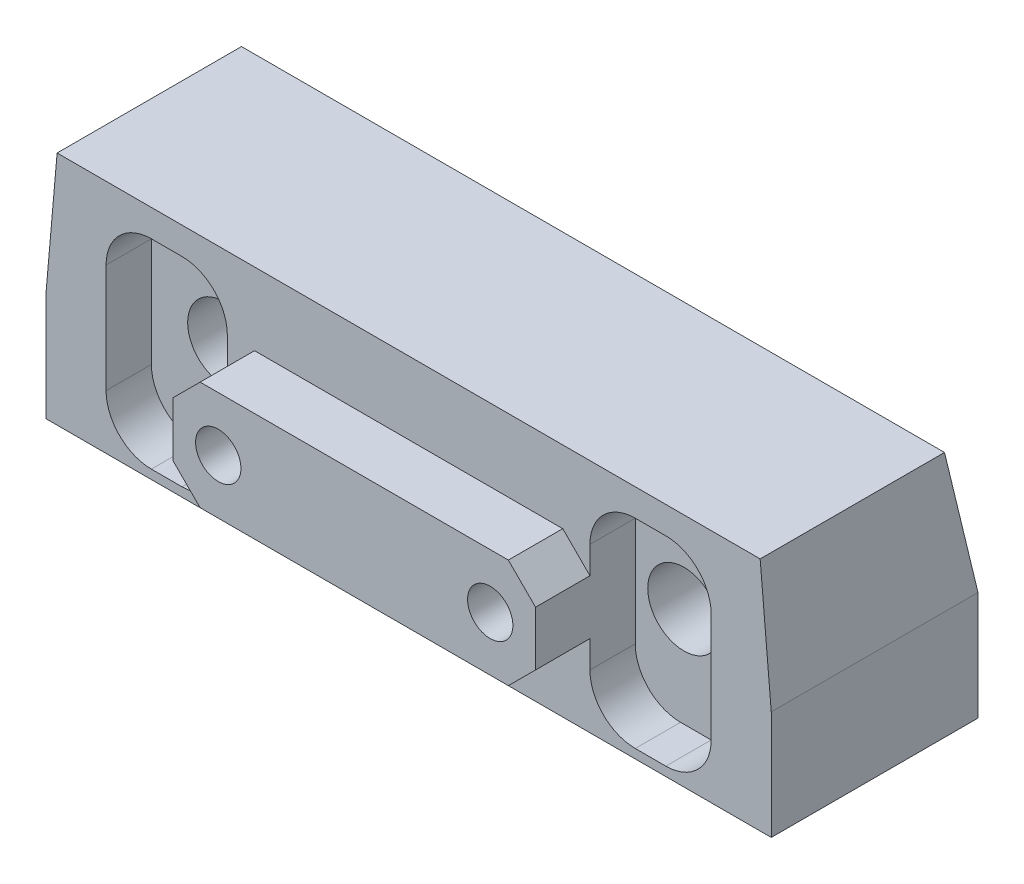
ISO-10303-21;
HEADER;
FILE_DESCRIPTION(('STEP AP214'),'2;1');
FILE_NAME('part.step','',(''),(''),'','','');
FILE_SCHEMA(('AUTOMOTIVE_DESIGN { 1 0 10303 214 1 1 1 1 }'));
ENDSEC;
DATA;
#1=APPLICATION_CONTEXT('core data for automotive mechanical design processes');
#2=APPLICATION_PROTOCOL_DEFINITION('international standard','automotive_design',2000,#1);
#3=PRODUCT_CONTEXT('',#1,'mechanical');
#4=PRODUCT('Part','Part','',(#3));
#5=PRODUCT_RELATED_PRODUCT_CATEGORY('part','',(#4));
#6=PRODUCT_DEFINITION_FORMATION('','',#4);
#7=PRODUCT_DEFINITION_CONTEXT('part definition',#1,'design');
#8=PRODUCT_DEFINITION('design','',#6,#7);
#9=PRODUCT_DEFINITION_SHAPE('','',#8);
#10=(LENGTH_UNIT() NAMED_UNIT(*) SI_UNIT(.MILLI.,.METRE.));
#11=(NAMED_UNIT(*) PLANE_ANGLE_UNIT() SI_UNIT($,.RADIAN.));
#12=(NAMED_UNIT(*) SI_UNIT($,.STERADIAN.) SOLID_ANGLE_UNIT());
#13=UNCERTAINTY_MEASURE_WITH_UNIT(LENGTH_MEASURE(1.E-05),#10,'distance_accuracy_value','');
#14=(GEOMETRIC_REPRESENTATION_CONTEXT(3) GLOBAL_UNCERTAINTY_ASSIGNED_CONTEXT((#13)) GLOBAL_UNIT_ASSIGNED_CONTEXT((#10,
#11,#12)) REPRESENTATION_CONTEXT('',''));
#15=CARTESIAN_POINT('',(0.,0.,0.));
#16=DIRECTION('',(0.,0.,1.));
#17=DIRECTION('',(1.,0.,0.));
#18=AXIS2_PLACEMENT_3D('',#15,#16,#17);
#19=CARTESIAN_POINT('',(12.06429,-4.5675,130.));
#20=DIRECTION('',(0.,0.,1.));
#21=DIRECTION('',(1.,0.,0.));
#22=AXIS2_PLACEMENT_3D('',#19,#20,#21);
#23=PLANE('',#22);
#24=DIRECTION('',(0.,1.,0.));
#25=VECTOR('',#24,1.);
#26=CARTESIAN_POINT('',(14.165711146,2.58178885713,130.));
#27=LINE('',#26,#25);
#28=CARTESIAN_POINT('',(14.165711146,-2.0818078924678,130.));
#29=VERTEX_POINT('',#28);
#30=CARTESIAN_POINT('',(14.165711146,2.08180789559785,130.));
#31=VERTEX_POINT('',#30);
#32=EDGE_CURVE('E504',#29,#31,#27,.T.);
#33=ORIENTED_EDGE('',*,*,#32,.F.);
#34=CARTESIAN_POINT('',(14.6657301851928,-2.08176981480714,130.));
#35=DIRECTION('',(0.,0.,1.));
#36=DIRECTION('',(-0.707106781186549,-0.707106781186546,0.));
#37=AXIS2_PLACEMENT_3D('',#34,#35,#36);
#38=ELLIPSE('',#37,0.500038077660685,0.5);
#39=CARTESIAN_POINT('',(14.6656921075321,-2.58178885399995,130.));
#40=VERTEX_POINT('',#39);
#41=EDGE_CURVE('E1272',#29,#40,#38,.T.);
#42=ORIENTED_EDGE('',*,*,#41,.T.);
#43=DIRECTION('',(-1.,0.,0.));
#44=VECTOR('',#43,1.);
#45=CARTESIAN_POINT('',(14.165711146,-2.58178885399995,130.));
#46=LINE('',#45,#44);
#47=CARTESIAN_POINT('',(19.1691832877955,-2.58178885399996,130.));
#48=VERTEX_POINT('',#47);
#49=EDGE_CURVE('E513',#48,#40,#46,.T.);
#50=ORIENTED_EDGE('',*,*,#49,.F.);
#51=CARTESIAN_POINT('',(19.4653293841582,-1.80301775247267,114.772613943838));
#52=CARTESIAN_POINT('',(19.6622922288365,-2.44883202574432,114.764656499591));
#53=CARTESIAN_POINT('',(18.9871104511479,-2.4489014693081,114.772613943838));
#54=CARTESIAN_POINT('',(19.489732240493,-1.81970296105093,116.889249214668));
#55=CARTESIAN_POINT('',(19.6899458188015,-2.46734968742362,116.886570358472));
#56=CARTESIAN_POINT('',(19.0120583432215,-2.46737306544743,116.889249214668));
#57=CARTESIAN_POINT('',(19.5142655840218,-1.8363733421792,119.005882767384));
#58=CARTESIAN_POINT('',(19.7177251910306,-2.48582205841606,119.003294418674));
#59=CARTESIAN_POINT('',(19.0371521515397,-2.48584464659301,119.005882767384));
#60=CARTESIAN_POINT('',(19.5636026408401,-1.86968367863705,123.239146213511));
#61=CARTESIAN_POINT('',(19.7736793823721,-2.52276434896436,123.236461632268));
#62=CARTESIAN_POINT('',(19.0876426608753,-2.5227877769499,123.239146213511));
#63=CARTESIAN_POINT('',(19.5884063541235,-1.88632363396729,125.355776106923));
#64=CARTESIAN_POINT('',(19.8018598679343,-2.54123662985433,125.353175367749));
#65=CARTESIAN_POINT('',(19.113039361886,-2.54125932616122,125.355776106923));
#66=CARTESIAN_POINT('',(19.6382935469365,-1.91957234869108,129.589032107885));
#67=CARTESIAN_POINT('',(19.8586334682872,-2.57817877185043,129.586325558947));
#68=CARTESIAN_POINT('',(19.1641467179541,-2.57820239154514,129.589032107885));
#69=CARTESIAN_POINT('',(19.6633770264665,-1.93618110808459,131.705658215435));
#70=CARTESIAN_POINT('',(19.8872326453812,-2.59665111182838,131.70304606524));
#71=CARTESIAN_POINT('',(19.189857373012,-2.59667390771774,131.705658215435));
#72=CARTESIAN_POINT('',(19.713834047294,-1.96936662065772,135.938906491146));
#73=CARTESIAN_POINT('',(19.944861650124,-2.63359308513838,135.936176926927));
#74=CARTESIAN_POINT('',(19.241604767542,-2.63361690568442,135.938906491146));
#75=CARTESIAN_POINT('',(19.7392075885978,-1.98594337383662,138.055528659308));
#76=CARTESIAN_POINT('',(19.9738979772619,-2.65206532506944,138.052885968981));
#77=CARTESIAN_POINT('',(19.2676415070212,-2.65208838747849,138.055528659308));
#78=CARTESIAN_POINT('',(19.7647313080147,-2.00250371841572,140.172148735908));
#79=CARTESIAN_POINT('',(20.0030755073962,-2.67048322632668,140.163368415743));
#80=CARTESIAN_POINT('',(19.2938473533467,-2.6705598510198,140.172148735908));
#81=(BOUNDED_SURFACE() B_SPLINE_SURFACE(3,2,((#51,#52,#53),(#54,#55,#56),(#57,#58,#59),(#60,#61,
#62),(#63,#64,#65),(#66,#67,#68),(#69,#70,#71),(#72,#73,#74),(#75,#76,#77),(#78,#79,#80)),
.UNSPECIFIED.,.F.,.F.,.F.) B_SPLINE_SURFACE_WITH_KNOTS((4,2,2,2,4),(3,3),(0.,6.35058864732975,
12.7011771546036,19.051765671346,25.4023543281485),(0.,1.),
.UNSPECIFIED.) GEOMETRIC_REPRESENTATION_ITEM() RATIONAL_B_SPLINE_SURFACE(((1.,0.595097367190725,
1.),(1.,0.593596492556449,1.),(1.,0.592077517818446,1.),(1.,0.58900181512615,1.),(1.,
0.587445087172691,1.),(1.,0.584292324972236,1.),(1.,0.582696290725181,1.),(1.,0.579463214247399,
1.),(1.,0.577826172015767,1.),(1.,0.576167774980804,1.))) REPRESENTATION_ITEM('') SURFACE());
#82=CARTESIAN_POINT('',(19.1691832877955,-2.58178885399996,130.));
#83=CARTESIAN_POINT('',(19.1973120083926,-2.58181273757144,130.));
#84=CARTESIAN_POINT('',(19.2254336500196,-2.57941685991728,130.));
#85=CARTESIAN_POINT('',(19.2808621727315,-2.56996120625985,130.));
#86=CARTESIAN_POINT('',(19.308169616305,-2.56290473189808,130.));
#87=CARTESIAN_POINT('',(19.3612234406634,-2.54429874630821,130.));
#88=CARTESIAN_POINT('',(19.386969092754,-2.53274715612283,130.));
#89=CARTESIAN_POINT('',(19.4361504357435,-2.5054892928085,130.));
#90=CARTESIAN_POINT('',(19.4595866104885,-2.4897838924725,130.));
#91=CARTESIAN_POINT('',(19.5034883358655,-2.45466183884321,130.));
#92=CARTESIAN_POINT('',(19.5239540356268,-2.43524537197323,130.));
#93=CARTESIAN_POINT('',(19.5613383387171,-2.39324883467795,130.));
#94=CARTESIAN_POINT('',(19.5782563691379,-2.37066825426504,130.));
#95=CARTESIAN_POINT('',(19.6080586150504,-2.3229905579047,130.));
#96=CARTESIAN_POINT('',(19.6209434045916,-2.29789380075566,130.));
#97=CARTESIAN_POINT('',(19.6423166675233,-2.24589245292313,130.));
#98=CARTESIAN_POINT('',(19.6508051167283,-2.21898785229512,130.));
#99=CARTESIAN_POINT('',(19.6631474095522,-2.16412997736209,130.));
#100=CARTESIAN_POINT('',(19.6669998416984,-2.13617638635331,130.));
#101=CARTESIAN_POINT('',(19.6699524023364,-2.0800250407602,130.));
#102=CARTESIAN_POINT('',(19.6690553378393,-2.05182744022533,130.));
#103=CARTESIAN_POINT('',(19.6637987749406,-2.00672014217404,130.));
#104=CARTESIAN_POINT('',(19.6608985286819,-1.98962731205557,130.));
#105=CARTESIAN_POINT('',(19.6533501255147,-1.95586140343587,130.));
#106=CARTESIAN_POINT('',(19.6487048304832,-1.93918768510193,130.));
#107=CARTESIAN_POINT('',(19.6432034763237,-1.92279272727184,130.));
#108=B_SPLINE_CURVE_WITH_KNOTS('',3,(#82,#83,#84,#85,#86,#87,#88,#89,#90,#91,#92,#93,#94,#95,
#96,#97,#98,#99,#100,#101,#102,#103,#104,#105,#106,#107),.UNSPECIFIED.,.F.,.F.,(4,2,2,2,2,2,2,2,
2,2,2,2,4),(0.,0.0842741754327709,0.168488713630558,0.25274224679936,0.336978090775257,
0.421209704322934,0.505454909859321,0.589688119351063,0.673921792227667,0.758181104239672,
0.842390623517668,0.894316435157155,0.946157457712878),.UNSPECIFIED.);
#109=CARTESIAN_POINT('',(19.6432034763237,-1.92279272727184,130.));
#110=VERTEX_POINT('',#109);
#111=EDGE_CURVE('E970',#48,#110,#108,.T.);
#112=ORIENTED_EDGE('',*,*,#111,.T.);
#113=CARTESIAN_POINT('',(25.375,0.,130.));
#114=DIRECTION('',(0.,0.,1.));
#115=DIRECTION('',(-1.,0.,0.));
#116=AXIS2_PLACEMENT_3D('',#113,#114,#115);
#117=CIRCLE('',#116,6.04571114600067);
#118=CARTESIAN_POINT('',(19.6432034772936,1.9227927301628,130.));
#119=VERTEX_POINT('',#118);
#120=EDGE_CURVE('E510',#119,#110,#117,.T.);
#121=ORIENTED_EDGE('',*,*,#120,.F.);
#122=CARTESIAN_POINT('',(18.987110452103,2.44890147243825,114.77261394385));
#123=CARTESIAN_POINT('',(19.6622922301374,2.4488320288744,114.764656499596));
#124=CARTESIAN_POINT('',(19.4653293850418,1.80301775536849,114.77261394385));
#125=CARTESIAN_POINT('',(19.0120583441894,2.46737306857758,116.88924921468));
#126=CARTESIAN_POINT('',(19.6899458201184,2.46734969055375,116.886570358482));
#127=CARTESIAN_POINT('',(19.4897322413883,1.81970296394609,116.88924921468));
#128=CARTESIAN_POINT('',(19.0371521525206,2.48584464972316,119.005882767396));
#129=CARTESIAN_POINT('',(19.7177251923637,2.48582206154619,119.003294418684));
#130=CARTESIAN_POINT('',(19.5142655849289,1.83637334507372,119.005882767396));
#131=CARTESIAN_POINT('',(19.0876426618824,2.52278778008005,123.239146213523));
#132=CARTESIAN_POINT('',(19.7736793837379,2.52276435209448,123.236461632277));
#133=CARTESIAN_POINT('',(19.5636026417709,1.86968368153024,123.239146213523));
#134=CARTESIAN_POINT('',(19.1130393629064,2.54125932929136,125.355776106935));
#135=CARTESIAN_POINT('',(19.8018598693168,2.54123663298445,125.353175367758));
#136=CARTESIAN_POINT('',(19.5884063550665,1.88632363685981,125.355776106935));
#137=CARTESIAN_POINT('',(19.1641467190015,2.57820239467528,129.589032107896));
#138=CARTESIAN_POINT('',(19.8586334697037,2.57817877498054,129.586325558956));
#139=CARTESIAN_POINT('',(19.638293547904,1.91957235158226,129.589032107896));
#140=CARTESIAN_POINT('',(19.1898573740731,2.59667391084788,131.705658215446));
#141=CARTESIAN_POINT('',(19.8872326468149,2.59665111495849,131.703046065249));
#142=CARTESIAN_POINT('',(19.6633770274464,1.9361811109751,131.705658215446));
#143=CARTESIAN_POINT('',(19.2416047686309,2.63361690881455,135.938906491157));
#144=CARTESIAN_POINT('',(19.9448616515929,2.63359308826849,135.936176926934));
#145=CARTESIAN_POINT('',(19.7138340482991,1.96936662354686,135.938906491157));
#146=CARTESIAN_POINT('',(19.2676415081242,2.65208839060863,138.055528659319));
#147=CARTESIAN_POINT('',(19.9738979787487,2.65206532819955,138.052885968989));
#148=CARTESIAN_POINT('',(19.7392075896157,1.98594337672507,138.055528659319));
#149=CARTESIAN_POINT('',(19.293847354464,2.67055985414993,140.172148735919));
#150=CARTESIAN_POINT('',(20.003075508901,2.67048322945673,140.163368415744));
#151=CARTESIAN_POINT('',(19.7647313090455,2.00250372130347,140.172148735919));
#152=(BOUNDED_SURFACE() B_SPLINE_SURFACE(3,2,((#122,#123,#124),(#125,#126,#127),(#128,#129,
#130),(#131,#132,#133),(#134,#135,#136),(#137,#138,#139),(#140,#141,#142),(#143,#144,#145),
(#146,#147,#148),(#149,#150,#151)),.UNSPECIFIED.,.F.,.F.,.F.) B_SPLINE_SURFACE_WITH_KNOTS((4,2,
2,2,4),(3,3),(0.,6.35058864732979,12.7011771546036,19.051765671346,25.4023543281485),(0.,1.),
.UNSPECIFIED.) GEOMETRIC_REPRESENTATION_ITEM() RATIONAL_B_SPLINE_SURFACE(((1.,0.595097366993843,
1.),(1.,0.593596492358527,1.),(1.,0.592077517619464,1.),(1.,0.589001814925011,1.),(1.,
0.587445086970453,1.),(1.,0.58429232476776,1.),(1.,0.582696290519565,1.),(1.,0.57946321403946,
1.),(1.,0.577826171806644,1.),(1.,0.576167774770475,1.))) REPRESENTATION_ITEM('') SURFACE());
#153=CARTESIAN_POINT('',(19.6432034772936,1.9227927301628,130.));
#154=CARTESIAN_POINT('',(19.6521722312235,1.9494533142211,130.));
#155=CARTESIAN_POINT('',(19.6588446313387,1.97687677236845,130.));
#156=CARTESIAN_POINT('',(19.6675085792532,2.03243454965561,130.));
#157=CARTESIAN_POINT('',(19.6695034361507,2.06056835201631,130.));
#158=CARTESIAN_POINT('',(19.6687369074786,2.11678492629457,130.));
#159=CARTESIAN_POINT('',(19.6659733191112,2.14486766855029,130.));
#160=CARTESIAN_POINT('',(19.655772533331,2.20016450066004,130.));
#161=CARTESIAN_POINT('',(19.6483363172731,2.22737877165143,130.));
#162=CARTESIAN_POINT('',(19.6290005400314,2.28017126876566,130.));
#163=CARTESIAN_POINT('',(19.6171012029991,2.30574957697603,130.));
#164=CARTESIAN_POINT('',(19.5891750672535,2.35454943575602,130.));
#165=CARTESIAN_POINT('',(19.5731476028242,2.37777060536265,130.));
#166=CARTESIAN_POINT('',(19.5374238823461,2.42118894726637,130.));
#167=CARTESIAN_POINT('',(19.5177281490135,2.44138654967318,130.));
#168=CARTESIAN_POINT('',(19.4752244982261,2.47818867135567,130.));
#169=CARTESIAN_POINT('',(19.452416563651,2.49479317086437,130.));
#170=CARTESIAN_POINT('',(19.4043324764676,2.52394174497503,130.));
#171=CARTESIAN_POINT('',(19.379055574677,2.53648458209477,130.));
#172=CARTESIAN_POINT('',(19.3267588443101,2.55714234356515,130.));
#173=CARTESIAN_POINT('',(19.2997400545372,2.56525988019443,130.));
#174=CARTESIAN_POINT('',(19.2553030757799,2.57462229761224,130.));
#175=CARTESIAN_POINT('',(19.2381753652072,2.57730889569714,130.));
#176=CARTESIAN_POINT('',(19.2037619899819,2.58089143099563,130.));
#177=CARTESIAN_POINT('',(19.1864766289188,2.58179028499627,130.));
#178=CARTESIAN_POINT('',(19.1691832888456,2.58178885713,130.));
#179=B_SPLINE_CURVE_WITH_KNOTS('',3,(#153,#154,#155,#156,#157,#158,#159,#160,#161,#162,#163,
#164,#165,#166,#167,#168,#169,#170,#171,#172,#173,#174,#175,#176,#177,#178),.UNSPECIFIED.,.F.,
.F.,(4,2,2,2,2,2,2,2,2,2,2,2,4),(0.,0.0842741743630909,0.168488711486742,0.25274224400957,
0.336978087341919,0.421209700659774,0.505454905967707,0.589688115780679,0.673921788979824,
0.758181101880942,0.842390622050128,0.894316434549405,0.946157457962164),.UNSPECIFIED.);
#180=CARTESIAN_POINT('',(19.1691832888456,2.58178885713,130.));
#181=VERTEX_POINT('',#180);
#182=EDGE_CURVE('E976',#119,#181,#179,.T.);
#183=ORIENTED_EDGE('',*,*,#182,.T.);
#184=DIRECTION('',(1.,0.,0.));
#185=VECTOR('',#184,1.);
#186=CARTESIAN_POINT('',(19.9082834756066,2.58178885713,130.));
#187=LINE('',#186,#185);
#188=CARTESIAN_POINT('',(14.6656921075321,2.58178885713,130.));
#189=VERTEX_POINT('',#188);
#190=EDGE_CURVE('E507',#189,#181,#187,.T.);
#191=ORIENTED_EDGE('',*,*,#190,.F.);
#192=CARTESIAN_POINT('',(14.6657301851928,2.08176981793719,130.));
#193=DIRECTION('',(0.,0.,1.));
#194=DIRECTION('',(-0.707106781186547,0.707106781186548,0.));
#195=AXIS2_PLACEMENT_3D('',#192,#193,#194);
#196=ELLIPSE('',#195,0.500038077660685,0.5);
#197=EDGE_CURVE('E977',#189,#31,#196,.T.);
#198=ORIENTED_EDGE('',*,*,#197,.T.);
#199=EDGE_LOOP('',(#33,#42,#50,#112,#121,#183,#191,#198));
#200=FACE_BOUND('',#199,.T.);
#201=DIRECTION('',(0.00872653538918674,0.999961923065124,0.));
#202=VECTOR('',#201,1.);
#203=CARTESIAN_POINT('',(31.451481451,-1.549072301,130.));
#204=LINE('',#203,#202);
#205=CARTESIAN_POINT('',(31.4650000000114,1.30848681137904E-09,130.));
#206=VERTEX_POINT('',#205);
#207=CARTESIAN_POINT('',(31.4514814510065,-1.54907230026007,130.));
#208=VERTEX_POINT('',#207);
#209=EDGE_CURVE('E1577',#206,#208,#204,.F.);
#210=ORIENTED_EDGE('',*,*,#209,.T.);
#211=CARTESIAN_POINT('',(28.4065973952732,-1.5225,130.));
#212=DIRECTION('',(0.,0.,1.));
#213=DIRECTION('',(1.,0.,0.));
#214=AXIS2_PLACEMENT_3D('',#211,#212,#213);
#215=CIRCLE('',#214,3.045);
#216=CARTESIAN_POINT('',(28.4065973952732,-4.5675,130.));
#217=VERTEX_POINT('',#216);
#218=EDGE_CURVE('E2326',#208,#217,#215,.F.);
#219=ORIENTED_EDGE('',*,*,#218,.T.);
#220=DIRECTION('',(1.,0.,0.));
#221=VECTOR('',#220,1.);
#222=CARTESIAN_POINT('',(28.406597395,-4.5675,130.));
#223=LINE('',#222,#221);
#224=CARTESIAN_POINT('',(12.7155155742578,-4.5675,130.));
#225=VERTEX_POINT('',#224);
#226=EDGE_CURVE('E737',#217,#225,#223,.F.);
#227=ORIENTED_EDGE('',*,*,#226,.T.);
#228=CARTESIAN_POINT('',(12.7155155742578,-4.0675,130.));
#229=DIRECTION('',(0.,0.,1.));
#230=DIRECTION('',(1.,0.,0.));
#231=AXIS2_PLACEMENT_3D('',#228,#229,#230);
#232=CIRCLE('',#231,0.5);
#233=CARTESIAN_POINT('',(12.2155346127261,-4.07186326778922,130.));
#234=VERTEX_POINT('',#233);
#235=EDGE_CURVE('E742',#225,#234,#232,.F.);
#236=ORIENTED_EDGE('',*,*,#235,.T.);
#237=DIRECTION('',(0.00872653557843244,-0.999961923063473,0.));
#238=VECTOR('',#237,1.);
#239=CARTESIAN_POINT('',(12.219859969,-4.5675,130.));
#240=LINE('',#239,#238);
#241=CARTESIAN_POINT('',(12.1800000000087,-9.98940224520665E-10,130.));
#242=VERTEX_POINT('',#241);
#243=EDGE_CURVE('E715',#234,#242,#240,.F.);
#244=ORIENTED_EDGE('',*,*,#243,.T.);
#245=DIRECTION('',(-0.00872653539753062,-0.999961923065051,0.));
#246=VECTOR('',#245,1.);
#247=CARTESIAN_POINT('',(12.2198599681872,4.56749999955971,130.));
#248=LINE('',#247,#246);
#249=CARTESIAN_POINT('',(12.2198599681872,4.56749999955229,129.999999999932));
#250=VERTEX_POINT('',#249);
#251=EDGE_CURVE('E648',#250,#242,#248,.T.);
#252=ORIENTED_EDGE('',*,*,#251,.F.);
#253=DIRECTION('',(1.,0.,0.));
#254=VECTOR('',#253,1.);
#255=CARTESIAN_POINT('',(-40.48,4.5674999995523,129.999999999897));
#256=LINE('',#255,#254);
#257=CARTESIAN_POINT('',(28.406597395,4.56749999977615,129.999999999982));
#258=VERTEX_POINT('',#257);
#259=EDGE_CURVE('E632',#250,#258,#256,.T.);
#260=ORIENTED_EDGE('',*,*,#259,.T.);
#261=CARTESIAN_POINT('',(28.406597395,1.5225,129.999999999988));
#262=DIRECTION('',(0.,0.,1.));
#263=DIRECTION('',(1.,0.,0.));
#264=AXIS2_PLACEMENT_3D('',#261,#262,#263);
#265=CIRCLE('',#264,3.045);
#266=CARTESIAN_POINT('',(31.4514814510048,1.54907230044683,129.999999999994));
#267=VERTEX_POINT('',#266);
#268=EDGE_CURVE('E644',#258,#267,#265,.F.);
#269=ORIENTED_EDGE('',*,*,#268,.T.);
#270=DIRECTION('',(-0.00872653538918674,0.999961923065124,0.));
#271=VECTOR('',#270,1.);
#272=CARTESIAN_POINT('',(31.451481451,1.549072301,130.));
#273=LINE('',#272,#271);
#274=EDGE_CURVE('E709',#267,#206,#273,.F.);
#275=ORIENTED_EDGE('',*,*,#274,.T.);
#276=EDGE_LOOP('',(#210,#219,#227,#236,#244,#252,#260,#269,#275));
#277=FACE_BOUND('',#276,.T.);
#278=CARTESIAN_POINT('',(25.375,0.,130.));
#279=DIRECTION('',(0.,0.,-1.));
#280=DIRECTION('',(-1.,0.,0.));
#281=AXIS2_PLACEMENT_3D('',#278,#279,#280);
#282=CIRCLE('',#281,4.00000000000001);
#283=CARTESIAN_POINT('',(21.375,0.,130.));
#284=VERTEX_POINT('',#283);
#285=EDGE_CURVE('E480',#284,#284,#282,.T.);
#286=ORIENTED_EDGE('',*,*,#285,.F.);
#287=EDGE_LOOP('',(#286));
#288=FACE_BOUND('',#287,.T.);
#289=ADVANCED_FACE('F42',(#200,#277,#288),#23,.F.);
#290=CARTESIAN_POINT('',(-31.58071,-4.5675,130.));
#291=DIRECTION('',(0.,0.,1.));
#292=DIRECTION('',(1.,0.,0.));
#293=AXIS2_PLACEMENT_3D('',#290,#291,#292);
#294=PLANE('',#293);
#295=CARTESIAN_POINT('',(-25.375,0.,130.));
#296=DIRECTION('',(0.,0.,-1.));
#297=DIRECTION('',(-1.,0.,0.));
#298=AXIS2_PLACEMENT_3D('',#295,#296,#297);
#299=CIRCLE('',#298,4.00000000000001);
#300=CARTESIAN_POINT('',(-29.375,0.,130.));
#301=VERTEX_POINT('',#300);
#302=EDGE_CURVE('E486',#301,#301,#299,.T.);
#303=ORIENTED_EDGE('',*,*,#302,.F.);
#304=EDGE_LOOP('',(#303));
#305=FACE_BOUND('',#304,.T.);
#306=DIRECTION('',(1.,0.,0.));
#307=VECTOR('',#306,1.);
#308=CARTESIAN_POINT('',(-12.219859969,-4.5675,130.));
#309=LINE('',#308,#307);
#310=CARTESIAN_POINT('',(-12.7155155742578,-4.5675,130.));
#311=VERTEX_POINT('',#310);
#312=CARTESIAN_POINT('',(-28.4065973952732,-4.5675,130.));
#313=VERTEX_POINT('',#312);
#314=EDGE_CURVE('E622',#311,#313,#309,.F.);
#315=ORIENTED_EDGE('',*,*,#314,.T.);
#316=CARTESIAN_POINT('',(-28.4065973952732,-1.5225,130.));
#317=DIRECTION('',(0.,0.,1.));
#318=DIRECTION('',(1.,0.,0.));
#319=AXIS2_PLACEMENT_3D('',#316,#317,#318);
#320=CIRCLE('',#319,3.045);
#321=CARTESIAN_POINT('',(-31.4514814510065,-1.54907230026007,130.));
#322=VERTEX_POINT('',#321);
#323=EDGE_CURVE('E609',#313,#322,#320,.F.);
#324=ORIENTED_EDGE('',*,*,#323,.T.);
#325=DIRECTION('',(0.00872653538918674,-0.999961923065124,0.));
#326=VECTOR('',#325,1.);
#327=CARTESIAN_POINT('',(-31.451481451,-1.549072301,130.));
#328=LINE('',#327,#326);
#329=CARTESIAN_POINT('',(-31.465,-2.76901450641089E-13,130.));
#330=VERTEX_POINT('',#329);
#331=EDGE_CURVE('E610',#322,#330,#328,.F.);
#332=ORIENTED_EDGE('',*,*,#331,.T.);
#333=DIRECTION('',(-0.00872653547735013,-0.999961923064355,0.));
#334=VECTOR('',#333,1.);
#335=CARTESIAN_POINT('',(-31.451481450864,1.54907230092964,130.));
#336=LINE('',#335,#334);
#337=CARTESIAN_POINT('',(-31.4514814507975,1.54907230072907,130.));
#338=VERTEX_POINT('',#337);
#339=EDGE_CURVE('E626',#338,#330,#336,.T.);
#340=ORIENTED_EDGE('',*,*,#339,.F.);
#341=CARTESIAN_POINT('',(-28.406597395,1.5225,130.));
#342=DIRECTION('',(0.,0.,1.));
#343=DIRECTION('',(1.,0.,0.));
#344=AXIS2_PLACEMENT_3D('',#341,#342,#343);
#345=CIRCLE('',#344,3.045);
#346=CARTESIAN_POINT('',(-28.406597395,4.5674999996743,129.999999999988));
#347=VERTEX_POINT('',#346);
#348=EDGE_CURVE('E639',#347,#338,#345,.T.);
#349=ORIENTED_EDGE('',*,*,#348,.F.);
#350=DIRECTION('',(1.,0.,0.));
#351=VECTOR('',#350,1.);
#352=CARTESIAN_POINT('',(-40.48,4.56749999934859,129.999999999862));
#353=LINE('',#352,#351);
#354=CARTESIAN_POINT('',(-12.2198599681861,4.56749999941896,129.999999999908));
#355=VERTEX_POINT('',#354);
#356=EDGE_CURVE('E637',#347,#355,#353,.T.);
#357=ORIENTED_EDGE('',*,*,#356,.T.);
#358=DIRECTION('',(-0.00872653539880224,0.99996192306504,0.));
#359=VECTOR('',#358,1.);
#360=CARTESIAN_POINT('',(-12.18,-1.33333274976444E-09,130.));
#361=LINE('',#360,#359);
#362=CARTESIAN_POINT('',(-12.1800000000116,7.52976148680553E-10,129.999999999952));
#363=VERTEX_POINT('',#362);
#364=EDGE_CURVE('E643',#363,#355,#361,.T.);
#365=ORIENTED_EDGE('',*,*,#364,.F.);
#366=DIRECTION('',(0.00872653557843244,0.999961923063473,0.));
#367=VECTOR('',#366,1.);
#368=CARTESIAN_POINT('',(-12.219859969,-4.5675,130.));
#369=LINE('',#368,#367);
#370=CARTESIAN_POINT('',(-12.2155346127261,-4.07186326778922,130.));
#371=VERTEX_POINT('',#370);
#372=EDGE_CURVE('E682',#363,#371,#369,.F.);
#373=ORIENTED_EDGE('',*,*,#372,.T.);
#374=CARTESIAN_POINT('',(-12.7155155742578,-4.0675,130.));
#375=DIRECTION('',(0.,0.,1.));
#376=DIRECTION('',(1.,0.,0.));
#377=AXIS2_PLACEMENT_3D('',#374,#375,#376);
#378=CIRCLE('',#377,0.5);
#379=EDGE_CURVE('E577',#371,#311,#378,.F.);
#380=ORIENTED_EDGE('',*,*,#379,.T.);
#381=EDGE_LOOP('',(#315,#324,#332,#340,#349,#357,#365,#373,#380));
#382=FACE_BOUND('',#381,.T.);
#383=DIRECTION('',(0.,-1.,0.));
#384=VECTOR('',#383,1.);
#385=CARTESIAN_POINT('',(-14.1657111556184,-2.581788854,130.));
#386=LINE('',#385,#384);
#387=CARTESIAN_POINT('',(-14.1657111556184,2.08180789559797,130.));
#388=VERTEX_POINT('',#387);
#389=CARTESIAN_POINT('',(-14.1657111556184,-2.08180789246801,130.));
#390=VERTEX_POINT('',#389);
#391=EDGE_CURVE('E492',#388,#390,#386,.T.);
#392=ORIENTED_EDGE('',*,*,#391,.F.);
#393=CARTESIAN_POINT('',(-14.6657301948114,2.081769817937,130.));
#394=DIRECTION('',(0.,0.,1.));
#395=DIRECTION('',(0.707106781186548,0.707106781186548,0.));
#396=AXIS2_PLACEMENT_3D('',#393,#394,#395);
#397=ELLIPSE('',#396,0.500038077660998,0.5);
#398=CARTESIAN_POINT('',(-14.6656921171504,2.58178885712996,130.));
#399=VERTEX_POINT('',#398);
#400=EDGE_CURVE('E1290',#388,#399,#397,.T.);
#401=ORIENTED_EDGE('',*,*,#400,.T.);
#402=DIRECTION('',(1.,0.,0.));
#403=VECTOR('',#402,1.);
#404=CARTESIAN_POINT('',(-14.1657111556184,2.58178885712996,130.));
#405=LINE('',#404,#403);
#406=CARTESIAN_POINT('',(-19.1691832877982,2.58178885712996,130.));
#407=VERTEX_POINT('',#406);
#408=EDGE_CURVE('E501',#407,#399,#405,.T.);
#409=ORIENTED_EDGE('',*,*,#408,.F.);
#410=CARTESIAN_POINT('',(-19.4653293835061,1.80301775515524,114.772613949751));
#411=CARTESIAN_POINT('',(-19.6622922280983,2.44883202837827,114.764656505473));
#412=CARTESIAN_POINT('',(-18.9871104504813,2.44890147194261,114.772613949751));
#413=CARTESIAN_POINT('',(-19.4897322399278,1.81970296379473,116.889249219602));
#414=CARTESIAN_POINT('',(-19.6899458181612,2.4673496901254,116.88657036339));
#415=CARTESIAN_POINT('',(-19.0120583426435,2.46737306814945,116.889249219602));
#416=CARTESIAN_POINT('',(-19.5142655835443,1.83637334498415,119.005882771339));
#417=CARTESIAN_POINT('',(-19.717725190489,2.48582206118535,119.003294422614));
#418=CARTESIAN_POINT('',(-19.0371521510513,2.48584464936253,119.005882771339));
#419=CARTESIAN_POINT('',(-19.56360264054,1.86968368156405,123.239146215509));
#420=CARTESIAN_POINT('',(-19.7736793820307,2.52276435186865,123.23646163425));
#421=CARTESIAN_POINT('',(-19.0876426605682,2.52278777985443,123.239146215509));
#422=CARTESIAN_POINT('',(-19.5884063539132,1.8863236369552,125.355776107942));
#423=CARTESIAN_POINT('',(-19.8018598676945,2.54123663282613,125.353175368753));
#424=CARTESIAN_POINT('',(-19.1130393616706,2.54125932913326,125.355776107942));
#425=CARTESIAN_POINT('',(-19.6382935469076,1.91957235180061,129.589032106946));
#426=CARTESIAN_POINT('',(-19.8586334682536,2.57817877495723,129.586325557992));
#427=CARTESIAN_POINT('',(-19.1641467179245,2.57820239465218,129.589032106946));
#428=CARTESIAN_POINT('',(-19.6633770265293,1.93618111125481,131.705658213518));
#429=CARTESIAN_POINT('',(-19.8872326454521,2.5966511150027,131.703046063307));
#430=CARTESIAN_POINT('',(-19.1898573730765,2.59667391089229,131.705658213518));
#431=CARTESIAN_POINT('',(-19.7138340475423,1.96936662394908,135.938906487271));
#432=CARTESIAN_POINT('',(-19.9448616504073,2.6335930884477,135.936176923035));
#433=CARTESIAN_POINT('',(-19.2416047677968,2.63361690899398,135.938906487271));
#434=CARTESIAN_POINT('',(-19.73920758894,1.98594337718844,138.055528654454));
#435=CARTESIAN_POINT('',(-19.9738979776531,2.65206532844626,138.052885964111));
#436=CARTESIAN_POINT('',(-19.2676415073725,2.65208839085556,138.055528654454));
#437=CARTESIAN_POINT('',(-19.7647313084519,2.00250372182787,140.172148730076));
#438=CARTESIAN_POINT('',(-20.0030755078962,2.6704832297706,140.163368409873));
#439=CARTESIAN_POINT('',(-19.2938473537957,2.67055985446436,140.172148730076));
#440=(BOUNDED_SURFACE() B_SPLINE_SURFACE(3,2,((#410,#411,#412),(#413,#414,#415),(#416,#417,
#418),(#419,#420,#421),(#422,#423,#424),(#425,#426,#427),(#428,#429,#430),(#431,#432,#433),
(#434,#435,#436),(#437,#438,#439)),.UNSPECIFIED.,.F.,.F.,.F.) B_SPLINE_SURFACE_WITH_KNOTS((4,2,
2,2,4),(3,3),(0.,6.35058864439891,12.7011771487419,19.0517656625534,25.402354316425),(0.,1.),
.UNSPECIFIED.) GEOMETRIC_REPRESENTATION_ITEM() RATIONAL_B_SPLINE_SURFACE(((1.,0.595097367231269,
1.),(1.,0.593596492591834,1.),(1.,0.592077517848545,1.),(1.,0.589001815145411,1.),(1.,
0.587445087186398,1.),(1.,0.584292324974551,1.),(1.,0.582696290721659,1.),(1.,0.579463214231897,
1.),(1.,0.577826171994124,1.),(1.,0.576167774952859,1.))) REPRESENTATION_ITEM('') SURFACE());
#441=CARTESIAN_POINT('',(-19.1691832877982,2.58178885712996,130.));
#442=CARTESIAN_POINT('',(-19.1973120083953,2.58181274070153,130.));
#443=CARTESIAN_POINT('',(-19.2254336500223,2.5794168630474,130.));
#444=CARTESIAN_POINT('',(-19.2808621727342,2.56996120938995,130.));
#445=CARTESIAN_POINT('',(-19.3081696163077,2.56290473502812,130.));
#446=CARTESIAN_POINT('',(-19.3612234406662,2.54429874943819,130.));
#447=CARTESIAN_POINT('',(-19.3869690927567,2.5327471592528,130.));
#448=CARTESIAN_POINT('',(-19.4361504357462,2.50548929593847,130.));
#449=CARTESIAN_POINT('',(-19.4595866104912,2.48978389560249,130.));
#450=CARTESIAN_POINT('',(-19.5034883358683,2.4546618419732,130.));
#451=CARTESIAN_POINT('',(-19.5239540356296,2.43524537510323,130.));
#452=CARTESIAN_POINT('',(-19.5613383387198,2.39324883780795,130.));
#453=CARTESIAN_POINT('',(-19.5782563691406,2.37066825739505,130.));
#454=CARTESIAN_POINT('',(-19.608058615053,2.32299056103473,130.));
#455=CARTESIAN_POINT('',(-19.6209434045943,2.29789380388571,130.));
#456=CARTESIAN_POINT('',(-19.6423166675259,2.24589245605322,130.));
#457=CARTESIAN_POINT('',(-19.6508051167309,2.21898785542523,130.));
#458=CARTESIAN_POINT('',(-19.6631474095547,2.16412998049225,130.));
#459=CARTESIAN_POINT('',(-19.6669998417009,2.1361763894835,130.));
#460=CARTESIAN_POINT('',(-19.6699524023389,2.08002504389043,130.));
#461=CARTESIAN_POINT('',(-19.6690553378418,2.05182744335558,130.));
#462=CARTESIAN_POINT('',(-19.6637987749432,2.00672014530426,130.));
#463=CARTESIAN_POINT('',(-19.6608985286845,1.98962731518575,130.));
#464=CARTESIAN_POINT('',(-19.6533501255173,1.95586140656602,130.));
#465=CARTESIAN_POINT('',(-19.6487048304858,1.93918768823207,130.));
#466=CARTESIAN_POINT('',(-19.6432034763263,1.92279273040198,130.));
#467=B_SPLINE_CURVE_WITH_KNOTS('',3,(#441,#442,#443,#444,#445,#446,#447,#448,#449,#450,#451,
#452,#453,#454,#455,#456,#457,#458,#459,#460,#461,#462,#463,#464,#465,#466),.UNSPECIFIED.,.F.,
.F.,(4,2,2,2,2,2,2,2,2,2,2,2,4),(0.,0.0842741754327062,0.168488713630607,0.252742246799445,
0.336978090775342,0.421209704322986,0.505454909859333,0.589688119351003,0.673921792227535,
0.758181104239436,0.8423906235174,0.894316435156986,0.946157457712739),.UNSPECIFIED.);
#468=CARTESIAN_POINT('',(-19.6432034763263,1.92279273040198,130.));
#469=VERTEX_POINT('',#468);
#470=EDGE_CURVE('E1293',#407,#469,#467,.T.);
#471=ORIENTED_EDGE('',*,*,#470,.T.);
#472=CARTESIAN_POINT('',(-25.375,3.13000847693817E-09,130.));
#473=DIRECTION('',(0.,0.,1.));
#474=DIRECTION('',(-1.,0.,0.));
#475=AXIS2_PLACEMENT_3D('',#472,#473,#474);
#476=CIRCLE('',#475,6.04571114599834);
#477=CARTESIAN_POINT('',(-19.6432034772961,-1.92279272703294,130.));
#478=VERTEX_POINT('',#477);
#479=EDGE_CURVE('E498',#478,#469,#476,.T.);
#480=ORIENTED_EDGE('',*,*,#479,.F.);
#481=CARTESIAN_POINT('',(-18.9871104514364,-2.44890146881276,114.772613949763));
#482=CARTESIAN_POINT('',(-19.6622922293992,-2.44883202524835,114.764656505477));
#483=CARTESIAN_POINT('',(-19.4653293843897,-1.80301775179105,114.772613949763));
#484=CARTESIAN_POINT('',(-19.0120583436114,-2.46737306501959,116.889249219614));
#485=CARTESIAN_POINT('',(-19.6899458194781,-2.46734968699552,116.8865703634));
#486=CARTESIAN_POINT('',(-19.489732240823,-1.81970296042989,116.889249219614));
#487=CARTESIAN_POINT('',(-19.0371521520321,-2.48584464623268,119.005882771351));
#488=CARTESIAN_POINT('',(-19.7177251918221,-2.48582205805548,119.003294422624));
#489=CARTESIAN_POINT('',(-19.5142655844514,-1.83637334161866,119.005882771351));
#490=CARTESIAN_POINT('',(-19.0876426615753,-2.52278777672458,123.239146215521));
#491=CARTESIAN_POINT('',(-19.7736793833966,-2.52276434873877,123.236461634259));
#492=CARTESIAN_POINT('',(-19.5636026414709,-1.86968367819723,123.239146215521));
#493=CARTESIAN_POINT('',(-19.113039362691,-2.5412593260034,125.355776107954));
#494=CARTESIAN_POINT('',(-19.801859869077,-2.54123662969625,125.353175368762));
#495=CARTESIAN_POINT('',(-19.5884063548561,-1.88632363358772,125.355776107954));
#496=CARTESIAN_POINT('',(-19.164146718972,-2.57820239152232,129.589032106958));
#497=CARTESIAN_POINT('',(-19.85863346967,-2.57817877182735,129.586325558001));
#498=CARTESIAN_POINT('',(-19.6382935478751,-1.91957234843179,129.589032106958));
#499=CARTESIAN_POINT('',(-19.1898573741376,-2.59667390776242,131.705658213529));
#500=CARTESIAN_POINT('',(-19.8872326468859,-2.59665111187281,131.703046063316));
#501=CARTESIAN_POINT('',(-19.6633770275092,-1.93618110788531,131.705658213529));
#502=CARTESIAN_POINT('',(-19.2416047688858,-2.63361690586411,135.938906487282));
#503=CARTESIAN_POINT('',(-19.9448616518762,-2.6335930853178,135.936176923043));
#504=CARTESIAN_POINT('',(-19.7138340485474,-1.96936662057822,135.938906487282));
#505=CARTESIAN_POINT('',(-19.2676415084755,-2.65208838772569,138.055528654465));
#506=CARTESIAN_POINT('',(-19.9738979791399,-2.65206532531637,138.052885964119));
#507=CARTESIAN_POINT('',(-19.7392075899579,-1.98594337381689,138.055528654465));
#508=CARTESIAN_POINT('',(-19.293847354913,-2.6705598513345,140.172148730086));
#509=CARTESIAN_POINT('',(-20.003075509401,-2.67048322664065,140.163368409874));
#510=CARTESIAN_POINT('',(-19.7647313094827,-2.00250371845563,140.172148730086));
#511=(BOUNDED_SURFACE() B_SPLINE_SURFACE(3,2,((#481,#482,#483),(#484,#485,#486),(#487,#488,
#489),(#490,#491,#492),(#493,#494,#495),(#496,#497,#498),(#499,#500,#501),(#502,#503,#504),
(#505,#506,#507),(#508,#509,#510)),.UNSPECIFIED.,.F.,.F.,.F.) B_SPLINE_SURFACE_WITH_KNOTS((4,2,
2,2,4),(3,3),(0.,6.3505886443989,12.7011771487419,19.0517656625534,25.402354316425),(0.,1.),
.UNSPECIFIED.) GEOMETRIC_REPRESENTATION_ITEM() RATIONAL_B_SPLINE_SURFACE(((1.,0.595097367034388,
1.),(1.,0.593596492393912,1.),(1.,0.592077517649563,1.),(1.,0.58900181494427,1.),(1.,
0.587445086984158,1.),(1.,0.584292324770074,1.),(1.,0.582696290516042,1.),(1.,0.579463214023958,
1.),(1.,0.577826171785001,1.),(1.,0.576167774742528,1.))) REPRESENTATION_ITEM('') SURFACE());
#512=CARTESIAN_POINT('',(-19.6432034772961,-1.92279272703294,130.));
#513=CARTESIAN_POINT('',(-19.6521722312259,-1.9494533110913,130.));
#514=CARTESIAN_POINT('',(-19.6588446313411,-1.97687676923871,130.));
#515=CARTESIAN_POINT('',(-19.6675085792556,-2.03243454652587,130.));
#516=CARTESIAN_POINT('',(-19.6695034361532,-2.06056834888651,130.));
#517=CARTESIAN_POINT('',(-19.6687369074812,-2.11678492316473,130.));
#518=CARTESIAN_POINT('',(-19.6659733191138,-2.14486766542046,130.));
#519=CARTESIAN_POINT('',(-19.6557725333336,-2.20016449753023,130.));
#520=CARTESIAN_POINT('',(-19.6483363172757,-2.22737876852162,130.));
#521=CARTESIAN_POINT('',(-19.629000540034,-2.28017126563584,130.));
#522=CARTESIAN_POINT('',(-19.6171012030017,-2.30574957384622,130.));
#523=CARTESIAN_POINT('',(-19.5891750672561,-2.35454943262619,130.));
#524=CARTESIAN_POINT('',(-19.5731476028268,-2.3777706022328,130.));
#525=CARTESIAN_POINT('',(-19.5374238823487,-2.42118894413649,130.));
#526=CARTESIAN_POINT('',(-19.5177281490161,-2.44138654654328,130.));
#527=CARTESIAN_POINT('',(-19.4752244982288,-2.47818866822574,130.));
#528=CARTESIAN_POINT('',(-19.4524165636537,-2.4947931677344,130.));
#529=CARTESIAN_POINT('',(-19.4043324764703,-2.52394174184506,130.));
#530=CARTESIAN_POINT('',(-19.3790555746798,-2.53648457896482,130.));
#531=CARTESIAN_POINT('',(-19.3267588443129,-2.55714234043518,130.));
#532=CARTESIAN_POINT('',(-19.2997400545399,-2.56525987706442,130.));
#533=CARTESIAN_POINT('',(-19.2553030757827,-2.57462229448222,130.));
#534=CARTESIAN_POINT('',(-19.23817536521,-2.57730889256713,130.));
#535=CARTESIAN_POINT('',(-19.2037619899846,-2.58089142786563,130.));
#536=CARTESIAN_POINT('',(-19.1864766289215,-2.58179028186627,130.));
#537=CARTESIAN_POINT('',(-19.1691832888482,-2.581788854,130.));
#538=B_SPLINE_CURVE_WITH_KNOTS('',3,(#512,#513,#514,#515,#516,#517,#518,#519,#520,#521,#522,
#523,#524,#525,#526,#527,#528,#529,#530,#531,#532,#533,#534,#535,#536,#537),.UNSPECIFIED.,.F.,
.F.,(4,2,2,2,2,2,2,2,2,2,2,2,4),(0.,0.0842741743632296,0.168488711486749,0.252742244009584,
0.336978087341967,0.421209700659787,0.505454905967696,0.589688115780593,0.673921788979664,
0.758181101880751,0.842390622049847,0.894316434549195,0.946157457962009),.UNSPECIFIED.);
#539=CARTESIAN_POINT('',(-19.1691832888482,-2.581788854,130.));
#540=VERTEX_POINT('',#539);
#541=EDGE_CURVE('E1299',#478,#540,#538,.T.);
#542=ORIENTED_EDGE('',*,*,#541,.T.);
#543=DIRECTION('',(-1.,0.,0.));
#544=VECTOR('',#543,1.);
#545=CARTESIAN_POINT('',(-19.9082834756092,-2.581788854,130.));
#546=LINE('',#545,#544);
#547=CARTESIAN_POINT('',(-14.6656921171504,-2.581788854,130.));
#548=VERTEX_POINT('',#547);
#549=EDGE_CURVE('E495',#548,#540,#546,.T.);
#550=ORIENTED_EDGE('',*,*,#549,.F.);
#551=CARTESIAN_POINT('',(-14.6657301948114,-2.08176981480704,130.));
#552=DIRECTION('',(0.,0.,1.));
#553=DIRECTION('',(0.707106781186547,-0.707106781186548,0.));
#554=AXIS2_PLACEMENT_3D('',#551,#552,#553);
#555=ELLIPSE('',#554,0.500038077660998,0.5);
#556=EDGE_CURVE('E1349',#548,#390,#555,.T.);
#557=ORIENTED_EDGE('',*,*,#556,.T.);
#558=EDGE_LOOP('',(#392,#401,#409,#471,#480,#542,#550,#557));
#559=FACE_BOUND('',#558,.T.);
#560=ADVANCED_FACE('F942',(#305,#382,#559),#294,.F.);
#561=CARTESIAN_POINT('',(-40.,-4.5675,152.));
#562=DIRECTION('',(0.,0.,-1.));
#563=DIRECTION('',(-1.,0.,0.));
#564=AXIS2_PLACEMENT_3D('',#561,#562,#563);
#565=PLANE('',#564);
#566=DIRECTION('',(0.,-1.,0.));
#567=VECTOR('',#566,1.);
#568=CARTESIAN_POINT('',(-40.,-4.5675,152.));
#569=LINE('',#568,#567);
#570=CARTESIAN_POINT('',(-40.,0.,152.));
#571=VERTEX_POINT('',#570);
#572=CARTESIAN_POINT('',(-39.9999999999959,-12.,152.));
#573=VERTEX_POINT('',#572);
#574=EDGE_CURVE('E1598',#571,#573,#569,.T.);
#575=ORIENTED_EDGE('',*,*,#574,.T.);
#576=DIRECTION('',(-1.,0.,0.));
#577=VECTOR('',#576,1.);
#578=CARTESIAN_POINT('',(-39.9999999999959,-12.,152.));
#579=LINE('',#578,#577);
#580=CARTESIAN_POINT('',(40.,-12.,152.));
#581=VERTEX_POINT('',#580);
#582=EDGE_CURVE('E603',#581,#573,#579,.T.);
#583=ORIENTED_EDGE('',*,*,#582,.F.);
#584=DIRECTION('',(0.,1.,0.));
#585=VECTOR('',#584,1.);
#586=CARTESIAN_POINT('',(40.0000000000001,-1.14491749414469E-12,152.));
#587=LINE('',#586,#585);
#588=CARTESIAN_POINT('',(40.0000000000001,-1.14491749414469E-12,152.));
#589=VERTEX_POINT('',#588);
#590=EDGE_CURVE('E597',#581,#589,#587,.T.);
#591=ORIENTED_EDGE('',*,*,#590,.T.);
#592=DIRECTION('',(-0.0871557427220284,0.996194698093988,0.));
#593=VECTOR('',#592,1.);
#594=CARTESIAN_POINT('',(38.775158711,14.,152.));
#595=LINE('',#594,#593);
#596=CARTESIAN_POINT('',(38.775158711,14.,152.));
#597=VERTEX_POINT('',#596);
#598=EDGE_CURVE('E2398',#589,#597,#595,.T.);
#599=ORIENTED_EDGE('',*,*,#598,.T.);
#600=DIRECTION('',(-1.,0.,0.));
#601=VECTOR('',#600,1.);
#602=CARTESIAN_POINT('',(-38.775158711,14.,152.));
#603=LINE('',#602,#601);
#604=CARTESIAN_POINT('',(-38.775158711,14.,152.));
#605=VERTEX_POINT('',#604);
#606=EDGE_CURVE('E1597',#597,#605,#603,.T.);
#607=ORIENTED_EDGE('',*,*,#606,.T.);
#608=DIRECTION('',(-0.0871557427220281,-0.996194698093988,0.));
#609=VECTOR('',#608,1.);
#610=CARTESIAN_POINT('',(-40.,0.,152.));
#611=LINE('',#610,#609);
#612=EDGE_CURVE('E1600',#605,#571,#611,.T.);
#613=ORIENTED_EDGE('',*,*,#612,.T.);
#614=EDGE_LOOP('',(#575,#583,#591,#599,#607,#613));
#615=FACE_BOUND('',#614,.T.);
#616=DIRECTION('',(1.,0.,0.));
#617=VECTOR('',#616,1.);
#618=CARTESIAN_POINT('',(20.,-11.,152.));
#619=LINE('',#618,#617);
#620=CARTESIAN_POINT('',(25.,-11.,152.));
#621=VERTEX_POINT('',#620);
#622=CARTESIAN_POINT('',(28.375,-11.,152.));
#623=VERTEX_POINT('',#622);
#624=EDGE_CURVE('E520',#621,#623,#619,.T.);
#625=ORIENTED_EDGE('',*,*,#624,.F.);
#626=CARTESIAN_POINT('',(25.,-6.00000000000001,152.));
#627=DIRECTION('',(0.,0.,-1.));
#628=DIRECTION('',(-1.,0.,0.));
#629=AXIS2_PLACEMENT_3D('',#626,#627,#628);
#630=CIRCLE('',#629,4.99999999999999);
#631=CARTESIAN_POINT('',(20.,-6.,152.));
#632=VERTEX_POINT('',#631);
#633=EDGE_CURVE('E13',#621,#632,#630,.T.);
#634=ORIENTED_EDGE('',*,*,#633,.T.);
#635=DIRECTION('',(0.,-1.,0.));
#636=VECTOR('',#635,1.);
#637=CARTESIAN_POINT('',(20.,11.,152.));
#638=LINE('',#637,#636);
#639=CARTESIAN_POINT('',(20.,-3.00000000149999,152.));
#640=VERTEX_POINT('',#639);
#641=EDGE_CURVE('E530',#640,#632,#638,.T.);
#642=ORIENTED_EDGE('',*,*,#641,.F.);
#643=DIRECTION('',(0.707106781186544,0.707106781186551,0.));
#644=VECTOR('',#643,1.);
#645=CARTESIAN_POINT('',(-10.7837499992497,-33.78375000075,152.));
#646=LINE('',#645,#644);
#647=CARTESIAN_POINT('',(17.0000000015,-6.,152.));
#648=VERTEX_POINT('',#647);
#649=EDGE_CURVE('E572',#640,#648,#646,.F.);
#650=ORIENTED_EDGE('',*,*,#649,.T.);
#651=DIRECTION('',(1.,0.,0.));
#652=VECTOR('',#651,1.);
#653=CARTESIAN_POINT('',(20.,-6.,152.));
#654=LINE('',#653,#652);
#655=CARTESIAN_POINT('',(-17.,-6.,152.));
#656=VERTEX_POINT('',#655);
#657=EDGE_CURVE('E526',#656,#648,#654,.T.);
#658=ORIENTED_EDGE('',*,*,#657,.F.);
#659=DIRECTION('',(0.707106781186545,-0.70710678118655,0.));
#660=VECTOR('',#659,1.);
#661=CARTESIAN_POINT('',(-29.2162499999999,6.21625,152.));
#662=LINE('',#661,#660);
#663=CARTESIAN_POINT('',(-20.,-3.,152.));
#664=VERTEX_POINT('',#663);
#665=EDGE_CURVE('E835',#656,#664,#662,.F.);
#666=ORIENTED_EDGE('',*,*,#665,.T.);
#667=DIRECTION('',(0.,1.,0.));
#668=VECTOR('',#667,1.);
#669=CARTESIAN_POINT('',(-20.,-11.,152.));
#670=LINE('',#669,#668);
#671=CARTESIAN_POINT('',(-20.,-6.00000000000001,152.));
#672=VERTEX_POINT('',#671);
#673=EDGE_CURVE('E804',#672,#664,#670,.T.);
#674=ORIENTED_EDGE('',*,*,#673,.F.);
#675=CARTESIAN_POINT('',(-25.,-6.00000000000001,152.));
#676=DIRECTION('',(0.,0.,-1.));
#677=DIRECTION('',(-1.,0.,0.));
#678=AXIS2_PLACEMENT_3D('',#675,#676,#677);
#679=CIRCLE('',#678,4.99999999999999);
#680=CARTESIAN_POINT('',(-25.,-11.,152.));
#681=VERTEX_POINT('',#680);
#682=EDGE_CURVE('E891',#672,#681,#679,.T.);
#683=ORIENTED_EDGE('',*,*,#682,.T.);
#684=DIRECTION('',(1.,0.,0.));
#685=VECTOR('',#684,1.);
#686=CARTESIAN_POINT('',(-33.375,-11.,152.));
#687=LINE('',#686,#685);
#688=CARTESIAN_POINT('',(-28.375,-11.,152.));
#689=VERTEX_POINT('',#688);
#690=EDGE_CURVE('E812',#689,#681,#687,.T.);
#691=ORIENTED_EDGE('',*,*,#690,.F.);
#692=CARTESIAN_POINT('',(-28.375,-6.,152.));
#693=DIRECTION('',(0.,0.,-1.));
#694=DIRECTION('',(-1.,0.,0.));
#695=AXIS2_PLACEMENT_3D('',#692,#693,#694);
#696=CIRCLE('',#695,5.);
#697=CARTESIAN_POINT('',(-33.375,-6.,152.));
#698=VERTEX_POINT('',#697);
#699=EDGE_CURVE('E920',#689,#698,#696,.T.);
#700=ORIENTED_EDGE('',*,*,#699,.T.);
#701=DIRECTION('',(0.,-1.,0.));
#702=VECTOR('',#701,1.);
#703=CARTESIAN_POINT('',(-33.375,11.,152.));
#704=LINE('',#703,#702);
#705=CARTESIAN_POINT('',(-33.375,6.,152.));
#706=VERTEX_POINT('',#705);
#707=EDGE_CURVE('E1093',#706,#698,#704,.T.);
#708=ORIENTED_EDGE('',*,*,#707,.F.);
#709=CARTESIAN_POINT('',(-28.375,6.,152.));
#710=DIRECTION('',(0.,0.,-1.));
#711=DIRECTION('',(-1.,0.,0.));
#712=AXIS2_PLACEMENT_3D('',#709,#710,#711);
#713=CIRCLE('',#712,5.);
#714=CARTESIAN_POINT('',(-28.375,11.,152.));
#715=VERTEX_POINT('',#714);
#716=EDGE_CURVE('E911',#706,#715,#713,.T.);
#717=ORIENTED_EDGE('',*,*,#716,.T.);
#718=DIRECTION('',(-1.,0.,0.));
#719=VECTOR('',#718,1.);
#720=CARTESIAN_POINT('',(-20.,11.,152.));
#721=LINE('',#720,#719);
#722=CARTESIAN_POINT('',(-25.,11.,152.));
#723=VERTEX_POINT('',#722);
#724=EDGE_CURVE('E544',#723,#715,#721,.T.);
#725=ORIENTED_EDGE('',*,*,#724,.F.);
#726=CARTESIAN_POINT('',(-25.,6.,152.));
#727=DIRECTION('',(0.,0.,-1.));
#728=DIRECTION('',(-1.,0.,0.));
#729=AXIS2_PLACEMENT_3D('',#726,#727,#728);
#730=CIRCLE('',#729,5.);
#731=CARTESIAN_POINT('',(-20.,6.,152.));
#732=VERTEX_POINT('',#731);
#733=EDGE_CURVE('E779',#723,#732,#730,.T.);
#734=ORIENTED_EDGE('',*,*,#733,.T.);
#735=CARTESIAN_POINT('',(-20.,3.00000000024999,152.));
#736=VERTEX_POINT('',#735);
#737=EDGE_CURVE('E807',#736,#732,#670,.T.);
#738=ORIENTED_EDGE('',*,*,#737,.F.);
#739=DIRECTION('',(-0.707106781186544,-0.707106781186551,0.));
#740=VECTOR('',#739,1.);
#741=CARTESIAN_POINT('',(-33.7837500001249,-10.783749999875,152.));
#742=LINE('',#741,#740);
#743=CARTESIAN_POINT('',(-17.00000000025,6.,152.));
#744=VERTEX_POINT('',#743);
#745=EDGE_CURVE('E552',#736,#744,#742,.F.);
#746=ORIENTED_EDGE('',*,*,#745,.T.);
#747=DIRECTION('',(-1.,0.,0.));
#748=VECTOR('',#747,1.);
#749=CARTESIAN_POINT('',(-20.,6.,152.));
#750=LINE('',#749,#748);
#751=CARTESIAN_POINT('',(17.00000000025,6.,152.));
#752=VERTEX_POINT('',#751);
#753=EDGE_CURVE('E537',#752,#744,#750,.T.);
#754=ORIENTED_EDGE('',*,*,#753,.F.);
#755=DIRECTION('',(-0.707106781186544,0.707106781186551,0.));
#756=VECTOR('',#755,1.);
#757=CARTESIAN_POINT('',(-6.21624999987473,29.216250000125,152.));
#758=LINE('',#757,#756);
#759=CARTESIAN_POINT('',(20.,3.00000000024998,152.));
#760=VERTEX_POINT('',#759);
#761=EDGE_CURVE('E562',#752,#760,#758,.F.);
#762=ORIENTED_EDGE('',*,*,#761,.T.);
#763=CARTESIAN_POINT('',(20.,6.,152.));
#764=VERTEX_POINT('',#763);
#765=EDGE_CURVE('E531',#764,#760,#638,.T.);
#766=ORIENTED_EDGE('',*,*,#765,.F.);
#767=CARTESIAN_POINT('',(25.,6.,152.));
#768=DIRECTION('',(0.,0.,-1.));
#769=DIRECTION('',(-1.,0.,0.));
#770=AXIS2_PLACEMENT_3D('',#767,#768,#769);
#771=CIRCLE('',#770,5.);
#772=CARTESIAN_POINT('',(25.,11.,152.));
#773=VERTEX_POINT('',#772);
#774=EDGE_CURVE('E789',#764,#773,#771,.T.);
#775=ORIENTED_EDGE('',*,*,#774,.T.);
#776=DIRECTION('',(-1.,0.,0.));
#777=VECTOR('',#776,1.);
#778=CARTESIAN_POINT('',(33.375,11.,152.));
#779=LINE('',#778,#777);
#780=CARTESIAN_POINT('',(28.375,11.,152.));
#781=VERTEX_POINT('',#780);
#782=EDGE_CURVE('E528',#781,#773,#779,.T.);
#783=ORIENTED_EDGE('',*,*,#782,.F.);
#784=CARTESIAN_POINT('',(28.375,6.,152.));
#785=DIRECTION('',(0.,0.,-1.));
#786=DIRECTION('',(-1.,0.,0.));
#787=AXIS2_PLACEMENT_3D('',#784,#785,#786);
#788=CIRCLE('',#787,5.);
#789=CARTESIAN_POINT('',(33.375,6.,152.));
#790=VERTEX_POINT('',#789);
#791=EDGE_CURVE('E800',#781,#790,#788,.T.);
#792=ORIENTED_EDGE('',*,*,#791,.T.);
#793=DIRECTION('',(0.,1.,0.));
#794=VECTOR('',#793,1.);
#795=CARTESIAN_POINT('',(33.375,-11.,152.));
#796=LINE('',#795,#794);
#797=CARTESIAN_POINT('',(33.375,-6.,152.));
#798=VERTEX_POINT('',#797);
#799=EDGE_CURVE('E516',#798,#790,#796,.T.);
#800=ORIENTED_EDGE('',*,*,#799,.F.);
#801=CARTESIAN_POINT('',(28.375,-6.,152.));
#802=DIRECTION('',(0.,0.,-1.));
#803=DIRECTION('',(-1.,0.,0.));
#804=AXIS2_PLACEMENT_3D('',#801,#802,#803);
#805=CIRCLE('',#804,5.);
#806=EDGE_CURVE('E902',#798,#623,#805,.T.);
#807=ORIENTED_EDGE('',*,*,#806,.T.);
#808=EDGE_LOOP('',(#625,#634,#642,#650,#658,#666,#674,#683,#691,#700,#708,#717,#725,#734,#738,
#746,#754,#762,#766,#775,#783,#792,#800,#807));
#809=FACE_BOUND('',#808,.T.);
#810=ADVANCED_FACE('F851',(#615,#809),#565,.F.);
#811=CARTESIAN_POINT('',(-31.465,0.,129.189794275));
#812=DIRECTION('',(-0.999961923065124,0.00872653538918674,0.));
#813=DIRECTION('',(-0.00872653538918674,-0.999961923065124,0.));
#814=AXIS2_PLACEMENT_3D('',#811,#812,#813);
#815=PLANE('',#814);
#816=DIRECTION('',(0.,0.,1.));
#817=VECTOR('',#816,1.);
#818=CARTESIAN_POINT('',(-31.465,-1.77592315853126E-13,129.194626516));
#819=LINE('',#818,#817);
#820=CARTESIAN_POINT('',(-31.4650000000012,1.38140949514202E-09,129.194626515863));
#821=VERTEX_POINT('',#820);
#822=EDGE_CURVE('E615',#330,#821,#819,.F.);
#823=ORIENTED_EDGE('',*,*,#822,.T.);
#824=DIRECTION('',(0.00859396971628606,0.98477138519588,0.173641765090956));
#825=VECTOR('',#824,1.);
#826=CARTESIAN_POINT('',(-31.465,1.95433079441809E-09,129.194626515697));
#827=LINE('',#826,#825);
#828=CARTESIAN_POINT('',(-31.4514814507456,1.54907230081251,129.467769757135));
#829=VERTEX_POINT('',#828);
#830=EDGE_CURVE('E638',#821,#829,#827,.T.);
#831=ORIENTED_EDGE('',*,*,#830,.T.);
#832=DIRECTION('',(0.,0.,1.));
#833=VECTOR('',#832,1.);
#834=CARTESIAN_POINT('',(-31.4514814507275,1.54907230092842,129.464576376));
#835=LINE('',#834,#833);
#836=EDGE_CURVE('E729',#829,#338,#835,.T.);
#837=ORIENTED_EDGE('',*,*,#836,.T.);
#838=ORIENTED_EDGE('',*,*,#339,.T.);
#839=EDGE_LOOP('',(#823,#831,#837,#838));
#840=FACE_BOUND('',#839,.T.);
#841=ADVANCED_FACE('F1643',(#840),#815,.F.);
#842=CARTESIAN_POINT('',(-28.406597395,1.5225,129.464576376));
#843=DIRECTION('',(0.,0.,1.));
#844=DIRECTION('',(1.,0.,0.));
#845=AXIS2_PLACEMENT_3D('',#842,#843,#844);
#846=CYLINDRICAL_SURFACE('',#845,3.045);
#847=CARTESIAN_POINT('',(-28.406597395,1.5225,129.463084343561));
#848=DIRECTION('',(0.,-0.17364817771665,0.984807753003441));
#849=DIRECTION('',(0.,0.984807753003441,0.17364817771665));
#850=AXIS2_PLACEMENT_3D('',#847,#848,#849);
#851=ELLIPSE('',#850,3.09197403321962,3.045);
#852=EDGE_CURVE('E633',#829,#347,#851,.F.);
#853=ORIENTED_EDGE('',*,*,#852,.T.);
#854=ORIENTED_EDGE('',*,*,#348,.T.);
#855=ORIENTED_EDGE('',*,*,#836,.F.);
#856=EDGE_LOOP('',(#853,#854,#855));
#857=FACE_BOUND('',#856,.T.);
#858=ADVANCED_FACE('F1637',(#857),#846,.F.);
#859=CARTESIAN_POINT('',(-12.18,-4.E-09,130.));
#860=DIRECTION('',(0.999961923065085,0.00872653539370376,0.));
#861=DIRECTION('',(-0.00872653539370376,0.999961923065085,0.));
#862=AXIS2_PLACEMENT_3D('',#859,#860,#861);
#863=PLANE('',#862);
#864=DIRECTION('',(0.00859396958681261,-0.984771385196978,-0.17364176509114));
#865=VECTOR('',#864,1.);
#866=CARTESIAN_POINT('',(-12.2198599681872,4.56749999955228,129.999999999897));
#867=LINE('',#866,#865);
#868=CARTESIAN_POINT('',(-12.1800000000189,1.01439683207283E-09,129.194626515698));
#869=VERTEX_POINT('',#868);
#870=EDGE_CURVE('E1547',#355,#869,#867,.T.);
#871=ORIENTED_EDGE('',*,*,#870,.T.);
#872=DIRECTION('',(0.,0.,1.));
#873=VECTOR('',#872,1.);
#874=CARTESIAN_POINT('',(-12.1800000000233,-1.33353595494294E-09,130.));
#875=LINE('',#874,#873);
#876=EDGE_CURVE('E724',#363,#869,#875,.F.);
#877=ORIENTED_EDGE('',*,*,#876,.F.);
#878=ORIENTED_EDGE('',*,*,#364,.T.);
#879=EDGE_LOOP('',(#871,#877,#878));
#880=FACE_BOUND('',#879,.T.);
#881=ADVANCED_FACE('F1635',(#880),#863,.F.);
#882=CARTESIAN_POINT('',(12.18,-4.E-09,129.189794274));
#883=DIRECTION('',(-0.999961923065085,0.00872653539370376,0.));
#884=DIRECTION('',(-0.00872653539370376,-0.999961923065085,0.));
#885=AXIS2_PLACEMENT_3D('',#882,#883,#884);
#886=PLANE('',#885);
#887=DIRECTION('',(0.00859396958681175,0.984771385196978,0.173641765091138));
#888=VECTOR('',#887,1.);
#889=CARTESIAN_POINT('',(12.1800000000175,1.79775291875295E-09,129.19462651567));
#890=LINE('',#889,#888);
#891=CARTESIAN_POINT('',(12.1800000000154,1.11185380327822E-09,129.194626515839));
#892=VERTEX_POINT('',#891);
#893=EDGE_CURVE('E1542',#892,#250,#890,.T.);
#894=ORIENTED_EDGE('',*,*,#893,.T.);
#895=ORIENTED_EDGE('',*,*,#251,.T.);
#896=DIRECTION('',(0.,0.,1.));
#897=VECTOR('',#896,1.);
#898=CARTESIAN_POINT('',(12.1800000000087,-9.99081026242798E-10,129.194626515));
#899=LINE('',#898,#897);
#900=EDGE_CURVE('E741',#242,#892,#899,.F.);
#901=ORIENTED_EDGE('',*,*,#900,.T.);
#902=EDGE_LOOP('',(#894,#895,#901));
#903=FACE_BOUND('',#902,.T.);
#904=ADVANCED_FACE('F957',(#903),#886,.F.);
#905=CARTESIAN_POINT('',(28.406597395,1.5225,129.464576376));
#906=DIRECTION('',(0.,0.,1.));
#907=DIRECTION('',(1.,0.,0.));
#908=AXIS2_PLACEMENT_3D('',#905,#906,#907);
#909=CYLINDRICAL_SURFACE('',#908,3.045);
#910=CARTESIAN_POINT('',(28.406597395,1.5225,129.463084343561));
#911=DIRECTION('',(0.,-0.17364817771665,0.984807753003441));
#912=DIRECTION('',(0.,0.984807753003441,0.17364817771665));
#913=AXIS2_PLACEMENT_3D('',#910,#911,#912);
#914=ELLIPSE('',#913,3.09197403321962,3.045);
#915=CARTESIAN_POINT('',(31.4514814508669,1.54907230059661,129.467769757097));
#916=VERTEX_POINT('',#915);
#917=EDGE_CURVE('E627',#258,#916,#914,.F.);
#918=ORIENTED_EDGE('',*,*,#917,.T.);
#919=DIRECTION('',(0.,0.,1.));
#920=VECTOR('',#919,1.);
#921=CARTESIAN_POINT('',(31.4514814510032,1.5490723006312,130.));
#922=LINE('',#921,#920);
#923=EDGE_CURVE('E647',#916,#267,#922,.T.);
#924=ORIENTED_EDGE('',*,*,#923,.T.);
#925=ORIENTED_EDGE('',*,*,#268,.F.);
#926=EDGE_LOOP('',(#918,#924,#925));
#927=FACE_BOUND('',#926,.T.);
#928=ADVANCED_FACE('F955',(#927),#909,.F.);
#929=CARTESIAN_POINT('',(31.451481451,1.549072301,130.));
#930=DIRECTION('',(0.999961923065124,0.00872653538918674,0.));
#931=DIRECTION('',(-0.00872653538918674,0.999961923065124,0.));
#932=AXIS2_PLACEMENT_3D('',#929,#930,#931);
#933=PLANE('',#932);
#934=ORIENTED_EDGE('',*,*,#923,.F.);
#935=DIRECTION('',(0.00859396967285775,-0.984771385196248,-0.173641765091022));
#936=VECTOR('',#935,1.);
#937=CARTESIAN_POINT('',(31.4514814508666,1.54907230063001,129.467769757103));
#938=LINE('',#937,#936);
#939=CARTESIAN_POINT('',(31.464999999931,-6.43656780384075E-09,129.194626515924));
#940=VERTEX_POINT('',#939);
#941=EDGE_CURVE('E631',#916,#940,#938,.T.);
#942=ORIENTED_EDGE('',*,*,#941,.T.);
#943=DIRECTION('',(0.,0.,1.));
#944=VECTOR('',#943,1.);
#945=CARTESIAN_POINT('',(31.4650000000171,1.96273054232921E-09,130.));
#946=LINE('',#945,#944);
#947=EDGE_CURVE('E614',#940,#206,#946,.T.);
#948=ORIENTED_EDGE('',*,*,#947,.T.);
#949=ORIENTED_EDGE('',*,*,#274,.F.);
#950=EDGE_LOOP('',(#934,#942,#948,#949));
#951=FACE_BOUND('',#950,.T.);
#952=ADVANCED_FACE('F1447',(#951),#933,.F.);
#953=CARTESIAN_POINT('',(-40.,0.,129.057794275));
#954=DIRECTION('',(0.996194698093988,-0.0871557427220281,0.));
#955=DIRECTION('',(0.0871557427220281,0.996194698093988,0.));
#956=AXIS2_PLACEMENT_3D('',#953,#954,#955);
#957=PLANE('',#956);
#958=DIRECTION('',(0.,0.,-1.));
#959=VECTOR('',#958,1.);
#960=CARTESIAN_POINT('',(-40.,1.59633764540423E-09,152.));
#961=LINE('',#960,#959);
#962=CARTESIAN_POINT('',(-39.999999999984,1.78934124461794E-09,129.194626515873));
#963=VERTEX_POINT('',#962);
#964=EDGE_CURVE('E666',#963,#571,#961,.F.);
#965=ORIENTED_EDGE('',*,*,#964,.T.);
#966=ORIENTED_EDGE('',*,*,#612,.F.);
#967=DIRECTION('',(0.,0.,-1.));
#968=VECTOR('',#967,1.);
#969=CARTESIAN_POINT('',(-38.775158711,14.,152.));
#970=LINE('',#969,#968);
#971=CARTESIAN_POINT('',(-38.775158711,14.,131.663204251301));
#972=VERTEX_POINT('',#971);
#973=EDGE_CURVE('E655',#605,#972,#970,.T.);
#974=ORIENTED_EDGE('',*,*,#973,.T.);
#975=DIRECTION('',(-0.0858414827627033,-0.981172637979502,-0.173007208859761));
#976=VECTOR('',#975,1.);
#977=CARTESIAN_POINT('',(-38.7751587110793,14.,131.663204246));
#978=LINE('',#977,#976);
#979=EDGE_CURVE('E685',#972,#963,#978,.T.);
#980=ORIENTED_EDGE('',*,*,#979,.T.);
#981=EDGE_LOOP('',(#965,#966,#974,#980));
#982=FACE_BOUND('',#981,.T.);
#983=ADVANCED_FACE('F1445',(#982),#957,.F.);
#984=CARTESIAN_POINT('',(40.,0.,129.057794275));
#985=DIRECTION('',(0.996194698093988,0.0871557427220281,0.));
#986=DIRECTION('',(-0.0871557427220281,0.996194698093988,0.));
#987=AXIS2_PLACEMENT_3D('',#984,#985,#986);
#988=PLANE('',#987);
#989=DIRECTION('',(-0.0858414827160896,0.981172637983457,0.17300720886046));
#990=VECTOR('',#989,1.);
#991=CARTESIAN_POINT('',(40.0000000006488,-1.36613602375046E-08,129.194626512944));
#992=LINE('',#991,#990);
#993=CARTESIAN_POINT('',(40.0000000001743,-1.46773951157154E-08,129.194626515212));
#994=VERTEX_POINT('',#993);
#995=CARTESIAN_POINT('',(38.775158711,14.,131.663204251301));
#996=VERTEX_POINT('',#995);
#997=EDGE_CURVE('E699',#994,#996,#992,.T.);
#998=ORIENTED_EDGE('',*,*,#997,.T.);
#999=DIRECTION('',(0.,0.,-1.));
#1000=VECTOR('',#999,1.);
#1001=CARTESIAN_POINT('',(38.775158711,14.,152.));
#1002=LINE('',#1001,#1000);
#1003=EDGE_CURVE('E734',#597,#996,#1002,.T.);
#1004=ORIENTED_EDGE('',*,*,#1003,.F.);
#1005=ORIENTED_EDGE('',*,*,#598,.F.);
#1006=DIRECTION('',(0.,0.,-1.));
#1007=VECTOR('',#1006,1.);
#1008=CARTESIAN_POINT('',(40.,-1.48316671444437E-08,152.));
#1009=LINE('',#1008,#1007);
#1010=EDGE_CURVE('E662',#994,#589,#1009,.F.);
#1011=ORIENTED_EDGE('',*,*,#1010,.F.);
#1012=EDGE_LOOP('',(#998,#1004,#1005,#1011));
#1013=FACE_BOUND('',#1012,.T.);
#1014=ADVANCED_FACE('F1518',(#1013),#988,.T.);
#1015=CARTESIAN_POINT('',(-31.451481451,-1.549072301,129.194626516));
#1016=DIRECTION('',(-0.999961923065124,-0.00872653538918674,0.));
#1017=DIRECTION('',(0.00872653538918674,-0.999961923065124,0.));
#1018=AXIS2_PLACEMENT_3D('',#1015,#1016,#1017);
#1019=PLANE('',#1018);
#1020=ORIENTED_EDGE('',*,*,#331,.F.);
#1021=DIRECTION('',(0.,0.,1.));
#1022=VECTOR('',#1021,1.);
#1023=CARTESIAN_POINT('',(-31.4514814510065,-1.54907230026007,129.194626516));
#1024=LINE('',#1023,#1022);
#1025=CARTESIAN_POINT('',(-31.4514814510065,-1.54907230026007,129.194626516));
#1026=VERTEX_POINT('',#1025);
#1027=EDGE_CURVE('E767',#322,#1026,#1024,.F.);
#1028=ORIENTED_EDGE('',*,*,#1027,.T.);
#1029=DIRECTION('',(-0.00872653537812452,0.999961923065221,0.));
#1030=VECTOR('',#1029,1.);
#1031=CARTESIAN_POINT('',(-31.4514814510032,-1.54907230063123,129.194626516));
#1032=LINE('',#1031,#1030);
#1033=EDGE_CURVE('E665',#1026,#821,#1032,.T.);
#1034=ORIENTED_EDGE('',*,*,#1033,.T.);
#1035=ORIENTED_EDGE('',*,*,#822,.F.);
#1036=EDGE_LOOP('',(#1020,#1028,#1034,#1035));
#1037=FACE_BOUND('',#1036,.T.);
#1038=ADVANCED_FACE('F1996',(#1037),#1019,.F.);
#1039=CARTESIAN_POINT('',(31.451481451,-1.549072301,130.));
#1040=DIRECTION('',(0.999961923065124,-0.00872653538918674,0.));
#1041=DIRECTION('',(0.00872653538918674,0.999961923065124,0.));
#1042=AXIS2_PLACEMENT_3D('',#1039,#1040,#1041);
#1043=PLANE('',#1042);
#1044=DIRECTION('',(-0.0087265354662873,-0.999961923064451,0.));
#1045=VECTOR('',#1044,1.);
#1046=CARTESIAN_POINT('',(31.465,1.9628795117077E-09,129.194626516));
#1047=LINE('',#1046,#1045);
#1048=CARTESIAN_POINT('',(31.4514814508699,-1.54907230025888,129.194626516));
#1049=VERTEX_POINT('',#1048);
#1050=EDGE_CURVE('E750',#940,#1049,#1047,.T.);
#1051=ORIENTED_EDGE('',*,*,#1050,.T.);
#1052=DIRECTION('',(0.,0.,1.));
#1053=VECTOR('',#1052,1.);
#1054=CARTESIAN_POINT('',(31.4514814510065,-1.54907230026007,130.));
#1055=LINE('',#1054,#1053);
#1056=EDGE_CURVE('E1040',#1049,#208,#1055,.T.);
#1057=ORIENTED_EDGE('',*,*,#1056,.T.);
#1058=ORIENTED_EDGE('',*,*,#209,.F.);
#1059=ORIENTED_EDGE('',*,*,#947,.F.);
#1060=EDGE_LOOP('',(#1051,#1057,#1058,#1059));
#1061=FACE_BOUND('',#1060,.T.);
#1062=ADVANCED_FACE('F1722',(#1061),#1043,.F.);
#1063=CARTESIAN_POINT('',(12.219859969,-4.5675,129.194626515));
#1064=DIRECTION('',(-0.999961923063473,-0.00872653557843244,0.));
#1065=DIRECTION('',(0.00872653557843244,-0.999961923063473,0.));
#1066=AXIS2_PLACEMENT_3D('',#1063,#1064,#1065);
#1067=PLANE('',#1066);
#1068=ORIENTED_EDGE('',*,*,#243,.F.);
#1069=DIRECTION('',(0.,0.,1.));
#1070=VECTOR('',#1069,1.);
#1071=CARTESIAN_POINT('',(12.2155346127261,-4.07186326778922,129.194626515));
#1072=LINE('',#1071,#1070);
#1073=CARTESIAN_POINT('',(12.2155346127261,-4.07186326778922,129.194626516));
#1074=VERTEX_POINT('',#1073);
#1075=EDGE_CURVE('E744',#234,#1074,#1072,.F.);
#1076=ORIENTED_EDGE('',*,*,#1075,.T.);
#1077=DIRECTION('',(-0.00872653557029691,0.999961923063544,0.));
#1078=VECTOR('',#1077,1.);
#1079=CARTESIAN_POINT('',(12.2155346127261,-4.07186326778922,129.194626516));
#1080=LINE('',#1079,#1078);
#1081=EDGE_CURVE('E745',#1074,#892,#1080,.T.);
#1082=ORIENTED_EDGE('',*,*,#1081,.T.);
#1083=ORIENTED_EDGE('',*,*,#900,.F.);
#1084=EDGE_LOOP('',(#1068,#1076,#1082,#1083));
#1085=FACE_BOUND('',#1084,.T.);
#1086=ADVANCED_FACE('F1718',(#1085),#1067,.F.);
#1087=CARTESIAN_POINT('',(-40.48,14.,131.663204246));
#1088=DIRECTION('',(0.,-0.17364817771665,0.984807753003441));
#1089=DIRECTION('',(0.,-0.984807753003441,-0.17364817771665));
#1090=AXIS2_PLACEMENT_3D('',#1087,#1088,#1089);
#1091=PLANE('',#1090);
#1092=DIRECTION('',(1.,0.,0.));
#1093=VECTOR('',#1092,1.);
#1094=CARTESIAN_POINT('',(-40.,-1.48316671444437E-08,129.194626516));
#1095=LINE('',#1094,#1093);
#1096=EDGE_CURVE('E653',#994,#940,#1095,.F.);
#1097=ORIENTED_EDGE('',*,*,#1096,.T.);
#1098=ORIENTED_EDGE('',*,*,#941,.F.);
#1099=ORIENTED_EDGE('',*,*,#917,.F.);
#1100=ORIENTED_EDGE('',*,*,#259,.F.);
#1101=ORIENTED_EDGE('',*,*,#893,.F.);
#1102=DIRECTION('',(1.,0.,0.));
#1103=VECTOR('',#1102,1.);
#1104=CARTESIAN_POINT('',(-40.,1.79666004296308E-09,129.194626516));
#1105=LINE('',#1104,#1103);
#1106=EDGE_CURVE('E749',#892,#869,#1105,.F.);
#1107=ORIENTED_EDGE('',*,*,#1106,.T.);
#1108=ORIENTED_EDGE('',*,*,#870,.F.);
#1109=ORIENTED_EDGE('',*,*,#356,.F.);
#1110=ORIENTED_EDGE('',*,*,#852,.F.);
#1111=ORIENTED_EDGE('',*,*,#830,.F.);
#1112=DIRECTION('',(1.,0.,0.));
#1113=VECTOR('',#1112,1.);
#1114=CARTESIAN_POINT('',(-40.,1.96287777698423E-09,129.194626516));
#1115=LINE('',#1114,#1113);
#1116=EDGE_CURVE('E674',#821,#963,#1115,.F.);
#1117=ORIENTED_EDGE('',*,*,#1116,.T.);
#1118=ORIENTED_EDGE('',*,*,#979,.F.);
#1119=DIRECTION('',(1.,0.,0.));
#1120=VECTOR('',#1119,1.);
#1121=CARTESIAN_POINT('',(-40.48,14.0000000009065,131.66320424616));
#1122=LINE('',#1121,#1120);
#1123=EDGE_CURVE('E689',#996,#972,#1122,.F.);
#1124=ORIENTED_EDGE('',*,*,#1123,.F.);
#1125=ORIENTED_EDGE('',*,*,#997,.F.);
#1126=EDGE_LOOP('',(#1097,#1098,#1099,#1100,#1101,#1107,#1108,#1109,#1110,#1111,#1117,#1118,
#1124,#1125));
#1127=FACE_BOUND('',#1126,.T.);
#1128=ADVANCED_FACE('F1529',(#1127),#1091,.F.);
#1129=CARTESIAN_POINT('',(-12.219859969,-4.5675,130.));
#1130=DIRECTION('',(0.999961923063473,-0.00872653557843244,0.));
#1131=DIRECTION('',(0.00872653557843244,0.999961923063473,0.));
#1132=AXIS2_PLACEMENT_3D('',#1129,#1130,#1131);
#1133=PLANE('',#1132);
#1134=DIRECTION('',(-0.00872653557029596,-0.999961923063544,0.));
#1135=VECTOR('',#1134,1.);
#1136=CARTESIAN_POINT('',(-12.1800000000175,1.79670861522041E-09,129.194626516));
#1137=LINE('',#1136,#1135);
#1138=CARTESIAN_POINT('',(-12.2155346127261,-4.07186326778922,129.194626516));
#1139=VERTEX_POINT('',#1138);
#1140=EDGE_CURVE('E830',#869,#1139,#1137,.T.);
#1141=ORIENTED_EDGE('',*,*,#1140,.T.);
#1142=DIRECTION('',(0.,0.,1.));
#1143=VECTOR('',#1142,1.);
#1144=CARTESIAN_POINT('',(-12.2155346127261,-4.07186326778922,130.));
#1145=LINE('',#1144,#1143);
#1146=EDGE_CURVE('E574',#1139,#371,#1145,.T.);
#1147=ORIENTED_EDGE('',*,*,#1146,.T.);
#1148=ORIENTED_EDGE('',*,*,#372,.F.);
#1149=ORIENTED_EDGE('',*,*,#876,.T.);
#1150=EDGE_LOOP('',(#1141,#1147,#1148,#1149));
#1151=FACE_BOUND('',#1150,.T.);
#1152=ADVANCED_FACE('F1630',(#1151),#1133,.F.);
#1153=CARTESIAN_POINT('',(-40.,-12.,152.));
#1154=DIRECTION('',(1.,0.,0.));
#1155=DIRECTION('',(0.,0.,-1.));
#1156=AXIS2_PLACEMENT_3D('',#1153,#1154,#1155);
#1157=PLANE('',#1156);
#1158=DIRECTION('',(0.,1.,0.));
#1159=VECTOR('',#1158,1.);
#1160=CARTESIAN_POINT('',(-39.9999999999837,-12.,129.194626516));
#1161=LINE('',#1160,#1159);
#1162=CARTESIAN_POINT('',(-39.9999999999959,-12.,129.194626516));
#1163=VERTEX_POINT('',#1162);
#1164=EDGE_CURVE('E654',#963,#1163,#1161,.F.);
#1165=ORIENTED_EDGE('',*,*,#1164,.T.);
#1166=DIRECTION('',(0.,0.,-1.));
#1167=VECTOR('',#1166,1.);
#1168=CARTESIAN_POINT('',(-39.9999999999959,-12.,129.194626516));
#1169=LINE('',#1168,#1167);
#1170=EDGE_CURVE('E2396',#573,#1163,#1169,.T.);
#1171=ORIENTED_EDGE('',*,*,#1170,.F.);
#1172=ORIENTED_EDGE('',*,*,#574,.F.);
#1173=ORIENTED_EDGE('',*,*,#964,.F.);
#1174=EDGE_LOOP('',(#1165,#1171,#1172,#1173));
#1175=FACE_BOUND('',#1174,.T.);
#1176=ADVANCED_FACE('F1702',(#1175),#1157,.F.);
#1177=CARTESIAN_POINT('',(40.,-12.,152.));
#1178=DIRECTION('',(1.,0.,0.));
#1179=DIRECTION('',(0.,0.,-1.));
#1180=AXIS2_PLACEMENT_3D('',#1177,#1178,#1179);
#1181=PLANE('',#1180);
#1182=ORIENTED_EDGE('',*,*,#1010,.T.);
#1183=ORIENTED_EDGE('',*,*,#590,.F.);
#1184=DIRECTION('',(0.,0.,1.));
#1185=VECTOR('',#1184,1.);
#1186=CARTESIAN_POINT('',(40.,-12.,152.));
#1187=LINE('',#1186,#1185);
#1188=CARTESIAN_POINT('',(40.,-12.,129.194626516));
#1189=VERTEX_POINT('',#1188);
#1190=EDGE_CURVE('E595',#1189,#581,#1187,.T.);
#1191=ORIENTED_EDGE('',*,*,#1190,.F.);
#1192=DIRECTION('',(0.,1.,0.));
#1193=VECTOR('',#1192,1.);
#1194=CARTESIAN_POINT('',(40.,-12.,129.194626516));
#1195=LINE('',#1194,#1193);
#1196=EDGE_CURVE('E649',#1189,#994,#1195,.T.);
#1197=ORIENTED_EDGE('',*,*,#1196,.T.);
#1198=EDGE_LOOP('',(#1182,#1183,#1191,#1197));
#1199=FACE_BOUND('',#1198,.T.);
#1200=ADVANCED_FACE('F2047',(#1199),#1181,.T.);
#1201=CARTESIAN_POINT('',(-40.,-12.,129.194626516));
#1202=DIRECTION('',(0.,0.,1.));
#1203=DIRECTION('',(1.,0.,0.));
#1204=AXIS2_PLACEMENT_3D('',#1201,#1202,#1203);
#1205=PLANE('',#1204);
#1206=ORIENTED_EDGE('',*,*,#1033,.F.);
#1207=CARTESIAN_POINT('',(-28.4065973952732,-1.5225,129.194626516));
#1208=DIRECTION('',(0.,0.,1.));
#1209=DIRECTION('',(1.,0.,0.));
#1210=AXIS2_PLACEMENT_3D('',#1207,#1208,#1209);
#1211=CIRCLE('',#1210,3.045);
#1212=CARTESIAN_POINT('',(-28.4065973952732,-4.5675,129.194626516));
#1213=VERTEX_POINT('',#1212);
#1214=EDGE_CURVE('E769',#1026,#1213,#1211,.T.);
#1215=ORIENTED_EDGE('',*,*,#1214,.T.);
#1216=DIRECTION('',(1.,0.,0.));
#1217=VECTOR('',#1216,1.);
#1218=CARTESIAN_POINT('',(40.,-4.5675,129.194626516));
#1219=LINE('',#1218,#1217);
#1220=CARTESIAN_POINT('',(-12.7155155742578,-4.5675,129.194626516));
#1221=VERTEX_POINT('',#1220);
#1222=EDGE_CURVE('E589',#1213,#1221,#1219,.T.);
#1223=ORIENTED_EDGE('',*,*,#1222,.T.);
#1224=CARTESIAN_POINT('',(-12.7155155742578,-4.0675,129.194626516));
#1225=DIRECTION('',(0.,0.,1.));
#1226=DIRECTION('',(1.,0.,0.));
#1227=AXIS2_PLACEMENT_3D('',#1224,#1225,#1226);
#1228=CIRCLE('',#1227,0.5);
#1229=EDGE_CURVE('E582',#1221,#1139,#1228,.T.);
#1230=ORIENTED_EDGE('',*,*,#1229,.T.);
#1231=ORIENTED_EDGE('',*,*,#1140,.F.);
#1232=ORIENTED_EDGE('',*,*,#1106,.F.);
#1233=ORIENTED_EDGE('',*,*,#1081,.F.);
#1234=CARTESIAN_POINT('',(12.7155155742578,-4.0675,129.194626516));
#1235=DIRECTION('',(0.,0.,1.));
#1236=DIRECTION('',(1.,0.,0.));
#1237=AXIS2_PLACEMENT_3D('',#1234,#1235,#1236);
#1238=CIRCLE('',#1237,0.5);
#1239=CARTESIAN_POINT('',(12.7155155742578,-4.5675,129.194626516));
#1240=VERTEX_POINT('',#1239);
#1241=EDGE_CURVE('E2334',#1074,#1240,#1238,.T.);
#1242=ORIENTED_EDGE('',*,*,#1241,.T.);
#1243=CARTESIAN_POINT('',(28.4065973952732,-4.5675,129.194626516));
#1244=VERTEX_POINT('',#1243);
#1245=EDGE_CURVE('E585',#1240,#1244,#1219,.T.);
#1246=ORIENTED_EDGE('',*,*,#1245,.T.);
#1247=CARTESIAN_POINT('',(28.4065973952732,-1.5225,129.194626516));
#1248=DIRECTION('',(0.,0.,1.));
#1249=DIRECTION('',(1.,0.,0.));
#1250=AXIS2_PLACEMENT_3D('',#1247,#1248,#1249);
#1251=CIRCLE('',#1250,3.045);
#1252=EDGE_CURVE('E604',#1244,#1049,#1251,.T.);
#1253=ORIENTED_EDGE('',*,*,#1252,.T.);
#1254=ORIENTED_EDGE('',*,*,#1050,.F.);
#1255=ORIENTED_EDGE('',*,*,#1096,.F.);
#1256=ORIENTED_EDGE('',*,*,#1196,.F.);
#1257=DIRECTION('',(1.,0.,0.));
#1258=VECTOR('',#1257,1.);
#1259=CARTESIAN_POINT('',(40.,-12.,129.194626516));
#1260=LINE('',#1259,#1258);
#1261=EDGE_CURVE('E2391',#1163,#1189,#1260,.T.);
#1262=ORIENTED_EDGE('',*,*,#1261,.F.);
#1263=ORIENTED_EDGE('',*,*,#1164,.F.);
#1264=ORIENTED_EDGE('',*,*,#1116,.F.);
#1265=EDGE_LOOP('',(#1206,#1215,#1223,#1230,#1231,#1232,#1233,#1242,#1246,#1253,#1254,#1255,
#1256,#1262,#1263,#1264));
#1266=FACE_BOUND('',#1265,.T.);
#1267=ADVANCED_FACE('F1624',(#1266),#1205,.F.);
#1268=CARTESIAN_POINT('',(-38.775158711,14.,152.));
#1269=DIRECTION('',(0.,-1.,0.));
#1270=DIRECTION('',(1.,0.,0.));
#1271=AXIS2_PLACEMENT_3D('',#1268,#1269,#1270);
#1272=PLANE('',#1271);
#1273=ORIENTED_EDGE('',*,*,#1123,.T.);
#1274=ORIENTED_EDGE('',*,*,#973,.F.);
#1275=ORIENTED_EDGE('',*,*,#606,.F.);
#1276=ORIENTED_EDGE('',*,*,#1003,.T.);
#1277=EDGE_LOOP('',(#1273,#1274,#1275,#1276));
#1278=FACE_BOUND('',#1277,.T.);
#1279=ADVANCED_FACE('F1595',(#1278),#1272,.F.);
#1280=CARTESIAN_POINT('',(40.,-4.5675,152.));
#1281=DIRECTION('',(0.,1.,0.));
#1282=DIRECTION('',(0.,0.,1.));
#1283=AXIS2_PLACEMENT_3D('',#1280,#1281,#1282);
#1284=PLANE('',#1283);
#1285=ORIENTED_EDGE('',*,*,#1222,.F.);
#1286=DIRECTION('',(0.,0.,1.));
#1287=VECTOR('',#1286,1.);
#1288=CARTESIAN_POINT('',(-28.4065973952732,-4.5675,152.));
#1289=LINE('',#1288,#1287);
#1290=EDGE_CURVE('E606',#1213,#313,#1289,.T.);
#1291=ORIENTED_EDGE('',*,*,#1290,.T.);
#1292=ORIENTED_EDGE('',*,*,#314,.F.);
#1293=DIRECTION('',(0.,0.,1.));
#1294=VECTOR('',#1293,1.);
#1295=CARTESIAN_POINT('',(-12.7155155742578,-4.5675,152.));
#1296=LINE('',#1295,#1294);
#1297=EDGE_CURVE('E579',#311,#1221,#1296,.F.);
#1298=ORIENTED_EDGE('',*,*,#1297,.T.);
#1299=EDGE_LOOP('',(#1285,#1291,#1292,#1298));
#1300=FACE_BOUND('',#1299,.T.);
#1301=ADVANCED_FACE('F2013',(#1300),#1284,.T.);
#1302=CARTESIAN_POINT('',(40.,-12.,152.));
#1303=DIRECTION('',(0.,1.,0.));
#1304=DIRECTION('',(0.,0.,1.));
#1305=AXIS2_PLACEMENT_3D('',#1302,#1303,#1304);
#1306=PLANE('',#1305);
#1307=ORIENTED_EDGE('',*,*,#582,.T.);
#1308=ORIENTED_EDGE('',*,*,#1170,.T.);
#1309=ORIENTED_EDGE('',*,*,#1261,.T.);
#1310=ORIENTED_EDGE('',*,*,#1190,.T.);
#1311=EDGE_LOOP('',(#1307,#1308,#1309,#1310));
#1312=FACE_BOUND('',#1311,.T.);
#1313=ADVANCED_FACE('F2010',(#1312),#1306,.F.);
#1314=ORIENTED_EDGE('',*,*,#226,.F.);
#1315=DIRECTION('',(0.,0.,1.));
#1316=VECTOR('',#1315,1.);
#1317=CARTESIAN_POINT('',(28.4065973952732,-4.5675,152.));
#1318=LINE('',#1317,#1316);
#1319=EDGE_CURVE('E2332',#217,#1244,#1318,.F.);
#1320=ORIENTED_EDGE('',*,*,#1319,.T.);
#1321=ORIENTED_EDGE('',*,*,#1245,.F.);
#1322=DIRECTION('',(0.,0.,1.));
#1323=VECTOR('',#1322,1.);
#1324=CARTESIAN_POINT('',(12.7155155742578,-4.5675,152.));
#1325=LINE('',#1324,#1323);
#1326=EDGE_CURVE('E584',#1240,#225,#1325,.T.);
#1327=ORIENTED_EDGE('',*,*,#1326,.T.);
#1328=EDGE_LOOP('',(#1314,#1320,#1321,#1327));
#1329=FACE_BOUND('',#1328,.T.);
#1330=ADVANCED_FACE('F2005',(#1329),#1284,.T.);
#1331=CARTESIAN_POINT('',(-20.,11.,147.));
#1332=DIRECTION('',(0.,1.,0.));
#1333=DIRECTION('',(0.,0.,1.));
#1334=AXIS2_PLACEMENT_3D('',#1331,#1332,#1333);
#1335=PLANE('',#1334);
#1336=ORIENTED_EDGE('',*,*,#724,.T.);
#1337=DIRECTION('',(0.,0.,1.));
#1338=VECTOR('',#1337,1.);
#1339=CARTESIAN_POINT('',(-28.375,11.,147.));
#1340=LINE('',#1339,#1338);
#1341=CARTESIAN_POINT('',(-28.375,11.,147.));
#1342=VERTEX_POINT('',#1341);
#1343=EDGE_CURVE('E907',#715,#1342,#1340,.F.);
#1344=ORIENTED_EDGE('',*,*,#1343,.T.);
#1345=DIRECTION('',(-1.,0.,0.));
#1346=VECTOR('',#1345,1.);
#1347=CARTESIAN_POINT('',(-20.,11.,147.));
#1348=LINE('',#1347,#1346);
#1349=CARTESIAN_POINT('',(-25.,11.,147.));
#1350=VERTEX_POINT('',#1349);
#1351=EDGE_CURVE('E547',#1350,#1342,#1348,.T.);
#1352=ORIENTED_EDGE('',*,*,#1351,.F.);
#1353=DIRECTION('',(0.,0.,1.));
#1354=VECTOR('',#1353,1.);
#1355=CARTESIAN_POINT('',(-25.,11.,152.));
#1356=LINE('',#1355,#1354);
#1357=EDGE_CURVE('E771',#1350,#723,#1356,.T.);
#1358=ORIENTED_EDGE('',*,*,#1357,.T.);
#1359=EDGE_LOOP('',(#1336,#1344,#1352,#1358));
#1360=FACE_BOUND('',#1359,.T.);
#1361=ADVANCED_FACE('F1113',(#1360),#1335,.F.);
#1362=CARTESIAN_POINT('',(-20.,-11.,147.));
#1363=DIRECTION('',(1.,0.,0.));
#1364=DIRECTION('',(0.,0.,-1.));
#1365=AXIS2_PLACEMENT_3D('',#1362,#1363,#1364);
#1366=PLANE('',#1365);
#1367=DIRECTION('',(0.,1.,0.));
#1368=VECTOR('',#1367,1.);
#1369=CARTESIAN_POINT('',(-20.,-11.,147.));
#1370=LINE('',#1369,#1368);
#1371=CARTESIAN_POINT('',(-20.,-6.00000000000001,147.));
#1372=VERTEX_POINT('',#1371);
#1373=CARTESIAN_POINT('',(-20.,6.,147.));
#1374=VERTEX_POINT('',#1373);
#1375=EDGE_CURVE('E590',#1372,#1374,#1370,.T.);
#1376=ORIENTED_EDGE('',*,*,#1375,.F.);
#1377=DIRECTION('',(0.,0.,1.));
#1378=VECTOR('',#1377,1.);
#1379=CARTESIAN_POINT('',(-20.,-6.00000000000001,152.));
#1380=LINE('',#1379,#1378);
#1381=EDGE_CURVE('E803',#1372,#672,#1380,.T.);
#1382=ORIENTED_EDGE('',*,*,#1381,.T.);
#1383=ORIENTED_EDGE('',*,*,#673,.T.);
#1384=DIRECTION('',(0.,0.,1.));
#1385=VECTOR('',#1384,1.);
#1386=CARTESIAN_POINT('',(-20.,-3.,147.));
#1387=LINE('',#1386,#1385);
#1388=CARTESIAN_POINT('',(-20.,-2.99999999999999,158.));
#1389=VERTEX_POINT('',#1388);
#1390=EDGE_CURVE('E829',#664,#1389,#1387,.T.);
#1391=ORIENTED_EDGE('',*,*,#1390,.T.);
#1392=DIRECTION('',(0.,-1.,0.));
#1393=VECTOR('',#1392,1.);
#1394=CARTESIAN_POINT('',(-20.,-6.,158.));
#1395=LINE('',#1394,#1393);
#1396=CARTESIAN_POINT('',(-20.,3.00000000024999,158.));
#1397=VERTEX_POINT('',#1396);
#1398=EDGE_CURVE('E534',#1397,#1389,#1395,.T.);
#1399=ORIENTED_EDGE('',*,*,#1398,.F.);
#1400=DIRECTION('',(0.,0.,-1.));
#1401=VECTOR('',#1400,1.);
#1402=CARTESIAN_POINT('',(-20.,3.00000000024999,147.));
#1403=LINE('',#1402,#1401);
#1404=EDGE_CURVE('E838',#1397,#736,#1403,.T.);
#1405=ORIENTED_EDGE('',*,*,#1404,.T.);
#1406=ORIENTED_EDGE('',*,*,#737,.T.);
#1407=DIRECTION('',(0.,0.,1.));
#1408=VECTOR('',#1407,1.);
#1409=CARTESIAN_POINT('',(-20.,6.,147.));
#1410=LINE('',#1409,#1408);
#1411=EDGE_CURVE('E774',#732,#1374,#1410,.F.);
#1412=ORIENTED_EDGE('',*,*,#1411,.T.);
#1413=EDGE_LOOP('',(#1376,#1382,#1383,#1391,#1399,#1405,#1406,#1412));
#1414=FACE_BOUND('',#1413,.T.);
#1415=ADVANCED_FACE('F1108',(#1414),#1366,.F.);
#1416=CARTESIAN_POINT('',(-33.375,-11.,147.));
#1417=DIRECTION('',(0.,-1.,0.));
#1418=DIRECTION('',(0.,0.,-1.));
#1419=AXIS2_PLACEMENT_3D('',#1416,#1417,#1418);
#1420=PLANE('',#1419);
#1421=DIRECTION('',(1.,0.,0.));
#1422=VECTOR('',#1421,1.);
#1423=CARTESIAN_POINT('',(-33.375,-11.,147.));
#1424=LINE('',#1423,#1422);
#1425=CARTESIAN_POINT('',(-28.375,-11.,147.));
#1426=VERTEX_POINT('',#1425);
#1427=CARTESIAN_POINT('',(-25.,-11.,147.));
#1428=VERTEX_POINT('',#1427);
#1429=EDGE_CURVE('E1088',#1426,#1428,#1424,.T.);
#1430=ORIENTED_EDGE('',*,*,#1429,.F.);
#1431=DIRECTION('',(0.,0.,1.));
#1432=VECTOR('',#1431,1.);
#1433=CARTESIAN_POINT('',(-28.375,-11.,152.));
#1434=LINE('',#1433,#1432);
#1435=EDGE_CURVE('E913',#1426,#689,#1434,.T.);
#1436=ORIENTED_EDGE('',*,*,#1435,.T.);
#1437=ORIENTED_EDGE('',*,*,#690,.T.);
#1438=DIRECTION('',(0.,0.,1.));
#1439=VECTOR('',#1438,1.);
#1440=CARTESIAN_POINT('',(-25.,-11.,147.));
#1441=LINE('',#1440,#1439);
#1442=EDGE_CURVE('E1100',#681,#1428,#1441,.F.);
#1443=ORIENTED_EDGE('',*,*,#1442,.T.);
#1444=EDGE_LOOP('',(#1430,#1436,#1437,#1443));
#1445=FACE_BOUND('',#1444,.T.);
#1446=ADVANCED_FACE('F1098',(#1445),#1420,.F.);
#1447=CARTESIAN_POINT('',(-33.375,11.,147.));
#1448=DIRECTION('',(-1.,0.,0.));
#1449=DIRECTION('',(0.,-1.,0.));
#1450=AXIS2_PLACEMENT_3D('',#1447,#1448,#1449);
#1451=PLANE('',#1450);
#1452=ORIENTED_EDGE('',*,*,#707,.T.);
#1453=DIRECTION('',(0.,0.,1.));
#1454=VECTOR('',#1453,1.);
#1455=CARTESIAN_POINT('',(-33.375,-6.,147.));
#1456=LINE('',#1455,#1454);
#1457=CARTESIAN_POINT('',(-33.375,-6.,147.));
#1458=VERTEX_POINT('',#1457);
#1459=EDGE_CURVE('E916',#698,#1458,#1456,.F.);
#1460=ORIENTED_EDGE('',*,*,#1459,.T.);
#1461=DIRECTION('',(0.,-1.,0.));
#1462=VECTOR('',#1461,1.);
#1463=CARTESIAN_POINT('',(-33.375,11.,147.));
#1464=LINE('',#1463,#1462);
#1465=CARTESIAN_POINT('',(-33.375,6.,147.));
#1466=VERTEX_POINT('',#1465);
#1467=EDGE_CURVE('E1080',#1466,#1458,#1464,.T.);
#1468=ORIENTED_EDGE('',*,*,#1467,.F.);
#1469=DIRECTION('',(0.,0.,1.));
#1470=VECTOR('',#1469,1.);
#1471=CARTESIAN_POINT('',(-33.375,6.,152.));
#1472=LINE('',#1471,#1470);
#1473=EDGE_CURVE('E904',#1466,#706,#1472,.T.);
#1474=ORIENTED_EDGE('',*,*,#1473,.T.);
#1475=EDGE_LOOP('',(#1452,#1460,#1468,#1474));
#1476=FACE_BOUND('',#1475,.T.);
#1477=ADVANCED_FACE('F1085',(#1476),#1451,.F.);
#1478=CARTESIAN_POINT('',(-33.375,11.,147.));
#1479=DIRECTION('',(0.,0.,1.));
#1480=DIRECTION('',(1.,0.,0.));
#1481=AXIS2_PLACEMENT_3D('',#1478,#1479,#1480);
#1482=PLANE('',#1481);
#1483=CARTESIAN_POINT('',(-25.375,0.,147.));
#1484=DIRECTION('',(0.,0.,1.));
#1485=DIRECTION('',(1.,0.,0.));
#1486=AXIS2_PLACEMENT_3D('',#1483,#1484,#1485);
#1487=CIRCLE('',#1486,4.00000000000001);
#1488=CARTESIAN_POINT('',(-21.375,0.,147.));
#1489=VERTEX_POINT('',#1488);
#1490=EDGE_CURVE('E489',#1489,#1489,#1487,.T.);
#1491=ORIENTED_EDGE('',*,*,#1490,.F.);
#1492=EDGE_LOOP('',(#1491));
#1493=FACE_BOUND('',#1492,.T.);
#1494=ORIENTED_EDGE('',*,*,#1467,.T.);
#1495=CARTESIAN_POINT('',(-28.375,-6.,147.));
#1496=DIRECTION('',(0.,0.,1.));
#1497=DIRECTION('',(1.,0.,0.));
#1498=AXIS2_PLACEMENT_3D('',#1495,#1496,#1497);
#1499=CIRCLE('',#1498,5.);
#1500=EDGE_CURVE('E918',#1458,#1426,#1499,.T.);
#1501=ORIENTED_EDGE('',*,*,#1500,.T.);
#1502=ORIENTED_EDGE('',*,*,#1429,.T.);
#1503=CARTESIAN_POINT('',(-25.,-6.00000000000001,147.));
#1504=DIRECTION('',(0.,0.,1.));
#1505=DIRECTION('',(1.,0.,0.));
#1506=AXIS2_PLACEMENT_3D('',#1503,#1504,#1505);
#1507=CIRCLE('',#1506,4.99999999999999);
#1508=EDGE_CURVE('E897',#1428,#1372,#1507,.T.);
#1509=ORIENTED_EDGE('',*,*,#1508,.T.);
#1510=ORIENTED_EDGE('',*,*,#1375,.T.);
#1511=CARTESIAN_POINT('',(-25.,6.,147.));
#1512=DIRECTION('',(0.,0.,1.));
#1513=DIRECTION('',(1.,0.,0.));
#1514=AXIS2_PLACEMENT_3D('',#1511,#1512,#1513);
#1515=CIRCLE('',#1514,5.);
#1516=EDGE_CURVE('E777',#1374,#1350,#1515,.T.);
#1517=ORIENTED_EDGE('',*,*,#1516,.T.);
#1518=ORIENTED_EDGE('',*,*,#1351,.T.);
#1519=CARTESIAN_POINT('',(-28.375,6.,147.));
#1520=DIRECTION('',(0.,0.,1.));
#1521=DIRECTION('',(1.,0.,0.));
#1522=AXIS2_PLACEMENT_3D('',#1519,#1520,#1521);
#1523=CIRCLE('',#1522,5.);
#1524=EDGE_CURVE('E909',#1342,#1466,#1523,.T.);
#1525=ORIENTED_EDGE('',*,*,#1524,.T.);
#1526=EDGE_LOOP('',(#1494,#1501,#1502,#1509,#1510,#1517,#1518,#1525));
#1527=FACE_BOUND('',#1526,.T.);
#1528=ADVANCED_FACE('F1079',(#1493,#1527),#1482,.T.);
#1529=CARTESIAN_POINT('',(20.,-6.,158.));
#1530=DIRECTION('',(0.,1.,0.));
#1531=DIRECTION('',(0.,0.,1.));
#1532=AXIS2_PLACEMENT_3D('',#1529,#1530,#1531);
#1533=PLANE('',#1532);
#1534=ORIENTED_EDGE('',*,*,#657,.T.);
#1535=DIRECTION('',(0.,0.,1.));
#1536=VECTOR('',#1535,1.);
#1537=CARTESIAN_POINT('',(17.0000000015,-6.,158.));
#1538=LINE('',#1537,#1536);
#1539=CARTESIAN_POINT('',(17.0000000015,-6.,158.));
#1540=VERTEX_POINT('',#1539);
#1541=EDGE_CURVE('E568',#648,#1540,#1538,.T.);
#1542=ORIENTED_EDGE('',*,*,#1541,.T.);
#1543=DIRECTION('',(1.,0.,0.));
#1544=VECTOR('',#1543,1.);
#1545=CARTESIAN_POINT('',(20.,-6.,158.));
#1546=LINE('',#1545,#1544);
#1547=CARTESIAN_POINT('',(-17.,-6.,158.));
#1548=VERTEX_POINT('',#1547);
#1549=EDGE_CURVE('E536',#1548,#1540,#1546,.T.);
#1550=ORIENTED_EDGE('',*,*,#1549,.F.);
#1551=DIRECTION('',(0.,0.,-1.));
#1552=VECTOR('',#1551,1.);
#1553=CARTESIAN_POINT('',(-17.,-6.,158.));
#1554=LINE('',#1553,#1552);
#1555=EDGE_CURVE('E826',#1548,#656,#1554,.T.);
#1556=ORIENTED_EDGE('',*,*,#1555,.T.);
#1557=EDGE_LOOP('',(#1534,#1542,#1550,#1556));
#1558=FACE_BOUND('',#1557,.T.);
#1559=ADVANCED_FACE('F1123',(#1558),#1533,.F.);
#1560=CARTESIAN_POINT('',(20.,6.,158.));
#1561=DIRECTION('',(-1.,0.,0.));
#1562=DIRECTION('',(0.,-1.,0.));
#1563=AXIS2_PLACEMENT_3D('',#1560,#1561,#1562);
#1564=PLANE('',#1563);
#1565=ORIENTED_EDGE('',*,*,#641,.T.);
#1566=DIRECTION('',(0.,0.,1.));
#1567=VECTOR('',#1566,1.);
#1568=CARTESIAN_POINT('',(20.,-6.,147.));
#1569=LINE('',#1568,#1567);
#1570=CARTESIAN_POINT('',(20.,-6.,147.));
#1571=VERTEX_POINT('',#1570);
#1572=EDGE_CURVE('E62',#632,#1571,#1569,.F.);
#1573=ORIENTED_EDGE('',*,*,#1572,.T.);
#1574=DIRECTION('',(0.,-1.,0.));
#1575=VECTOR('',#1574,1.);
#1576=CARTESIAN_POINT('',(20.,11.,147.));
#1577=LINE('',#1576,#1575);
#1578=CARTESIAN_POINT('',(20.,6.,147.));
#1579=VERTEX_POINT('',#1578);
#1580=EDGE_CURVE('E522',#1579,#1571,#1577,.T.);
#1581=ORIENTED_EDGE('',*,*,#1580,.F.);
#1582=DIRECTION('',(0.,0.,1.));
#1583=VECTOR('',#1582,1.);
#1584=CARTESIAN_POINT('',(20.,6.,152.));
#1585=LINE('',#1584,#1583);
#1586=EDGE_CURVE('E781',#1579,#764,#1585,.T.);
#1587=ORIENTED_EDGE('',*,*,#1586,.T.);
#1588=ORIENTED_EDGE('',*,*,#765,.T.);
#1589=DIRECTION('',(0.,0.,1.));
#1590=VECTOR('',#1589,1.);
#1591=CARTESIAN_POINT('',(20.,3.00000000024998,158.));
#1592=LINE('',#1591,#1590);
#1593=CARTESIAN_POINT('',(20.,3.00000000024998,158.));
#1594=VERTEX_POINT('',#1593);
#1595=EDGE_CURVE('E557',#760,#1594,#1592,.T.);
#1596=ORIENTED_EDGE('',*,*,#1595,.T.);
#1597=DIRECTION('',(0.,1.,0.));
#1598=VECTOR('',#1597,1.);
#1599=CARTESIAN_POINT('',(20.,6.,158.));
#1600=LINE('',#1599,#1598);
#1601=CARTESIAN_POINT('',(20.,-3.00000000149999,158.));
#1602=VERTEX_POINT('',#1601);
#1603=EDGE_CURVE('E540',#1602,#1594,#1600,.T.);
#1604=ORIENTED_EDGE('',*,*,#1603,.F.);
#1605=DIRECTION('',(0.,0.,-1.));
#1606=VECTOR('',#1605,1.);
#1607=CARTESIAN_POINT('',(20.,-3.00000000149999,158.));
#1608=LINE('',#1607,#1606);
#1609=EDGE_CURVE('E565',#1602,#640,#1608,.T.);
#1610=ORIENTED_EDGE('',*,*,#1609,.T.);
#1611=EDGE_LOOP('',(#1565,#1573,#1581,#1587,#1588,#1596,#1604,#1610));
#1612=FACE_BOUND('',#1611,.T.);
#1613=ADVANCED_FACE('F866',(#1612),#1564,.F.);
#1614=CARTESIAN_POINT('',(-20.,6.,158.));
#1615=DIRECTION('',(0.,-1.,0.));
#1616=DIRECTION('',(0.,0.,-1.));
#1617=AXIS2_PLACEMENT_3D('',#1614,#1615,#1616);
#1618=PLANE('',#1617);
#1619=DIRECTION('',(-1.,0.,0.));
#1620=VECTOR('',#1619,1.);
#1621=CARTESIAN_POINT('',(-20.,6.,158.));
#1622=LINE('',#1621,#1620);
#1623=CARTESIAN_POINT('',(17.00000000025,6.00000000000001,158.));
#1624=VERTEX_POINT('',#1623);
#1625=CARTESIAN_POINT('',(-17.00000000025,6.,158.));
#1626=VERTEX_POINT('',#1625);
#1627=EDGE_CURVE('E542',#1624,#1626,#1622,.T.);
#1628=ORIENTED_EDGE('',*,*,#1627,.F.);
#1629=DIRECTION('',(0.,0.,-1.));
#1630=VECTOR('',#1629,1.);
#1631=CARTESIAN_POINT('',(17.00000000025,6.,158.));
#1632=LINE('',#1631,#1630);
#1633=EDGE_CURVE('E554',#1624,#752,#1632,.T.);
#1634=ORIENTED_EDGE('',*,*,#1633,.T.);
#1635=ORIENTED_EDGE('',*,*,#753,.T.);
#1636=DIRECTION('',(0.,0.,1.));
#1637=VECTOR('',#1636,1.);
#1638=CARTESIAN_POINT('',(-17.00000000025,6.,158.));
#1639=LINE('',#1638,#1637);
#1640=EDGE_CURVE('E841',#744,#1626,#1639,.T.);
#1641=ORIENTED_EDGE('',*,*,#1640,.T.);
#1642=EDGE_LOOP('',(#1628,#1634,#1635,#1641));
#1643=FACE_BOUND('',#1642,.T.);
#1644=ADVANCED_FACE('F857',(#1643),#1618,.F.);
#1645=CARTESIAN_POINT('',(-20.,6.,158.));
#1646=DIRECTION('',(0.,0.,-1.));
#1647=DIRECTION('',(-1.,0.,0.));
#1648=AXIS2_PLACEMENT_3D('',#1645,#1646,#1647);
#1649=PLANE('',#1648);
#1650=CARTESIAN_POINT('',(-15.,0.,158.));
#1651=DIRECTION('',(0.,0.,1.));
#1652=DIRECTION('',(1.,0.,0.));
#1653=AXIS2_PLACEMENT_3D('',#1650,#1651,#1652);
#1654=CIRCLE('',#1653,2.5);
#1655=CARTESIAN_POINT('',(-12.5,0.,158.));
#1656=VERTEX_POINT('',#1655);
#1657=EDGE_CURVE('E469',#1656,#1656,#1654,.T.);
#1658=ORIENTED_EDGE('',*,*,#1657,.F.);
#1659=EDGE_LOOP('',(#1658));
#1660=FACE_BOUND('',#1659,.T.);
#1661=CARTESIAN_POINT('',(15.,0.,158.));
#1662=DIRECTION('',(0.,0.,1.));
#1663=DIRECTION('',(1.,0.,0.));
#1664=AXIS2_PLACEMENT_3D('',#1661,#1662,#1663);
#1665=CIRCLE('',#1664,2.5);
#1666=CARTESIAN_POINT('',(17.5,0.,158.));
#1667=VERTEX_POINT('',#1666);
#1668=EDGE_CURVE('E468',#1667,#1667,#1665,.T.);
#1669=ORIENTED_EDGE('',*,*,#1668,.F.);
#1670=EDGE_LOOP('',(#1669));
#1671=FACE_BOUND('',#1670,.T.);
#1672=ORIENTED_EDGE('',*,*,#1549,.T.);
#1673=DIRECTION('',(-0.707106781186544,-0.707106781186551,0.));
#1674=VECTOR('',#1673,1.);
#1675=CARTESIAN_POINT('',(20.,-3.00000000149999,158.));
#1676=LINE('',#1675,#1674);
#1677=EDGE_CURVE('E570',#1540,#1602,#1676,.F.);
#1678=ORIENTED_EDGE('',*,*,#1677,.T.);
#1679=ORIENTED_EDGE('',*,*,#1603,.T.);
#1680=DIRECTION('',(0.707106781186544,-0.707106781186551,0.));
#1681=VECTOR('',#1680,1.);
#1682=CARTESIAN_POINT('',(17.00000000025,6.,158.));
#1683=LINE('',#1682,#1681);
#1684=EDGE_CURVE('E560',#1594,#1624,#1683,.F.);
#1685=ORIENTED_EDGE('',*,*,#1684,.T.);
#1686=ORIENTED_EDGE('',*,*,#1627,.T.);
#1687=DIRECTION('',(0.707106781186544,0.707106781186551,0.));
#1688=VECTOR('',#1687,1.);
#1689=CARTESIAN_POINT('',(-20.,3.00000000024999,158.));
#1690=LINE('',#1689,#1688);
#1691=EDGE_CURVE('E843',#1626,#1397,#1690,.F.);
#1692=ORIENTED_EDGE('',*,*,#1691,.T.);
#1693=ORIENTED_EDGE('',*,*,#1398,.T.);
#1694=DIRECTION('',(-0.707106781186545,0.70710678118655,0.));
#1695=VECTOR('',#1694,1.);
#1696=CARTESIAN_POINT('',(-17.,-6.,158.));
#1697=LINE('',#1696,#1695);
#1698=EDGE_CURVE('E833',#1389,#1548,#1697,.F.);
#1699=ORIENTED_EDGE('',*,*,#1698,.T.);
#1700=EDGE_LOOP('',(#1672,#1678,#1679,#1685,#1686,#1692,#1693,#1699));
#1701=FACE_BOUND('',#1700,.T.);
#1702=ADVANCED_FACE('F1117',(#1660,#1671,#1701),#1649,.F.);
#1703=CARTESIAN_POINT('',(33.375,-11.,147.));
#1704=DIRECTION('',(1.,0.,0.));
#1705=DIRECTION('',(0.,0.,-1.));
#1706=AXIS2_PLACEMENT_3D('',#1703,#1704,#1705);
#1707=PLANE('',#1706);
#1708=DIRECTION('',(0.,1.,0.));
#1709=VECTOR('',#1708,1.);
#1710=CARTESIAN_POINT('',(33.375,-11.,147.));
#1711=LINE('',#1710,#1709);
#1712=CARTESIAN_POINT('',(33.375,-6.,147.));
#1713=VERTEX_POINT('',#1712);
#1714=CARTESIAN_POINT('',(33.375,6.,147.));
#1715=VERTEX_POINT('',#1714);
#1716=EDGE_CURVE('E517',#1713,#1715,#1711,.T.);
#1717=ORIENTED_EDGE('',*,*,#1716,.F.);
#1718=DIRECTION('',(0.,0.,1.));
#1719=VECTOR('',#1718,1.);
#1720=CARTESIAN_POINT('',(33.375,-6.,152.));
#1721=LINE('',#1720,#1719);
#1722=EDGE_CURVE('E887',#1713,#798,#1721,.T.);
#1723=ORIENTED_EDGE('',*,*,#1722,.T.);
#1724=ORIENTED_EDGE('',*,*,#799,.T.);
#1725=DIRECTION('',(0.,0.,1.));
#1726=VECTOR('',#1725,1.);
#1727=CARTESIAN_POINT('',(33.375,6.,147.));
#1728=LINE('',#1727,#1726);
#1729=EDGE_CURVE('E795',#790,#1715,#1728,.F.);
#1730=ORIENTED_EDGE('',*,*,#1729,.T.);
#1731=EDGE_LOOP('',(#1717,#1723,#1724,#1730));
#1732=FACE_BOUND('',#1731,.T.);
#1733=ADVANCED_FACE('F884',(#1732),#1707,.F.);
#1734=CARTESIAN_POINT('',(20.,-11.,147.));
#1735=DIRECTION('',(0.,-1.,0.));
#1736=DIRECTION('',(0.,0.,-1.));
#1737=AXIS2_PLACEMENT_3D('',#1734,#1735,#1736);
#1738=PLANE('',#1737);
#1739=DIRECTION('',(1.,0.,0.));
#1740=VECTOR('',#1739,1.);
#1741=CARTESIAN_POINT('',(20.,-11.,147.));
#1742=LINE('',#1741,#1740);
#1743=CARTESIAN_POINT('',(25.,-11.,147.));
#1744=VERTEX_POINT('',#1743);
#1745=CARTESIAN_POINT('',(28.375,-11.,147.));
#1746=VERTEX_POINT('',#1745);
#1747=EDGE_CURVE('E524',#1744,#1746,#1742,.T.);
#1748=ORIENTED_EDGE('',*,*,#1747,.F.);
#1749=DIRECTION('',(0.,0.,1.));
#1750=VECTOR('',#1749,1.);
#1751=CARTESIAN_POINT('',(25.,-11.,152.));
#1752=LINE('',#1751,#1750);
#1753=EDGE_CURVE('E922',#1744,#621,#1752,.T.);
#1754=ORIENTED_EDGE('',*,*,#1753,.T.);
#1755=ORIENTED_EDGE('',*,*,#624,.T.);
#1756=DIRECTION('',(0.,0.,1.));
#1757=VECTOR('',#1756,1.);
#1758=CARTESIAN_POINT('',(28.375,-11.,147.));
#1759=LINE('',#1758,#1757);
#1760=EDGE_CURVE('E890',#623,#1746,#1759,.F.);
#1761=ORIENTED_EDGE('',*,*,#1760,.T.);
#1762=EDGE_LOOP('',(#1748,#1754,#1755,#1761));
#1763=FACE_BOUND('',#1762,.T.);
#1764=ADVANCED_FACE('F932',(#1763),#1738,.F.);
#1765=CARTESIAN_POINT('',(33.375,11.,147.));
#1766=DIRECTION('',(0.,1.,0.));
#1767=DIRECTION('',(0.,0.,1.));
#1768=AXIS2_PLACEMENT_3D('',#1765,#1766,#1767);
#1769=PLANE('',#1768);
#1770=DIRECTION('',(-1.,0.,0.));
#1771=VECTOR('',#1770,1.);
#1772=CARTESIAN_POINT('',(33.375,11.,147.));
#1773=LINE('',#1772,#1771);
#1774=CARTESIAN_POINT('',(28.375,11.,147.));
#1775=VERTEX_POINT('',#1774);
#1776=CARTESIAN_POINT('',(25.,11.,147.));
#1777=VERTEX_POINT('',#1776);
#1778=EDGE_CURVE('E519',#1775,#1777,#1773,.T.);
#1779=ORIENTED_EDGE('',*,*,#1778,.F.);
#1780=DIRECTION('',(0.,0.,1.));
#1781=VECTOR('',#1780,1.);
#1782=CARTESIAN_POINT('',(28.375,11.,152.));
#1783=LINE('',#1782,#1781);
#1784=EDGE_CURVE('E792',#1775,#781,#1783,.T.);
#1785=ORIENTED_EDGE('',*,*,#1784,.T.);
#1786=ORIENTED_EDGE('',*,*,#782,.T.);
#1787=DIRECTION('',(0.,0.,1.));
#1788=VECTOR('',#1787,1.);
#1789=CARTESIAN_POINT('',(25.,11.,147.));
#1790=LINE('',#1789,#1788);
#1791=EDGE_CURVE('E784',#773,#1777,#1790,.F.);
#1792=ORIENTED_EDGE('',*,*,#1791,.T.);
#1793=EDGE_LOOP('',(#1779,#1785,#1786,#1792));
#1794=FACE_BOUND('',#1793,.T.);
#1795=ADVANCED_FACE('F874',(#1794),#1769,.F.);
#1796=CARTESIAN_POINT('',(33.375,11.,147.));
#1797=DIRECTION('',(0.,0.,1.));
#1798=DIRECTION('',(1.,0.,0.));
#1799=AXIS2_PLACEMENT_3D('',#1796,#1797,#1798);
#1800=PLANE('',#1799);
#1801=CARTESIAN_POINT('',(25.375,0.,147.));
#1802=DIRECTION('',(0.,0.,1.));
#1803=DIRECTION('',(1.,0.,0.));
#1804=AXIS2_PLACEMENT_3D('',#1801,#1802,#1803);
#1805=CIRCLE('',#1804,4.00000000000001);
#1806=CARTESIAN_POINT('',(29.375,0.,147.));
#1807=VERTEX_POINT('',#1806);
#1808=EDGE_CURVE('E483',#1807,#1807,#1805,.T.);
#1809=ORIENTED_EDGE('',*,*,#1808,.F.);
#1810=EDGE_LOOP('',(#1809));
#1811=FACE_BOUND('',#1810,.T.);
#1812=ORIENTED_EDGE('',*,*,#1580,.T.);
#1813=CARTESIAN_POINT('',(25.,-6.00000000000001,147.));
#1814=DIRECTION('',(0.,0.,1.));
#1815=DIRECTION('',(1.,0.,0.));
#1816=AXIS2_PLACEMENT_3D('',#1813,#1814,#1815);
#1817=CIRCLE('',#1816,4.99999999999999);
#1818=EDGE_CURVE('E50',#1571,#1744,#1817,.T.);
#1819=ORIENTED_EDGE('',*,*,#1818,.T.);
#1820=ORIENTED_EDGE('',*,*,#1747,.T.);
#1821=CARTESIAN_POINT('',(28.375,-6.,147.));
#1822=DIRECTION('',(0.,0.,1.));
#1823=DIRECTION('',(1.,0.,0.));
#1824=AXIS2_PLACEMENT_3D('',#1821,#1822,#1823);
#1825=CIRCLE('',#1824,5.);
#1826=EDGE_CURVE('E894',#1746,#1713,#1825,.T.);
#1827=ORIENTED_EDGE('',*,*,#1826,.T.);
#1828=ORIENTED_EDGE('',*,*,#1716,.T.);
#1829=CARTESIAN_POINT('',(28.375,6.,147.));
#1830=DIRECTION('',(0.,0.,1.));
#1831=DIRECTION('',(1.,0.,0.));
#1832=AXIS2_PLACEMENT_3D('',#1829,#1830,#1831);
#1833=CIRCLE('',#1832,5.);
#1834=EDGE_CURVE('E798',#1715,#1775,#1833,.T.);
#1835=ORIENTED_EDGE('',*,*,#1834,.T.);
#1836=ORIENTED_EDGE('',*,*,#1778,.T.);
#1837=CARTESIAN_POINT('',(25.,6.,147.));
#1838=DIRECTION('',(0.,0.,1.));
#1839=DIRECTION('',(1.,0.,0.));
#1840=AXIS2_PLACEMENT_3D('',#1837,#1838,#1839);
#1841=CIRCLE('',#1840,5.);
#1842=EDGE_CURVE('E787',#1777,#1579,#1841,.T.);
#1843=ORIENTED_EDGE('',*,*,#1842,.T.);
#1844=EDGE_LOOP('',(#1812,#1819,#1820,#1827,#1828,#1835,#1836,#1843));
#1845=FACE_BOUND('',#1844,.T.);
#1846=ADVANCED_FACE('F928',(#1811,#1845),#1800,.T.);
#1847=CARTESIAN_POINT('',(14.165711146,2.58178885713,130.));
#1848=DIRECTION('',(-0.999961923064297,0.,-0.00872653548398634));
#1849=DIRECTION('',(-0.00872653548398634,0.,0.999961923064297));
#1850=AXIS2_PLACEMENT_3D('',#1847,#1848,#1849);
#1851=PLANE('',#1850);
#1852=DIRECTION('',(0.,1.,0.));
#1853=VECTOR('',#1852,1.);
#1854=CARTESIAN_POINT('',(14.2056746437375,-2.53750000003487,125.420636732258));
#1855=LINE('',#1854,#1853);
#1856=CARTESIAN_POINT('',(14.2056746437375,2.0418443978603,125.420636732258));
#1857=VERTEX_POINT('',#1856);
#1858=CARTESIAN_POINT('',(14.2056746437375,-2.04184439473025,125.420636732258));
#1859=VERTEX_POINT('',#1858);
#1860=EDGE_CURVE('E1221',#1857,#1859,#1855,.F.);
#1861=ORIENTED_EDGE('',*,*,#1860,.T.);
#1862=DIRECTION('',(0.00872620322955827,0.00872620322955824,-0.999923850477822));
#1863=VECTOR('',#1862,1.);
#1864=CARTESIAN_POINT('',(14.1660662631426,-2.0814527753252,129.959307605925));
#1865=LINE('',#1864,#1863);
#1866=EDGE_CURVE('E1285',#1859,#29,#1865,.F.);
#1867=ORIENTED_EDGE('',*,*,#1866,.T.);
#1868=ORIENTED_EDGE('',*,*,#32,.T.);
#1869=DIRECTION('',(0.00872620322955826,-0.00872620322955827,-0.999923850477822));
#1870=VECTOR('',#1869,1.);
#1871=CARTESIAN_POINT('',(14.1656730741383,2.08184596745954,130.004362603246));
#1872=LINE('',#1871,#1870);
#1873=EDGE_CURVE('E1282',#31,#1857,#1872,.T.);
#1874=ORIENTED_EDGE('',*,*,#1873,.T.);
#1875=EDGE_LOOP('',(#1861,#1867,#1868,#1874));
#1876=FACE_BOUND('',#1875,.T.);
#1877=ADVANCED_FACE('F1281',(#1876),#1851,.T.);
#1878=CARTESIAN_POINT('',(19.9082834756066,2.58178885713,130.));
#1879=DIRECTION('',(0.,0.999961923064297,-0.00872653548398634));
#1880=DIRECTION('',(0.,0.00872653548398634,0.999961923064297));
#1881=AXIS2_PLACEMENT_3D('',#1878,#1879,#1880);
#1882=PLANE('',#1881);
#1883=DIRECTION('',(1.,0.,0.));
#1884=VECTOR('',#1883,1.);
#1885=CARTESIAN_POINT('',(14.2099999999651,2.54182535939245,125.420636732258));
#1886=LINE('',#1885,#1884);
#1887=CARTESIAN_POINT('',(19.1138714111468,2.54182535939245,125.420636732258));
#1888=VERTEX_POINT('',#1887);
#1889=CARTESIAN_POINT('',(14.7056556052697,2.54182535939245,125.420636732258));
#1890=VERTEX_POINT('',#1889);
#1891=EDGE_CURVE('E1243',#1888,#1890,#1886,.F.);
#1892=ORIENTED_EDGE('',*,*,#1891,.T.);
#1893=DIRECTION('',(0.00872620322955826,-0.00872620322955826,-0.999923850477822));
#1894=VECTOR('',#1893,1.);
#1895=CARTESIAN_POINT('',(14.6660913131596,2.58138965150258,129.954255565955));
#1896=LINE('',#1895,#1894);
#1897=EDGE_CURVE('E1245',#1890,#189,#1896,.F.);
#1898=ORIENTED_EDGE('',*,*,#1897,.T.);
#1899=ORIENTED_EDGE('',*,*,#190,.T.);
#1900=CARTESIAN_POINT('',(19.293847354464,2.67055985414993,140.172148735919));
#1901=CARTESIAN_POINT('',(19.2676415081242,2.65208839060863,138.055528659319));
#1902=CARTESIAN_POINT('',(19.2416047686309,2.63361690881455,135.938906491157));
#1903=CARTESIAN_POINT('',(19.1898573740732,2.59667391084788,131.705658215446));
#1904=CARTESIAN_POINT('',(19.1641467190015,2.57820239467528,129.589032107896));
#1905=CARTESIAN_POINT('',(19.1130393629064,2.54125932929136,125.355776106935));
#1906=CARTESIAN_POINT('',(19.0876426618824,2.52278778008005,123.239146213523));
#1907=CARTESIAN_POINT('',(19.0371521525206,2.48584464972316,119.005882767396));
#1908=CARTESIAN_POINT('',(19.0120583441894,2.46737306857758,116.88924921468));
#1909=CARTESIAN_POINT('',(18.987110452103,2.44890147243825,114.77261394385));
#1910=B_SPLINE_CURVE_WITH_KNOTS('',3,(#1900,#1901,#1902,#1903,#1904,#1905,#1906,#1907,#1908,
#1909),.UNSPECIFIED.,.F.,.F.,(4,2,2,2,4),(0.,6.3505886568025,12.7011771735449,19.0517656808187,
25.4023543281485),.UNSPECIFIED.);
#1911=EDGE_CURVE('E1238',#181,#1888,#1910,.T.);
#1912=ORIENTED_EDGE('',*,*,#1911,.T.);
#1913=EDGE_LOOP('',(#1892,#1898,#1899,#1912));
#1914=FACE_BOUND('',#1913,.T.);
#1915=ADVANCED_FACE('F1032',(#1914),#1882,.T.);
#1916=CARTESIAN_POINT('',(25.375,0.,130.));
#1917=DIRECTION('',(0.,0.,-1.));
#1918=DIRECTION('',(-1.,0.,0.));
#1919=AXIS2_PLACEMENT_3D('',#1916,#1917,#1918);
#1920=CONICAL_SURFACE('',#1919,6.04571114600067,0.0087266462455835);
#1921=ORIENTED_EDGE('',*,*,#120,.T.);
#1922=CARTESIAN_POINT('',(19.7647313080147,-2.00250371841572,140.172148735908));
#1923=CARTESIAN_POINT('',(19.7392075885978,-1.98594337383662,138.055528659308));
#1924=CARTESIAN_POINT('',(19.713834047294,-1.96936662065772,135.938906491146));
#1925=CARTESIAN_POINT('',(19.6633770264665,-1.93618110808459,131.705658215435));
#1926=CARTESIAN_POINT('',(19.6382935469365,-1.91957234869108,129.589032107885));
#1927=CARTESIAN_POINT('',(19.5884063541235,-1.88632363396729,125.355776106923));
#1928=CARTESIAN_POINT('',(19.5636026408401,-1.86968367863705,123.239146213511));
#1929=CARTESIAN_POINT('',(19.5142655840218,-1.83637334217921,119.005882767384));
#1930=CARTESIAN_POINT('',(19.489732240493,-1.81970296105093,116.889249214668));
#1931=CARTESIAN_POINT('',(19.4653293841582,-1.80301775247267,114.772613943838));
#1932=B_SPLINE_CURVE_WITH_KNOTS('',3,(#1922,#1923,#1924,#1925,#1926,#1927,#1928,#1929,#1930,
#1931),.UNSPECIFIED.,.F.,.F.,(4,2,2,2,4),(0.,6.3505886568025,12.7011771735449,19.0517656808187,
25.4023543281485),.UNSPECIFIED.);
#1933=CARTESIAN_POINT('',(19.5892143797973,-1.88682819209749,125.420636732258));
#1934=VERTEX_POINT('',#1933);
#1935=EDGE_CURVE('E1268',#110,#1934,#1932,.T.);
#1936=ORIENTED_EDGE('',*,*,#1935,.T.);
#1937=CARTESIAN_POINT('',(25.375,0.,125.420636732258));
#1938=DIRECTION('',(0.,0.,-1.));
#1939=DIRECTION('',(-1.,0.,0.));
#1940=AXIS2_PLACEMENT_3D('',#1937,#1938,#1939);
#1941=CIRCLE('',#1940,6.08567464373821);
#1942=CARTESIAN_POINT('',(19.5892143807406,1.8868281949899,125.420636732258));
#1943=VERTEX_POINT('',#1942);
#1944=EDGE_CURVE('E1261',#1934,#1943,#1941,.T.);
#1945=ORIENTED_EDGE('',*,*,#1944,.T.);
#1946=CARTESIAN_POINT('',(19.4653293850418,1.80301775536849,114.77261394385));
#1947=CARTESIAN_POINT('',(19.4897322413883,1.81970296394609,116.88924921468));
#1948=CARTESIAN_POINT('',(19.5142655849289,1.83637334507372,119.005882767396));
#1949=CARTESIAN_POINT('',(19.5636026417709,1.86968368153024,123.239146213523));
#1950=CARTESIAN_POINT('',(19.5884063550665,1.88632363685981,125.355776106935));
#1951=CARTESIAN_POINT('',(19.638293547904,1.91957235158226,129.589032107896));
#1952=CARTESIAN_POINT('',(19.6633770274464,1.9361811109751,131.705658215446));
#1953=CARTESIAN_POINT('',(19.7138340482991,1.96936662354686,135.938906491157));
#1954=CARTESIAN_POINT('',(19.7392075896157,1.98594337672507,138.055528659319));
#1955=CARTESIAN_POINT('',(19.7647313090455,2.00250372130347,140.172148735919));
#1956=B_SPLINE_CURVE_WITH_KNOTS('',3,(#1946,#1947,#1948,#1949,#1950,#1951,#1952,#1953,#1954,
#1955),.UNSPECIFIED.,.F.,.F.,(4,2,2,2,4),(0.,6.35058864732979,12.7011771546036,19.051765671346,
25.4023543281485),.UNSPECIFIED.);
#1957=EDGE_CURVE('E1256',#1943,#119,#1956,.T.);
#1958=ORIENTED_EDGE('',*,*,#1957,.T.);
#1959=EDGE_LOOP('',(#1921,#1936,#1945,#1958));
#1960=FACE_BOUND('',#1959,.T.);
#1961=ADVANCED_FACE('F1004',(#1960),#1920,.F.);
#1962=CARTESIAN_POINT('',(14.165711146,-2.58178885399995,130.));
#1963=DIRECTION('',(0.,-0.999961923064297,-0.00872653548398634));
#1964=DIRECTION('',(0.,0.00872653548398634,-0.999961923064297));
#1965=AXIS2_PLACEMENT_3D('',#1962,#1963,#1964);
#1966=PLANE('',#1965);
#1967=ORIENTED_EDGE('',*,*,#49,.T.);
#1968=DIRECTION('',(0.00872620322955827,0.00872620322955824,-0.999923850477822));
#1969=VECTOR('',#1968,1.);
#1970=CARTESIAN_POINT('',(14.6656540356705,-2.58182692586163,130.004362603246));
#1971=LINE('',#1970,#1969);
#1972=CARTESIAN_POINT('',(14.7056556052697,-2.5418253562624,125.420636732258));
#1973=VERTEX_POINT('',#1972);
#1974=EDGE_CURVE('E1234',#40,#1973,#1971,.T.);
#1975=ORIENTED_EDGE('',*,*,#1974,.T.);
#1976=DIRECTION('',(-1.,0.,0.));
#1977=VECTOR('',#1976,1.);
#1978=CARTESIAN_POINT('',(19.8388286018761,-2.54182535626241,125.420636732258));
#1979=LINE('',#1978,#1977);
#1980=CARTESIAN_POINT('',(19.113871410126,-2.54182535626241,125.420636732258));
#1981=VERTEX_POINT('',#1980);
#1982=EDGE_CURVE('E1235',#1973,#1981,#1979,.F.);
#1983=ORIENTED_EDGE('',*,*,#1982,.T.);
#1984=CARTESIAN_POINT('',(18.9871104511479,-2.4489014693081,114.772613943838));
#1985=CARTESIAN_POINT('',(19.0120583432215,-2.46737306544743,116.889249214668));
#1986=CARTESIAN_POINT('',(19.0371521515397,-2.48584464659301,119.005882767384));
#1987=CARTESIAN_POINT('',(19.0876426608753,-2.5227877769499,123.239146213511));
#1988=CARTESIAN_POINT('',(19.113039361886,-2.54125932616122,125.355776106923));
#1989=CARTESIAN_POINT('',(19.1641467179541,-2.57820239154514,129.589032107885));
#1990=CARTESIAN_POINT('',(19.189857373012,-2.59667390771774,131.705658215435));
#1991=CARTESIAN_POINT('',(19.241604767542,-2.63361690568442,135.938906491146));
#1992=CARTESIAN_POINT('',(19.2676415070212,-2.65208838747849,138.055528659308));
#1993=CARTESIAN_POINT('',(19.2938473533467,-2.6705598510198,140.172148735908));
#1994=B_SPLINE_CURVE_WITH_KNOTS('',3,(#1984,#1985,#1986,#1987,#1988,#1989,#1990,#1991,#1992,
#1993),.UNSPECIFIED.,.F.,.F.,(4,2,2,2,4),(0.,6.35058864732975,12.7011771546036,19.051765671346,
25.4023543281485),.UNSPECIFIED.);
#1995=EDGE_CURVE('E1228',#1981,#48,#1994,.T.);
#1996=ORIENTED_EDGE('',*,*,#1995,.T.);
#1997=EDGE_LOOP('',(#1967,#1975,#1983,#1996));
#1998=FACE_BOUND('',#1997,.T.);
#1999=ADVANCED_FACE('F1001',(#1998),#1966,.T.);
#2000=CARTESIAN_POINT('',(25.375,0.,124.925));
#2001=DIRECTION('',(0.,0.,-1.));
#2002=DIRECTION('',(-1.,0.,0.));
#2003=AXIS2_PLACEMENT_3D('',#2000,#2001,#2002);
#2004=PLANE('',#2003);
#2005=DIRECTION('',(1.,0.,0.));
#2006=VECTOR('',#2005,1.);
#2007=CARTESIAN_POINT('',(14.2099999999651,-2.04184439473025,124.925));
#2008=LINE('',#2007,#2006);
#2009=CARTESIAN_POINT('',(19.113871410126,-2.04184439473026,124.925));
#2010=VERTEX_POINT('',#2009);
#2011=CARTESIAN_POINT('',(14.7056556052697,-2.04184439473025,124.925));
#2012=VERTEX_POINT('',#2011);
#2013=EDGE_CURVE('E1251',#2010,#2012,#2008,.F.);
#2014=ORIENTED_EDGE('',*,*,#2013,.T.);
#2015=DIRECTION('',(0.,-1.,0.));
#2016=VECTOR('',#2015,1.);
#2017=CARTESIAN_POINT('',(14.7056556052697,2.53750000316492,124.925));
#2018=LINE('',#2017,#2016);
#2019=CARTESIAN_POINT('',(14.7056556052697,2.0418443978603,124.925));
#2020=VERTEX_POINT('',#2019);
#2021=EDGE_CURVE('E1253',#2012,#2020,#2018,.F.);
#2022=ORIENTED_EDGE('',*,*,#2021,.T.);
#2023=DIRECTION('',(-1.,0.,0.));
#2024=VECTOR('',#2023,1.);
#2025=CARTESIAN_POINT('',(19.8388286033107,2.0418443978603,124.925));
#2026=LINE('',#2025,#2024);
#2027=CARTESIAN_POINT('',(19.1138714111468,2.0418443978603,124.925));
#2028=VERTEX_POINT('',#2027);
#2029=EDGE_CURVE('E1249',#2020,#2028,#2026,.F.);
#2030=ORIENTED_EDGE('',*,*,#2029,.T.);
#2031=CARTESIAN_POINT('',(25.375,0.,124.925));
#2032=DIRECTION('',(0.,0.,-1.));
#2033=DIRECTION('',(-1.,0.,0.));
#2034=AXIS2_PLACEMENT_3D('',#2031,#2032,#2033);
#2035=CIRCLE('',#2034,6.58565560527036);
#2036=EDGE_CURVE('E1247',#2028,#2010,#2035,.F.);
#2037=ORIENTED_EDGE('',*,*,#2036,.T.);
#2038=EDGE_LOOP('',(#2014,#2022,#2030,#2037));
#2039=FACE_BOUND('',#2038,.T.);
#2040=ADVANCED_FACE('F1741',(#2039),#2004,.T.);
#2041=CARTESIAN_POINT('',(-14.1657111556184,-2.581788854,130.));
#2042=DIRECTION('',(0.999961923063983,0.,-0.00872653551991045));
#2043=DIRECTION('',(-0.00872653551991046,0.,-0.999961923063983));
#2044=AXIS2_PLACEMENT_3D('',#2041,#2042,#2043);
#2045=PLANE('',#2044);
#2046=ORIENTED_EDGE('',*,*,#391,.T.);
#2047=DIRECTION('',(-0.00872620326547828,0.00872620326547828,-0.999923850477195));
#2048=VECTOR('',#2047,1.);
#2049=CARTESIAN_POINT('',(-14.1656730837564,-2.08184596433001,130.004362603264));
#2050=LINE('',#2049,#2048);
#2051=CARTESIAN_POINT('',(-14.2056746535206,-2.04184439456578,125.42063673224));
#2052=VERTEX_POINT('',#2051);
#2053=EDGE_CURVE('E1425',#390,#2052,#2050,.T.);
#2054=ORIENTED_EDGE('',*,*,#2053,.T.);
#2055=DIRECTION('',(0.,-1.,0.));
#2056=VECTOR('',#2055,1.);
#2057=CARTESIAN_POINT('',(-14.2056746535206,2.53750000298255,125.42063673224));
#2058=LINE('',#2057,#2056);
#2059=CARTESIAN_POINT('',(-14.2056746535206,2.04184439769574,125.42063673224));
#2060=VERTEX_POINT('',#2059);
#2061=EDGE_CURVE('E1422',#2052,#2060,#2058,.F.);
#2062=ORIENTED_EDGE('',*,*,#2061,.T.);
#2063=DIRECTION('',(-0.00872620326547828,-0.00872620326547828,-0.999923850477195));
#2064=VECTOR('',#2063,1.);
#2065=CARTESIAN_POINT('',(-14.1660662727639,2.08145277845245,129.959307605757));
#2066=LINE('',#2065,#2064);
#2067=EDGE_CURVE('E1420',#2060,#388,#2066,.F.);
#2068=ORIENTED_EDGE('',*,*,#2067,.T.);
#2069=EDGE_LOOP('',(#2046,#2054,#2062,#2068));
#2070=FACE_BOUND('',#2069,.T.);
#2071=ADVANCED_FACE('F1435',(#2070),#2045,.T.);
#2072=CARTESIAN_POINT('',(-19.9082834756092,-2.581788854,130.));
#2073=DIRECTION('',(0.,-0.999961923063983,-0.00872653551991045));
#2074=DIRECTION('',(0.,0.00872653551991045,-0.999961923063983));
#2075=AXIS2_PLACEMENT_3D('',#2072,#2073,#2074);
#2076=PLANE('',#2075);
#2077=DIRECTION('',(-1.,0.,0.));
#2078=VECTOR('',#2077,1.);
#2079=CARTESIAN_POINT('',(-14.2100000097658,-2.54182535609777,125.42063673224));
#2080=LINE('',#2079,#2078);
#2081=CARTESIAN_POINT('',(-19.1138714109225,-2.54182535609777,125.42063673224));
#2082=VERTEX_POINT('',#2081);
#2083=CARTESIAN_POINT('',(-14.7056556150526,-2.54182535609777,125.42063673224));
#2084=VERTEX_POINT('',#2083);
#2085=EDGE_CURVE('E1428',#2082,#2084,#2080,.F.);
#2086=ORIENTED_EDGE('',*,*,#2085,.T.);
#2087=DIRECTION('',(-0.00872620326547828,0.00872620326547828,-0.999923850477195));
#2088=VECTOR('',#2087,1.);
#2089=CARTESIAN_POINT('',(-14.6660913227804,-2.58138964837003,129.95425556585));
#2090=LINE('',#2089,#2088);
#2091=EDGE_CURVE('E1423',#2084,#548,#2090,.F.);
#2092=ORIENTED_EDGE('',*,*,#2091,.T.);
#2093=ORIENTED_EDGE('',*,*,#549,.T.);
#2094=CARTESIAN_POINT('',(-19.293847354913,-2.6705598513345,140.172148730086));
#2095=CARTESIAN_POINT('',(-19.2676415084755,-2.65208838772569,138.055528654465));
#2096=CARTESIAN_POINT('',(-19.2416047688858,-2.63361690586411,135.938906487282));
#2097=CARTESIAN_POINT('',(-19.1898573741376,-2.59667390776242,131.705658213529));
#2098=CARTESIAN_POINT('',(-19.164146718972,-2.57820239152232,129.589032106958));
#2099=CARTESIAN_POINT('',(-19.113039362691,-2.5412593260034,125.355776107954));
#2100=CARTESIAN_POINT('',(-19.0876426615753,-2.52278777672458,123.239146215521));
#2101=CARTESIAN_POINT('',(-19.0371521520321,-2.48584464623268,119.005882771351));
#2102=CARTESIAN_POINT('',(-19.0120583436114,-2.46737306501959,116.889249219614));
#2103=CARTESIAN_POINT('',(-18.9871104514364,-2.44890146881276,114.772613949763));
#2104=B_SPLINE_CURVE_WITH_KNOTS('',3,(#2094,#2095,#2096,#2097,#2098,#2099,#2100,#2101,#2102,
#2103),.UNSPECIFIED.,.F.,.F.,(4,2,2,2,4),(0.,6.35058865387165,12.7011771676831,19.0517656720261,
25.402354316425),.UNSPECIFIED.);
#2105=EDGE_CURVE('E1390',#540,#2082,#2104,.T.);
#2106=ORIENTED_EDGE('',*,*,#2105,.T.);
#2107=EDGE_LOOP('',(#2086,#2092,#2093,#2106));
#2108=FACE_BOUND('',#2107,.T.);
#2109=ADVANCED_FACE('F1174',(#2108),#2076,.T.);
#2110=CARTESIAN_POINT('',(-25.375,3.13000847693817E-09,130.));
#2111=DIRECTION('',(0.,0.,-1.));
#2112=DIRECTION('',(-1.,0.,0.));
#2113=AXIS2_PLACEMENT_3D('',#2110,#2111,#2112);
#2114=CONICAL_SURFACE('',#2113,6.04571114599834,0.00872664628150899);
#2115=CARTESIAN_POINT('',(-25.375,3.13000847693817E-09,125.42063673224));
#2116=DIRECTION('',(0.,0.,-1.));
#2117=DIRECTION('',(-1.,0.,0.));
#2118=AXIS2_PLACEMENT_3D('',#2115,#2116,#2117);
#2119=CIRCLE('',#2118,6.08567464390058);
#2120=CARTESIAN_POINT('',(-19.5892143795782,1.88682819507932,125.42063673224));
#2121=VERTEX_POINT('',#2120);
#2122=CARTESIAN_POINT('',(-19.5892143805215,-1.88682819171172,125.42063673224));
#2123=VERTEX_POINT('',#2122);
#2124=EDGE_CURVE('E1395',#2121,#2123,#2119,.T.);
#2125=ORIENTED_EDGE('',*,*,#2124,.T.);
#2126=CARTESIAN_POINT('',(-19.4653293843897,-1.80301775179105,114.772613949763));
#2127=CARTESIAN_POINT('',(-19.489732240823,-1.81970296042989,116.889249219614));
#2128=CARTESIAN_POINT('',(-19.5142655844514,-1.83637334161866,119.005882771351));
#2129=CARTESIAN_POINT('',(-19.5636026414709,-1.86968367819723,123.239146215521));
#2130=CARTESIAN_POINT('',(-19.5884063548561,-1.88632363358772,125.355776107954));
#2131=CARTESIAN_POINT('',(-19.6382935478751,-1.91957234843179,129.589032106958));
#2132=CARTESIAN_POINT('',(-19.6633770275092,-1.93618110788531,131.705658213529));
#2133=CARTESIAN_POINT('',(-19.7138340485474,-1.96936662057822,135.938906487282));
#2134=CARTESIAN_POINT('',(-19.7392075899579,-1.98594337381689,138.055528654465));
#2135=CARTESIAN_POINT('',(-19.7647313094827,-2.00250371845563,140.172148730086));
#2136=B_SPLINE_CURVE_WITH_KNOTS('',3,(#2126,#2127,#2128,#2129,#2130,#2131,#2132,#2133,#2134,
#2135),.UNSPECIFIED.,.F.,.F.,(4,2,2,2,4),(0.,6.3505886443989,12.7011771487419,19.0517656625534,
25.402354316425),.UNSPECIFIED.);
#2137=EDGE_CURVE('E1391',#2123,#478,#2136,.T.);
#2138=ORIENTED_EDGE('',*,*,#2137,.T.);
#2139=ORIENTED_EDGE('',*,*,#479,.T.);
#2140=CARTESIAN_POINT('',(-19.7647313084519,2.00250372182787,140.172148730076));
#2141=CARTESIAN_POINT('',(-19.73920758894,1.98594337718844,138.055528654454));
#2142=CARTESIAN_POINT('',(-19.7138340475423,1.96936662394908,135.938906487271));
#2143=CARTESIAN_POINT('',(-19.6633770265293,1.93618111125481,131.705658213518));
#2144=CARTESIAN_POINT('',(-19.6382935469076,1.91957235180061,129.589032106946));
#2145=CARTESIAN_POINT('',(-19.5884063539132,1.8863236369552,125.355776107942));
#2146=CARTESIAN_POINT('',(-19.56360264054,1.86968368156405,123.239146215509));
#2147=CARTESIAN_POINT('',(-19.5142655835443,1.83637334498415,119.005882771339));
#2148=CARTESIAN_POINT('',(-19.4897322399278,1.81970296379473,116.889249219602));
#2149=CARTESIAN_POINT('',(-19.4653293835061,1.80301775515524,114.772613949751));
#2150=B_SPLINE_CURVE_WITH_KNOTS('',3,(#2140,#2141,#2142,#2143,#2144,#2145,#2146,#2147,#2148,
#2149),.UNSPECIFIED.,.F.,.F.,(4,2,2,2,4),(0.,6.35058865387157,12.7011771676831,19.0517656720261,
25.402354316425),.UNSPECIFIED.);
#2151=EDGE_CURVE('E1346',#469,#2121,#2150,.T.);
#2152=ORIENTED_EDGE('',*,*,#2151,.T.);
#2153=EDGE_LOOP('',(#2125,#2138,#2139,#2152));
#2154=FACE_BOUND('',#2153,.T.);
#2155=ADVANCED_FACE('F1171',(#2154),#2114,.F.);
#2156=CARTESIAN_POINT('',(-14.1657111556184,2.58178885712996,130.));
#2157=DIRECTION('',(0.,0.999961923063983,-0.00872653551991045));
#2158=DIRECTION('',(0.,0.00872653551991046,0.999961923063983));
#2159=AXIS2_PLACEMENT_3D('',#2156,#2157,#2158);
#2160=PLANE('',#2159);
#2161=DIRECTION('',(1.,0.,0.));
#2162=VECTOR('',#2161,1.);
#2163=CARTESIAN_POINT('',(-19.8388286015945,2.54182535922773,125.42063673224));
#2164=LINE('',#2163,#2162);
#2165=CARTESIAN_POINT('',(-14.7056556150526,2.54182535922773,125.42063673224));
#2166=VERTEX_POINT('',#2165);
#2167=CARTESIAN_POINT('',(-19.1138714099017,2.54182535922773,125.42063673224));
#2168=VERTEX_POINT('',#2167);
#2169=EDGE_CURVE('E1353',#2166,#2168,#2164,.F.);
#2170=ORIENTED_EDGE('',*,*,#2169,.T.);
#2171=CARTESIAN_POINT('',(-18.9871104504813,2.44890147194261,114.772613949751));
#2172=CARTESIAN_POINT('',(-19.0120583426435,2.46737306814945,116.889249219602));
#2173=CARTESIAN_POINT('',(-19.0371521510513,2.48584464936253,119.005882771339));
#2174=CARTESIAN_POINT('',(-19.0876426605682,2.52278777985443,123.239146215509));
#2175=CARTESIAN_POINT('',(-19.1130393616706,2.54125932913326,125.355776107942));
#2176=CARTESIAN_POINT('',(-19.1641467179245,2.57820239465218,129.589032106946));
#2177=CARTESIAN_POINT('',(-19.1898573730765,2.59667391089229,131.705658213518));
#2178=CARTESIAN_POINT('',(-19.2416047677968,2.63361690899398,135.938906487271));
#2179=CARTESIAN_POINT('',(-19.2676415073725,2.65208839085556,138.055528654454));
#2180=CARTESIAN_POINT('',(-19.2938473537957,2.67055985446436,140.172148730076));
#2181=B_SPLINE_CURVE_WITH_KNOTS('',3,(#2171,#2172,#2173,#2174,#2175,#2176,#2177,#2178,#2179,
#2180),.UNSPECIFIED.,.F.,.F.,(4,2,2,2,4),(0.,6.35058864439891,12.7011771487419,19.0517656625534,
25.402354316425),.UNSPECIFIED.);
#2182=EDGE_CURVE('E1347',#2168,#407,#2181,.T.);
#2183=ORIENTED_EDGE('',*,*,#2182,.T.);
#2184=ORIENTED_EDGE('',*,*,#408,.T.);
#2185=DIRECTION('',(-0.00872620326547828,-0.00872620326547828,-0.999923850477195));
#2186=VECTOR('',#2185,1.);
#2187=CARTESIAN_POINT('',(-14.6656540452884,2.58182692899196,130.004362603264));
#2188=LINE('',#2187,#2186);
#2189=EDGE_CURVE('E1350',#399,#2166,#2188,.T.);
#2190=ORIENTED_EDGE('',*,*,#2189,.T.);
#2191=EDGE_LOOP('',(#2170,#2183,#2184,#2190));
#2192=FACE_BOUND('',#2191,.T.);
#2193=ADVANCED_FACE('F1212',(#2192),#2160,.T.);
#2194=CARTESIAN_POINT('',(-25.375,3.13000847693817E-09,124.925));
#2195=DIRECTION('',(0.,0.,-1.));
#2196=DIRECTION('',(-1.,0.,0.));
#2197=AXIS2_PLACEMENT_3D('',#2194,#2195,#2196);
#2198=PLANE('',#2197);
#2199=DIRECTION('',(0.,1.,0.));
#2200=VECTOR('',#2199,1.);
#2201=CARTESIAN_POINT('',(-14.7056556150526,-2.53749999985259,124.925));
#2202=LINE('',#2201,#2200);
#2203=CARTESIAN_POINT('',(-14.7056556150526,2.04184439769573,124.925));
#2204=VERTEX_POINT('',#2203);
#2205=CARTESIAN_POINT('',(-14.7056556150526,-2.04184439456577,124.925));
#2206=VERTEX_POINT('',#2205);
#2207=EDGE_CURVE('E1399',#2204,#2206,#2202,.F.);
#2208=ORIENTED_EDGE('',*,*,#2207,.T.);
#2209=DIRECTION('',(1.,0.,0.));
#2210=VECTOR('',#2209,1.);
#2211=CARTESIAN_POINT('',(-19.8388286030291,-2.04184439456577,124.925));
#2212=LINE('',#2211,#2210);
#2213=CARTESIAN_POINT('',(-19.1138714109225,-2.04184439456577,124.925));
#2214=VERTEX_POINT('',#2213);
#2215=EDGE_CURVE('E1403',#2206,#2214,#2212,.F.);
#2216=ORIENTED_EDGE('',*,*,#2215,.T.);
#2217=CARTESIAN_POINT('',(-25.375,3.13000847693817E-09,124.925));
#2218=DIRECTION('',(0.,0.,-1.));
#2219=DIRECTION('',(-1.,0.,0.));
#2220=AXIS2_PLACEMENT_3D('',#2217,#2218,#2219);
#2221=CIRCLE('',#2220,6.58565560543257);
#2222=CARTESIAN_POINT('',(-19.1138714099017,2.04184439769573,124.925));
#2223=VERTEX_POINT('',#2222);
#2224=EDGE_CURVE('E1396',#2214,#2223,#2221,.F.);
#2225=ORIENTED_EDGE('',*,*,#2224,.T.);
#2226=DIRECTION('',(-1.,0.,0.));
#2227=VECTOR('',#2226,1.);
#2228=CARTESIAN_POINT('',(-14.2100000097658,2.04184439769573,124.925));
#2229=LINE('',#2228,#2227);
#2230=EDGE_CURVE('E1400',#2223,#2204,#2229,.F.);
#2231=ORIENTED_EDGE('',*,*,#2230,.T.);
#2232=EDGE_LOOP('',(#2208,#2216,#2225,#2231));
#2233=FACE_BOUND('',#2232,.T.);
#2234=ADVANCED_FACE('F1404',(#2233),#2198,.T.);
#2235=CARTESIAN_POINT('',(-25.375,0.,130.));
#2236=DIRECTION('',(0.,0.,-1.));
#2237=DIRECTION('',(-1.,0.,0.));
#2238=AXIS2_PLACEMENT_3D('',#2235,#2236,#2237);
#2239=CYLINDRICAL_SURFACE('',#2238,4.00000000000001);
#2240=ORIENTED_EDGE('',*,*,#1490,.T.);
#2241=EDGE_LOOP('',(#2240));
#2242=FACE_BOUND('',#2241,.T.);
#2243=ORIENTED_EDGE('',*,*,#302,.T.);
#2244=EDGE_LOOP('',(#2243));
#2245=FACE_BOUND('',#2244,.T.);
#2246=ADVANCED_FACE('F1772',(#2242,#2245),#2239,.F.);
#2247=CARTESIAN_POINT('',(25.375,0.,130.));
#2248=DIRECTION('',(0.,0.,-1.));
#2249=DIRECTION('',(-1.,0.,0.));
#2250=AXIS2_PLACEMENT_3D('',#2247,#2248,#2249);
#2251=CYLINDRICAL_SURFACE('',#2250,4.00000000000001);
#2252=ORIENTED_EDGE('',*,*,#1808,.T.);
#2253=EDGE_LOOP('',(#2252));
#2254=FACE_BOUND('',#2253,.T.);
#2255=ORIENTED_EDGE('',*,*,#285,.T.);
#2256=EDGE_LOOP('',(#2255));
#2257=FACE_BOUND('',#2256,.T.);
#2258=ADVANCED_FACE('F2452',(#2254,#2257),#2251,.F.);
#2259=CARTESIAN_POINT('',(15.,0.,141.75277675));
#2260=DIRECTION('',(0.,0.,1.));
#2261=DIRECTION('',(1.,0.,0.));
#2262=AXIS2_PLACEMENT_3D('',#2259,#2260,#2261);
#2263=CONICAL_SURFACE('',#2262,2.5,1.04719755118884);
#2264=CARTESIAN_POINT('',(15.,0.,140.309401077));
#2265=VERTEX_POINT('',#2264);
#2266=VERTEX_LOOP('',#2265);
#2267=FACE_BOUND('',#2266,.T.);
#2268=CARTESIAN_POINT('',(15.,0.,141.75277675));
#2269=DIRECTION('',(0.,0.,1.));
#2270=DIRECTION('',(1.,0.,0.));
#2271=AXIS2_PLACEMENT_3D('',#2268,#2269,#2270);
#2272=CIRCLE('',#2271,2.5);
#2273=CARTESIAN_POINT('',(17.5,0.,141.75277675));
#2274=VERTEX_POINT('',#2273);
#2275=EDGE_CURVE('E472',#2274,#2274,#2272,.T.);
#2276=ORIENTED_EDGE('',*,*,#2275,.T.);
#2277=EDGE_LOOP('',(#2276));
#2278=FACE_BOUND('',#2277,.T.);
#2279=ADVANCED_FACE('F2461',(#2267,#2278),#2263,.F.);
#2280=CARTESIAN_POINT('',(15.,0.,158.));
#2281=DIRECTION('',(0.,0.,1.));
#2282=DIRECTION('',(1.,0.,0.));
#2283=AXIS2_PLACEMENT_3D('',#2280,#2281,#2282);
#2284=CYLINDRICAL_SURFACE('',#2283,2.5);
#2285=ORIENTED_EDGE('',*,*,#2275,.F.);
#2286=EDGE_LOOP('',(#2285));
#2287=FACE_BOUND('',#2286,.T.);
#2288=ORIENTED_EDGE('',*,*,#1668,.T.);
#2289=EDGE_LOOP('',(#2288));
#2290=FACE_BOUND('',#2289,.T.);
#2291=ADVANCED_FACE('F462',(#2287,#2290),#2284,.F.);
#2292=CARTESIAN_POINT('',(-15.,0.,141.75277675));
#2293=DIRECTION('',(0.,0.,1.));
#2294=DIRECTION('',(1.,0.,0.));
#2295=AXIS2_PLACEMENT_3D('',#2292,#2293,#2294);
#2296=CONICAL_SURFACE('',#2295,2.5,1.04719755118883);
#2297=CARTESIAN_POINT('',(-15.,0.,140.309401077));
#2298=VERTEX_POINT('',#2297);
#2299=VERTEX_LOOP('',#2298);
#2300=FACE_BOUND('',#2299,.T.);
#2301=CARTESIAN_POINT('',(-15.,0.,141.75277675));
#2302=DIRECTION('',(0.,0.,1.));
#2303=DIRECTION('',(1.,0.,0.));
#2304=AXIS2_PLACEMENT_3D('',#2301,#2302,#2303);
#2305=CIRCLE('',#2304,2.5);
#2306=CARTESIAN_POINT('',(-12.5,0.,141.75277675));
#2307=VERTEX_POINT('',#2306);
#2308=EDGE_CURVE('E466',#2307,#2307,#2305,.T.);
#2309=ORIENTED_EDGE('',*,*,#2308,.T.);
#2310=EDGE_LOOP('',(#2309));
#2311=FACE_BOUND('',#2310,.T.);
#2312=ADVANCED_FACE('F458',(#2300,#2311),#2296,.F.);
#2313=CARTESIAN_POINT('',(-15.,0.,158.));
#2314=DIRECTION('',(0.,0.,1.));
#2315=DIRECTION('',(1.,0.,0.));
#2316=AXIS2_PLACEMENT_3D('',#2313,#2314,#2315);
#2317=CYLINDRICAL_SURFACE('',#2316,2.5);
#2318=ORIENTED_EDGE('',*,*,#2308,.F.);
#2319=EDGE_LOOP('',(#2318));
#2320=FACE_BOUND('',#2319,.T.);
#2321=ORIENTED_EDGE('',*,*,#1657,.T.);
#2322=EDGE_LOOP('',(#2321));
#2323=FACE_BOUND('',#2322,.T.);
#2324=ADVANCED_FACE('F461',(#2320,#2323),#2317,.F.);
#2325=CARTESIAN_POINT('',(-17.,-6.,158.));
#2326=DIRECTION('',(0.70710678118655,0.707106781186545,0.));
#2327=DIRECTION('',(-0.707106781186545,0.70710678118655,0.));
#2328=AXIS2_PLACEMENT_3D('',#2325,#2326,#2327);
#2329=PLANE('',#2328);
#2330=ORIENTED_EDGE('',*,*,#1698,.F.);
#2331=ORIENTED_EDGE('',*,*,#1390,.F.);
#2332=ORIENTED_EDGE('',*,*,#665,.F.);
#2333=ORIENTED_EDGE('',*,*,#1555,.F.);
#2334=EDGE_LOOP('',(#2330,#2331,#2332,#2333));
#2335=FACE_BOUND('',#2334,.T.);
#2336=ADVANCED_FACE('F1126',(#2335),#2329,.F.);
#2337=CARTESIAN_POINT('',(-20.,3.00000000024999,147.));
#2338=DIRECTION('',(0.707106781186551,-0.707106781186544,0.));
#2339=DIRECTION('',(0.707106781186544,0.707106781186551,0.));
#2340=AXIS2_PLACEMENT_3D('',#2337,#2338,#2339);
#2341=PLANE('',#2340);
#2342=ORIENTED_EDGE('',*,*,#1691,.F.);
#2343=ORIENTED_EDGE('',*,*,#1640,.F.);
#2344=ORIENTED_EDGE('',*,*,#745,.F.);
#2345=ORIENTED_EDGE('',*,*,#1404,.F.);
#2346=EDGE_LOOP('',(#2342,#2343,#2344,#2345));
#2347=FACE_BOUND('',#2346,.T.);
#2348=ADVANCED_FACE('F854',(#2347),#2341,.F.);
#2349=CARTESIAN_POINT('',(17.00000000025,6.,158.));
#2350=DIRECTION('',(-0.707106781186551,-0.707106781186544,0.));
#2351=DIRECTION('',(0.707106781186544,-0.707106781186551,0.));
#2352=AXIS2_PLACEMENT_3D('',#2349,#2350,#2351);
#2353=PLANE('',#2352);
#2354=ORIENTED_EDGE('',*,*,#1684,.F.);
#2355=ORIENTED_EDGE('',*,*,#1595,.F.);
#2356=ORIENTED_EDGE('',*,*,#761,.F.);
#2357=ORIENTED_EDGE('',*,*,#1633,.F.);
#2358=EDGE_LOOP('',(#2354,#2355,#2356,#2357));
#2359=FACE_BOUND('',#2358,.T.);
#2360=ADVANCED_FACE('F861',(#2359),#2353,.F.);
#2361=CARTESIAN_POINT('',(20.,-3.00000000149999,158.));
#2362=DIRECTION('',(-0.707106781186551,0.707106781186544,0.));
#2363=DIRECTION('',(-0.707106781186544,-0.707106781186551,0.));
#2364=AXIS2_PLACEMENT_3D('',#2361,#2362,#2363);
#2365=PLANE('',#2364);
#2366=ORIENTED_EDGE('',*,*,#1677,.F.);
#2367=ORIENTED_EDGE('',*,*,#1541,.F.);
#2368=ORIENTED_EDGE('',*,*,#649,.F.);
#2369=ORIENTED_EDGE('',*,*,#1609,.F.);
#2370=EDGE_LOOP('',(#2366,#2367,#2368,#2369));
#2371=FACE_BOUND('',#2370,.T.);
#2372=ADVANCED_FACE('F1129',(#2371),#2365,.F.);
#2373=CARTESIAN_POINT('',(-12.7155155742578,-4.0675,130.));
#2374=DIRECTION('',(0.,0.,1.));
#2375=DIRECTION('',(1.,0.,0.));
#2376=AXIS2_PLACEMENT_3D('',#2373,#2374,#2375);
#2377=CYLINDRICAL_SURFACE('',#2376,0.5);
#2378=ORIENTED_EDGE('',*,*,#1229,.F.);
#2379=ORIENTED_EDGE('',*,*,#1297,.F.);
#2380=ORIENTED_EDGE('',*,*,#379,.F.);
#2381=ORIENTED_EDGE('',*,*,#1146,.F.);
#2382=EDGE_LOOP('',(#2378,#2379,#2380,#2381));
#2383=FACE_BOUND('',#2382,.T.);
#2384=ADVANCED_FACE('F1132',(#2383),#2377,.F.);
#2385=CARTESIAN_POINT('',(12.7155155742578,-4.0675,152.));
#2386=DIRECTION('',(0.,0.,1.));
#2387=DIRECTION('',(1.,0.,0.));
#2388=AXIS2_PLACEMENT_3D('',#2385,#2386,#2387);
#2389=CYLINDRICAL_SURFACE('',#2388,0.5);
#2390=ORIENTED_EDGE('',*,*,#1241,.F.);
#2391=ORIENTED_EDGE('',*,*,#1075,.F.);
#2392=ORIENTED_EDGE('',*,*,#235,.F.);
#2393=ORIENTED_EDGE('',*,*,#1326,.F.);
#2394=EDGE_LOOP('',(#2390,#2391,#2392,#2393));
#2395=FACE_BOUND('',#2394,.T.);
#2396=ADVANCED_FACE('F1138',(#2395),#2389,.F.);
#2397=CARTESIAN_POINT('',(-19.1138714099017,2.04184439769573,125.425));
#2398=DIRECTION('',(0.0120238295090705,-0.00872590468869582,-0.999889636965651));
#2399=DIRECTION('',(-0.999927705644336,0.,-0.0120242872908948));
#2400=AXIS2_PLACEMENT_3D('',#2397,#2398,#2399);
#2401=CIRCLE('',#2400,0.5);
#2402=EDGE_CURVE('E475',#2121,#2168,#2401,.T.);
#2403=ORIENTED_EDGE('',*,*,#2402,.F.);
#2404=ORIENTED_EDGE('',*,*,#2151,.F.);
#2405=ORIENTED_EDGE('',*,*,#470,.F.);
#2406=ORIENTED_EDGE('',*,*,#2182,.F.);
#2407=EDGE_LOOP('',(#2403,#2404,#2405,#2406));
#2408=FACE_BOUND('',#2407,.T.);
#2409=ADVANCED_FACE('F1146',(#2408),#440,.T.);
#2410=CARTESIAN_POINT('',(-19.1138714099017,2.04184439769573,125.425));
#2411=DIRECTION('',(0.,0.,1.));
#2412=DIRECTION('',(1.,0.,0.));
#2413=AXIS2_PLACEMENT_3D('',#2410,#2411,#2412);
#2414=SPHERICAL_SURFACE('',#2413,0.5);
#2415=CARTESIAN_POINT('',(-19.1138714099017,2.04184439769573,125.425));
#2416=DIRECTION('',(-0.310044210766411,0.950722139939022,0.));
#2417=DIRECTION('',(-0.950722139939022,-0.310044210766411,0.));
#2418=AXIS2_PLACEMENT_3D('',#2415,#2416,#2417);
#2419=CIRCLE('',#2418,0.5);
#2420=EDGE_CURVE('E1185',#2121,#2223,#2419,.F.);
#2421=ORIENTED_EDGE('',*,*,#2420,.F.);
#2422=ORIENTED_EDGE('',*,*,#2402,.T.);
#2423=CARTESIAN_POINT('',(-19.1138714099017,2.04184439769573,125.425));
#2424=DIRECTION('',(-1.,0.,0.));
#2425=DIRECTION('',(0.,0.,1.));
#2426=AXIS2_PLACEMENT_3D('',#2423,#2424,#2425);
#2427=CIRCLE('',#2426,0.5);
#2428=EDGE_CURVE('E1333',#2223,#2168,#2427,.F.);
#2429=ORIENTED_EDGE('',*,*,#2428,.F.);
#2430=EDGE_LOOP('',(#2421,#2422,#2429));
#2431=FACE_BOUND('',#2430,.T.);
#2432=ADVANCED_FACE('F1199',(#2431),#2414,.T.);
#2433=CARTESIAN_POINT('',(-14.6660472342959,2.08145277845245,129.963670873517));
#2434=DIRECTION('',(0.00872620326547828,0.00872620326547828,0.999923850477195));
#2435=DIRECTION('',(0.999961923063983,0.,-0.00872653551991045));
#2436=AXIS2_PLACEMENT_3D('',#2433,#2434,#2435);
#2437=CYLINDRICAL_SURFACE('',#2436,0.5);
#2438=ORIENTED_EDGE('',*,*,#400,.F.);
#2439=ORIENTED_EDGE('',*,*,#2067,.F.);
#2440=CARTESIAN_POINT('',(-14.7056556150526,2.04184439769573,125.425));
#2441=DIRECTION('',(-0.00872620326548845,-0.00872620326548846,-0.999923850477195));
#2442=DIRECTION('',(0.,0.999961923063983,-0.00872653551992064));
#2443=AXIS2_PLACEMENT_3D('',#2440,#2441,#2442);
#2444=CIRCLE('',#2443,0.5);
#2445=EDGE_CURVE('E1183',#2166,#2060,#2444,.T.);
#2446=ORIENTED_EDGE('',*,*,#2445,.F.);
#2447=ORIENTED_EDGE('',*,*,#2189,.F.);
#2448=EDGE_LOOP('',(#2438,#2439,#2446,#2447));
#2449=FACE_BOUND('',#2448,.T.);
#2450=ADVANCED_FACE('F1195',(#2449),#2437,.T.);
#2451=CARTESIAN_POINT('',(-25.375,2.04184439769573,125.425));
#2452=DIRECTION('',(1.,0.,0.));
#2453=DIRECTION('',(0.,0.,-1.));
#2454=AXIS2_PLACEMENT_3D('',#2451,#2452,#2453);
#2455=CYLINDRICAL_SURFACE('',#2454,0.5);
#2456=ORIENTED_EDGE('',*,*,#2428,.T.);
#2457=ORIENTED_EDGE('',*,*,#2169,.F.);
#2458=CARTESIAN_POINT('',(-14.7056556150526,2.04184439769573,125.425));
#2459=DIRECTION('',(1.,0.,0.));
#2460=DIRECTION('',(0.,1.,0.));
#2461=AXIS2_PLACEMENT_3D('',#2458,#2459,#2460);
#2462=CIRCLE('',#2461,0.5);
#2463=EDGE_CURVE('E1325',#2204,#2166,#2462,.T.);
#2464=ORIENTED_EDGE('',*,*,#2463,.F.);
#2465=ORIENTED_EDGE('',*,*,#2230,.F.);
#2466=EDGE_LOOP('',(#2456,#2457,#2464,#2465));
#2467=FACE_BOUND('',#2466,.T.);
#2468=ADVANCED_FACE('F1191',(#2467),#2455,.T.);
#2469=CARTESIAN_POINT('',(-25.375,3.13000847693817E-09,125.425));
#2470=DIRECTION('',(0.,0.,-1.));
#2471=DIRECTION('',(-1.,0.,0.));
#2472=AXIS2_PLACEMENT_3D('',#2469,#2470,#2471);
#2473=TOROIDAL_SURFACE('',#2472,6.58565560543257,0.5);
#2474=ORIENTED_EDGE('',*,*,#2420,.T.);
#2475=ORIENTED_EDGE('',*,*,#2224,.F.);
#2476=CARTESIAN_POINT('',(-19.1138714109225,-2.04184439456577,125.425));
#2477=DIRECTION('',(-0.310044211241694,-0.950722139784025,0.));
#2478=DIRECTION('',(0.950722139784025,-0.310044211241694,0.));
#2479=AXIS2_PLACEMENT_3D('',#2476,#2477,#2478);
#2480=CIRCLE('',#2479,0.5);
#2481=EDGE_CURVE('E1323',#2123,#2214,#2480,.T.);
#2482=ORIENTED_EDGE('',*,*,#2481,.F.);
#2483=ORIENTED_EDGE('',*,*,#2124,.F.);
#2484=EDGE_LOOP('',(#2474,#2475,#2482,#2483));
#2485=FACE_BOUND('',#2484,.T.);
#2486=ADVANCED_FACE('F1164',(#2485),#2473,.T.);
#2487=ORIENTED_EDGE('',*,*,#541,.F.);
#2488=ORIENTED_EDGE('',*,*,#2137,.F.);
#2489=CARTESIAN_POINT('',(-19.1138714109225,-2.04184439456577,125.425));
#2490=DIRECTION('',(0.012023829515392,0.00872590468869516,-0.999889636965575));
#2491=DIRECTION('',(-0.99992770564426,0.,-0.0120242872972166));
#2492=AXIS2_PLACEMENT_3D('',#2489,#2490,#2491);
#2493=CIRCLE('',#2492,0.5);
#2494=EDGE_CURVE('E1320',#2082,#2123,#2493,.T.);
#2495=ORIENTED_EDGE('',*,*,#2494,.F.);
#2496=ORIENTED_EDGE('',*,*,#2105,.F.);
#2497=EDGE_LOOP('',(#2487,#2488,#2495,#2496));
#2498=FACE_BOUND('',#2497,.T.);
#2499=ADVANCED_FACE('F1155',(#2498),#511,.T.);
#2500=CARTESIAN_POINT('',(-14.7056556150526,2.04184439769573,125.425));
#2501=DIRECTION('',(0.,0.,1.));
#2502=DIRECTION('',(1.,0.,0.));
#2503=AXIS2_PLACEMENT_3D('',#2500,#2501,#2502);
#2504=SPHERICAL_SURFACE('',#2503,0.5);
#2505=ORIENTED_EDGE('',*,*,#2463,.T.);
#2506=ORIENTED_EDGE('',*,*,#2445,.T.);
#2507=CARTESIAN_POINT('',(-14.7056556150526,2.04184439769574,125.425));
#2508=DIRECTION('',(0.,1.,0.));
#2509=DIRECTION('',(0.,0.,1.));
#2510=AXIS2_PLACEMENT_3D('',#2507,#2508,#2509);
#2511=CIRCLE('',#2510,0.5);
#2512=EDGE_CURVE('E1317',#2204,#2060,#2511,.F.);
#2513=ORIENTED_EDGE('',*,*,#2512,.F.);
#2514=EDGE_LOOP('',(#2505,#2506,#2513));
#2515=FACE_BOUND('',#2514,.T.);
#2516=ADVANCED_FACE('F1163',(#2515),#2504,.T.);
#2517=CARTESIAN_POINT('',(-19.1138714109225,-2.04184439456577,125.425));
#2518=DIRECTION('',(0.,0.,1.));
#2519=DIRECTION('',(1.,0.,0.));
#2520=AXIS2_PLACEMENT_3D('',#2517,#2518,#2519);
#2521=SPHERICAL_SURFACE('',#2520,0.5);
#2522=ORIENTED_EDGE('',*,*,#2494,.T.);
#2523=ORIENTED_EDGE('',*,*,#2481,.T.);
#2524=CARTESIAN_POINT('',(-19.1138714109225,-2.04184439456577,125.425));
#2525=DIRECTION('',(-1.,0.,0.));
#2526=DIRECTION('',(0.,0.,1.));
#2527=AXIS2_PLACEMENT_3D('',#2524,#2525,#2526);
#2528=CIRCLE('',#2527,0.5);
#2529=EDGE_CURVE('E1315',#2082,#2214,#2528,.F.);
#2530=ORIENTED_EDGE('',*,*,#2529,.F.);
#2531=EDGE_LOOP('',(#2522,#2523,#2530));
#2532=FACE_BOUND('',#2531,.T.);
#2533=ADVANCED_FACE('F1376',(#2532),#2521,.T.);
#2534=CARTESIAN_POINT('',(-14.7056556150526,3.13000847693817E-09,125.425));
#2535=DIRECTION('',(0.,-1.,0.));
#2536=DIRECTION('',(0.,0.,-1.));
#2537=AXIS2_PLACEMENT_3D('',#2534,#2535,#2536);
#2538=CYLINDRICAL_SURFACE('',#2537,0.5);
#2539=ORIENTED_EDGE('',*,*,#2512,.T.);
#2540=ORIENTED_EDGE('',*,*,#2061,.F.);
#2541=CARTESIAN_POINT('',(-14.7056556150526,-2.04184439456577,125.425));
#2542=DIRECTION('',(0.,-1.,0.));
#2543=DIRECTION('',(1.,0.,0.));
#2544=AXIS2_PLACEMENT_3D('',#2541,#2542,#2543);
#2545=CIRCLE('',#2544,0.5);
#2546=EDGE_CURVE('E1312',#2206,#2052,#2545,.T.);
#2547=ORIENTED_EDGE('',*,*,#2546,.F.);
#2548=ORIENTED_EDGE('',*,*,#2207,.F.);
#2549=EDGE_LOOP('',(#2539,#2540,#2547,#2548));
#2550=FACE_BOUND('',#2549,.T.);
#2551=ADVANCED_FACE('F1373',(#2550),#2538,.T.);
#2552=CARTESIAN_POINT('',(-25.375,-2.04184439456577,125.425));
#2553=DIRECTION('',(-1.,0.,0.));
#2554=DIRECTION('',(0.,-1.,0.));
#2555=AXIS2_PLACEMENT_3D('',#2552,#2553,#2554);
#2556=CYLINDRICAL_SURFACE('',#2555,0.5);
#2557=ORIENTED_EDGE('',*,*,#2529,.T.);
#2558=ORIENTED_EDGE('',*,*,#2215,.F.);
#2559=CARTESIAN_POINT('',(-14.7056556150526,-2.04184439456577,125.425));
#2560=DIRECTION('',(1.,0.,0.));
#2561=DIRECTION('',(0.,0.,-1.));
#2562=AXIS2_PLACEMENT_3D('',#2559,#2560,#2561);
#2563=CIRCLE('',#2562,0.5);
#2564=EDGE_CURVE('E1309',#2084,#2206,#2563,.T.);
#2565=ORIENTED_EDGE('',*,*,#2564,.F.);
#2566=ORIENTED_EDGE('',*,*,#2085,.F.);
#2567=EDGE_LOOP('',(#2557,#2558,#2565,#2566));
#2568=FACE_BOUND('',#2567,.T.);
#2569=ADVANCED_FACE('F1369',(#2568),#2556,.T.);
#2570=CARTESIAN_POINT('',(-14.7056556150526,-2.04184439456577,125.425));
#2571=DIRECTION('',(0.,0.,1.));
#2572=DIRECTION('',(1.,0.,0.));
#2573=AXIS2_PLACEMENT_3D('',#2570,#2571,#2572);
#2574=SPHERICAL_SURFACE('',#2573,0.5);
#2575=ORIENTED_EDGE('',*,*,#2564,.T.);
#2576=ORIENTED_EDGE('',*,*,#2546,.T.);
#2577=CARTESIAN_POINT('',(-14.7056556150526,-2.04184439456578,125.425));
#2578=DIRECTION('',(-0.00872620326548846,0.00872620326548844,-0.999923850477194));
#2579=DIRECTION('',(-0.999961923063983,0.,0.00872653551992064));
#2580=AXIS2_PLACEMENT_3D('',#2577,#2578,#2579);
#2581=CIRCLE('',#2580,0.5);
#2582=EDGE_CURVE('E1306',#2084,#2052,#2581,.F.);
#2583=ORIENTED_EDGE('',*,*,#2582,.F.);
#2584=EDGE_LOOP('',(#2575,#2576,#2583));
#2585=FACE_BOUND('',#2584,.T.);
#2586=ADVANCED_FACE('F1365',(#2585),#2574,.T.);
#2587=CARTESIAN_POINT('',(-14.6660913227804,-2.08140868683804,129.95861883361));
#2588=DIRECTION('',(0.00872620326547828,-0.00872620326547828,0.999923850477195));
#2589=DIRECTION('',(0.,-0.999961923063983,-0.00872653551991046));
#2590=AXIS2_PLACEMENT_3D('',#2587,#2588,#2589);
#2591=CYLINDRICAL_SURFACE('',#2590,0.5);
#2592=ORIENTED_EDGE('',*,*,#2582,.T.);
#2593=ORIENTED_EDGE('',*,*,#2053,.F.);
#2594=ORIENTED_EDGE('',*,*,#556,.F.);
#2595=ORIENTED_EDGE('',*,*,#2091,.F.);
#2596=EDGE_LOOP('',(#2592,#2593,#2594,#2595));
#2597=FACE_BOUND('',#2596,.T.);
#2598=ADVANCED_FACE('F1025',(#2597),#2591,.T.);
#2599=CARTESIAN_POINT('',(19.1138714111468,2.0418443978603,125.425));
#2600=DIRECTION('',(-0.0120238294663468,-0.00872590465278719,-0.999889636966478));
#2601=DIRECTION('',(-0.99992770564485,0.,0.0120242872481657));
#2602=AXIS2_PLACEMENT_3D('',#2599,#2600,#2601);
#2603=CIRCLE('',#2602,0.5);
#2604=EDGE_CURVE('E1015',#1888,#1943,#2603,.T.);
#2605=ORIENTED_EDGE('',*,*,#2604,.F.);
#2606=ORIENTED_EDGE('',*,*,#1911,.F.);
#2607=ORIENTED_EDGE('',*,*,#182,.F.);
#2608=ORIENTED_EDGE('',*,*,#1957,.F.);
#2609=EDGE_LOOP('',(#2605,#2606,#2607,#2608));
#2610=FACE_BOUND('',#2609,.T.);
#2611=ADVANCED_FACE('F1020',(#2610),#152,.T.);
#2612=CARTESIAN_POINT('',(19.1138714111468,2.0418443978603,125.425));
#2613=DIRECTION('',(0.,0.,1.));
#2614=DIRECTION('',(1.,0.,0.));
#2615=AXIS2_PLACEMENT_3D('',#2612,#2613,#2614);
#2616=SPHERICAL_SURFACE('',#2615,0.5);
#2617=CARTESIAN_POINT('',(19.1138714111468,2.0418443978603,125.425));
#2618=DIRECTION('',(1.,0.,0.));
#2619=DIRECTION('',(0.,0.,-1.));
#2620=AXIS2_PLACEMENT_3D('',#2617,#2618,#2619);
#2621=CIRCLE('',#2620,0.5);
#2622=EDGE_CURVE('E2347',#1888,#2028,#2621,.F.);
#2623=ORIENTED_EDGE('',*,*,#2622,.F.);
#2624=ORIENTED_EDGE('',*,*,#2604,.T.);
#2625=CARTESIAN_POINT('',(19.1138714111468,2.0418443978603,125.425));
#2626=DIRECTION('',(0.310044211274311,0.950722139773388,0.));
#2627=DIRECTION('',(-0.950722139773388,0.310044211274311,0.));
#2628=AXIS2_PLACEMENT_3D('',#2625,#2626,#2627);
#2629=CIRCLE('',#2628,0.5);
#2630=EDGE_CURVE('E1013',#2028,#1943,#2629,.F.);
#2631=ORIENTED_EDGE('',*,*,#2630,.F.);
#2632=EDGE_LOOP('',(#2623,#2624,#2631));
#2633=FACE_BOUND('',#2632,.T.);
#2634=ADVANCED_FACE('F993',(#2633),#2616,.T.);
#2635=ORIENTED_EDGE('',*,*,#111,.F.);
#2636=ORIENTED_EDGE('',*,*,#1995,.F.);
#2637=CARTESIAN_POINT('',(19.113871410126,-2.04184439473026,125.425));
#2638=DIRECTION('',(-0.0120238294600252,0.00872590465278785,-0.999889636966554));
#2639=DIRECTION('',(-0.999927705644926,0.,0.0120242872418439));
#2640=AXIS2_PLACEMENT_3D('',#2637,#2638,#2639);
#2641=CIRCLE('',#2640,0.5);
#2642=EDGE_CURVE('E2351',#1934,#1981,#2641,.T.);
#2643=ORIENTED_EDGE('',*,*,#2642,.F.);
#2644=ORIENTED_EDGE('',*,*,#1935,.F.);
#2645=EDGE_LOOP('',(#2635,#2636,#2643,#2644));
#2646=FACE_BOUND('',#2645,.T.);
#2647=ADVANCED_FACE('F984',(#2646),#81,.T.);
#2648=CARTESIAN_POINT('',(25.375,0.,125.425));
#2649=DIRECTION('',(0.,0.,-1.));
#2650=DIRECTION('',(-1.,0.,0.));
#2651=AXIS2_PLACEMENT_3D('',#2648,#2649,#2650);
#2652=TOROIDAL_SURFACE('',#2651,6.58565560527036,0.5);
#2653=ORIENTED_EDGE('',*,*,#2630,.T.);
#2654=ORIENTED_EDGE('',*,*,#1944,.F.);
#2655=CARTESIAN_POINT('',(19.113871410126,-2.04184439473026,125.425));
#2656=DIRECTION('',(0.310044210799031,-0.950722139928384,0.));
#2657=DIRECTION('',(0.950722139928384,0.310044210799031,0.));
#2658=AXIS2_PLACEMENT_3D('',#2655,#2656,#2657);
#2659=CIRCLE('',#2658,0.5);
#2660=EDGE_CURVE('E2355',#2010,#1934,#2659,.T.);
#2661=ORIENTED_EDGE('',*,*,#2660,.F.);
#2662=ORIENTED_EDGE('',*,*,#2036,.F.);
#2663=EDGE_LOOP('',(#2653,#2654,#2661,#2662));
#2664=FACE_BOUND('',#2663,.T.);
#2665=ADVANCED_FACE('F992',(#2664),#2652,.T.);
#2666=CARTESIAN_POINT('',(25.375,2.0418443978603,125.425));
#2667=DIRECTION('',(1.,0.,0.));
#2668=DIRECTION('',(0.,0.,-1.));
#2669=AXIS2_PLACEMENT_3D('',#2666,#2667,#2668);
#2670=CYLINDRICAL_SURFACE('',#2669,0.5);
#2671=ORIENTED_EDGE('',*,*,#2622,.T.);
#2672=ORIENTED_EDGE('',*,*,#2029,.F.);
#2673=CARTESIAN_POINT('',(14.7056556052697,2.0418443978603,125.425));
#2674=DIRECTION('',(-1.,0.,0.));
#2675=DIRECTION('',(0.,0.,1.));
#2676=AXIS2_PLACEMENT_3D('',#2673,#2674,#2675);
#2677=CIRCLE('',#2676,0.5);
#2678=EDGE_CURVE('E2354',#1890,#2020,#2677,.T.);
#2679=ORIENTED_EDGE('',*,*,#2678,.F.);
#2680=ORIENTED_EDGE('',*,*,#1891,.F.);
#2681=EDGE_LOOP('',(#2671,#2672,#2679,#2680));
#2682=FACE_BOUND('',#2681,.T.);
#2683=ADVANCED_FACE('F1909',(#2682),#2670,.T.);
#2684=CARTESIAN_POINT('',(14.6660913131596,2.08140868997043,129.958618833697));
#2685=DIRECTION('',(-0.00872620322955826,0.00872620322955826,0.999923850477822));
#2686=DIRECTION('',(0.,-0.999961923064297,0.00872653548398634));
#2687=AXIS2_PLACEMENT_3D('',#2684,#2685,#2686);
#2688=CYLINDRICAL_SURFACE('',#2687,0.5);
#2689=ORIENTED_EDGE('',*,*,#197,.F.);
#2690=ORIENTED_EDGE('',*,*,#1897,.F.);
#2691=CARTESIAN_POINT('',(14.7056556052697,2.0418443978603,125.425));
#2692=DIRECTION('',(0.00872620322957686,-0.00872620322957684,-0.999923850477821));
#2693=DIRECTION('',(-0.999961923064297,0.,-0.00872653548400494));
#2694=AXIS2_PLACEMENT_3D('',#2691,#2692,#2693);
#2695=CIRCLE('',#2694,0.5);
#2696=EDGE_CURVE('E1288',#1857,#1890,#2695,.T.);
#2697=ORIENTED_EDGE('',*,*,#2696,.F.);
#2698=ORIENTED_EDGE('',*,*,#1873,.F.);
#2699=EDGE_LOOP('',(#2689,#2690,#2697,#2698));
#2700=FACE_BOUND('',#2699,.T.);
#2701=ADVANCED_FACE('F1286',(#2700),#2688,.T.);
#2702=CARTESIAN_POINT('',(19.113871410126,-2.04184439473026,125.425));
#2703=DIRECTION('',(0.,0.,1.));
#2704=DIRECTION('',(1.,0.,0.));
#2705=AXIS2_PLACEMENT_3D('',#2702,#2703,#2704);
#2706=SPHERICAL_SURFACE('',#2705,0.5);
#2707=ORIENTED_EDGE('',*,*,#2660,.T.);
#2708=ORIENTED_EDGE('',*,*,#2642,.T.);
#2709=CARTESIAN_POINT('',(19.113871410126,-2.04184439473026,125.425));
#2710=DIRECTION('',(1.,0.,0.));
#2711=DIRECTION('',(0.,0.,-1.));
#2712=AXIS2_PLACEMENT_3D('',#2709,#2710,#2711);
#2713=CIRCLE('',#2712,0.5);
#2714=EDGE_CURVE('E2358',#2010,#1981,#2713,.F.);
#2715=ORIENTED_EDGE('',*,*,#2714,.F.);
#2716=EDGE_LOOP('',(#2707,#2708,#2715));
#2717=FACE_BOUND('',#2716,.T.);
#2718=ADVANCED_FACE('F1926',(#2717),#2706,.T.);
#2719=CARTESIAN_POINT('',(14.7056556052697,2.0418443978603,125.425));
#2720=DIRECTION('',(0.,0.,1.));
#2721=DIRECTION('',(1.,0.,0.));
#2722=AXIS2_PLACEMENT_3D('',#2719,#2720,#2721);
#2723=SPHERICAL_SURFACE('',#2722,0.5);
#2724=ORIENTED_EDGE('',*,*,#2696,.T.);
#2725=ORIENTED_EDGE('',*,*,#2678,.T.);
#2726=CARTESIAN_POINT('',(14.7056556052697,2.0418443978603,125.425));
#2727=DIRECTION('',(0.,1.,0.));
#2728=DIRECTION('',(-1.,0.,0.));
#2729=AXIS2_PLACEMENT_3D('',#2726,#2727,#2728);
#2730=CIRCLE('',#2729,0.5);
#2731=EDGE_CURVE('E2357',#1857,#2020,#2730,.F.);
#2732=ORIENTED_EDGE('',*,*,#2731,.F.);
#2733=EDGE_LOOP('',(#2724,#2725,#2732));
#2734=FACE_BOUND('',#2733,.T.);
#2735=ADVANCED_FACE('F1935',(#2734),#2723,.T.);
#2736=CARTESIAN_POINT('',(25.375,-2.04184439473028,125.425));
#2737=DIRECTION('',(-1.,0.,0.));
#2738=DIRECTION('',(0.,-1.,0.));
#2739=AXIS2_PLACEMENT_3D('',#2736,#2737,#2738);
#2740=CYLINDRICAL_SURFACE('',#2739,0.5);
#2741=ORIENTED_EDGE('',*,*,#2714,.T.);
#2742=ORIENTED_EDGE('',*,*,#1982,.F.);
#2743=CARTESIAN_POINT('',(14.7056556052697,-2.04184439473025,125.425));
#2744=DIRECTION('',(-1.,0.,0.));
#2745=DIRECTION('',(0.,0.,1.));
#2746=AXIS2_PLACEMENT_3D('',#2743,#2744,#2745);
#2747=CIRCLE('',#2746,0.5);
#2748=EDGE_CURVE('E2376',#2012,#1973,#2747,.T.);
#2749=ORIENTED_EDGE('',*,*,#2748,.F.);
#2750=ORIENTED_EDGE('',*,*,#2013,.F.);
#2751=EDGE_LOOP('',(#2741,#2742,#2749,#2750));
#2752=FACE_BOUND('',#2751,.T.);
#2753=ADVANCED_FACE('F1945',(#2752),#2740,.T.);
#2754=CARTESIAN_POINT('',(14.7056556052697,0.,125.425));
#2755=DIRECTION('',(0.,1.,0.));
#2756=DIRECTION('',(-1.,0.,0.));
#2757=AXIS2_PLACEMENT_3D('',#2754,#2755,#2756);
#2758=CYLINDRICAL_SURFACE('',#2757,0.5);
#2759=ORIENTED_EDGE('',*,*,#2731,.T.);
#2760=ORIENTED_EDGE('',*,*,#2021,.F.);
#2761=CARTESIAN_POINT('',(14.7056556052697,-2.04184439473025,125.425));
#2762=DIRECTION('',(0.,-1.,0.));
#2763=DIRECTION('',(0.,0.,-1.));
#2764=AXIS2_PLACEMENT_3D('',#2761,#2762,#2763);
#2765=CIRCLE('',#2764,0.5);
#2766=EDGE_CURVE('E2379',#1859,#2012,#2765,.T.);
#2767=ORIENTED_EDGE('',*,*,#2766,.F.);
#2768=ORIENTED_EDGE('',*,*,#1860,.F.);
#2769=EDGE_LOOP('',(#2759,#2760,#2767,#2768));
#2770=FACE_BOUND('',#2769,.T.);
#2771=ADVANCED_FACE('F1955',(#2770),#2758,.T.);
#2772=CARTESIAN_POINT('',(14.7056556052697,-2.04184439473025,125.425));
#2773=DIRECTION('',(0.,0.,1.));
#2774=DIRECTION('',(1.,0.,0.));
#2775=AXIS2_PLACEMENT_3D('',#2772,#2773,#2774);
#2776=SPHERICAL_SURFACE('',#2775,0.5);
#2777=ORIENTED_EDGE('',*,*,#2766,.T.);
#2778=ORIENTED_EDGE('',*,*,#2748,.T.);
#2779=CARTESIAN_POINT('',(14.7056556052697,-2.04184439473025,125.425));
#2780=DIRECTION('',(0.00872620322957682,0.00872620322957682,-0.999923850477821));
#2781=DIRECTION('',(-0.999961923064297,0.,-0.0087265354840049));
#2782=AXIS2_PLACEMENT_3D('',#2779,#2780,#2781);
#2783=CIRCLE('',#2782,0.5);
#2784=EDGE_CURVE('E2383',#1859,#1973,#2783,.F.);
#2785=ORIENTED_EDGE('',*,*,#2784,.F.);
#2786=EDGE_LOOP('',(#2777,#2778,#2785));
#2787=FACE_BOUND('',#2786,.T.);
#2788=ADVANCED_FACE('F1965',(#2787),#2776,.T.);
#2789=CARTESIAN_POINT('',(14.6660472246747,-2.0814527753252,129.963670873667));
#2790=DIRECTION('',(-0.00872620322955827,-0.00872620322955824,0.999923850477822));
#2791=DIRECTION('',(0.999961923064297,0.,0.00872653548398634));
#2792=AXIS2_PLACEMENT_3D('',#2789,#2790,#2791);
#2793=CYLINDRICAL_SURFACE('',#2792,0.5);
#2794=ORIENTED_EDGE('',*,*,#2784,.T.);
#2795=ORIENTED_EDGE('',*,*,#1974,.F.);
#2796=ORIENTED_EDGE('',*,*,#41,.F.);
#2797=ORIENTED_EDGE('',*,*,#1866,.F.);
#2798=EDGE_LOOP('',(#2794,#2795,#2796,#2797));
#2799=FACE_BOUND('',#2798,.T.);
#2800=ADVANCED_FACE('F1048',(#2799),#2793,.T.);
#2801=CARTESIAN_POINT('',(28.4065973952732,-1.5225,130.));
#2802=DIRECTION('',(0.,0.,1.));
#2803=DIRECTION('',(1.,0.,0.));
#2804=AXIS2_PLACEMENT_3D('',#2801,#2802,#2803);
#2805=CYLINDRICAL_SURFACE('',#2804,3.045);
#2806=ORIENTED_EDGE('',*,*,#1252,.F.);
#2807=ORIENTED_EDGE('',*,*,#1319,.F.);
#2808=ORIENTED_EDGE('',*,*,#218,.F.);
#2809=ORIENTED_EDGE('',*,*,#1056,.F.);
#2810=EDGE_LOOP('',(#2806,#2807,#2808,#2809));
#2811=FACE_BOUND('',#2810,.T.);
#2812=ADVANCED_FACE('F1044',(#2811),#2805,.F.);
#2813=CARTESIAN_POINT('',(-28.4065973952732,-1.5225,152.));
#2814=DIRECTION('',(0.,0.,1.));
#2815=DIRECTION('',(1.,0.,0.));
#2816=AXIS2_PLACEMENT_3D('',#2813,#2814,#2815);
#2817=CYLINDRICAL_SURFACE('',#2816,3.045);
#2818=ORIENTED_EDGE('',*,*,#1214,.F.);
#2819=ORIENTED_EDGE('',*,*,#1027,.F.);
#2820=ORIENTED_EDGE('',*,*,#323,.F.);
#2821=ORIENTED_EDGE('',*,*,#1290,.F.);
#2822=EDGE_LOOP('',(#2818,#2819,#2820,#2821));
#2823=FACE_BOUND('',#2822,.T.);
#2824=ADVANCED_FACE('F1047',(#2823),#2817,.F.);
#2825=CARTESIAN_POINT('',(-25.,6.,147.));
#2826=DIRECTION('',(0.,0.,-1.));
#2827=DIRECTION('',(-1.,0.,0.));
#2828=AXIS2_PLACEMENT_3D('',#2825,#2826,#2827);
#2829=CYLINDRICAL_SURFACE('',#2828,5.);
#2830=ORIENTED_EDGE('',*,*,#1516,.F.);
#2831=ORIENTED_EDGE('',*,*,#1411,.F.);
#2832=ORIENTED_EDGE('',*,*,#733,.F.);
#2833=ORIENTED_EDGE('',*,*,#1357,.F.);
#2834=EDGE_LOOP('',(#2830,#2831,#2832,#2833));
#2835=FACE_BOUND('',#2834,.T.);
#2836=ADVANCED_FACE('F1052',(#2835),#2829,.F.);
#2837=CARTESIAN_POINT('',(25.,6.,158.));
#2838=DIRECTION('',(0.,0.,-1.));
#2839=DIRECTION('',(-1.,0.,0.));
#2840=AXIS2_PLACEMENT_3D('',#2837,#2838,#2839);
#2841=CYLINDRICAL_SURFACE('',#2840,5.);
#2842=ORIENTED_EDGE('',*,*,#1842,.F.);
#2843=ORIENTED_EDGE('',*,*,#1791,.F.);
#2844=ORIENTED_EDGE('',*,*,#774,.F.);
#2845=ORIENTED_EDGE('',*,*,#1586,.F.);
#2846=EDGE_LOOP('',(#2842,#2843,#2844,#2845));
#2847=FACE_BOUND('',#2846,.T.);
#2848=ADVANCED_FACE('F871',(#2847),#2841,.F.);
#2849=CARTESIAN_POINT('',(28.375,6.,147.));
#2850=DIRECTION('',(0.,0.,-1.));
#2851=DIRECTION('',(-1.,0.,0.));
#2852=AXIS2_PLACEMENT_3D('',#2849,#2850,#2851);
#2853=CYLINDRICAL_SURFACE('',#2852,5.);
#2854=ORIENTED_EDGE('',*,*,#1834,.F.);
#2855=ORIENTED_EDGE('',*,*,#1729,.F.);
#2856=ORIENTED_EDGE('',*,*,#791,.F.);
#2857=ORIENTED_EDGE('',*,*,#1784,.F.);
#2858=EDGE_LOOP('',(#2854,#2855,#2856,#2857));
#2859=FACE_BOUND('',#2858,.T.);
#2860=ADVANCED_FACE('F881',(#2859),#2853,.F.);
#2861=CARTESIAN_POINT('',(-25.,-6.00000000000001,147.));
#2862=DIRECTION('',(0.,0.,-1.));
#2863=DIRECTION('',(-1.,0.,0.));
#2864=AXIS2_PLACEMENT_3D('',#2861,#2862,#2863);
#2865=CYLINDRICAL_SURFACE('',#2864,4.99999999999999);
#2866=ORIENTED_EDGE('',*,*,#1508,.F.);
#2867=ORIENTED_EDGE('',*,*,#1442,.F.);
#2868=ORIENTED_EDGE('',*,*,#682,.F.);
#2869=ORIENTED_EDGE('',*,*,#1381,.F.);
#2870=EDGE_LOOP('',(#2866,#2867,#2868,#2869));
#2871=FACE_BOUND('',#2870,.T.);
#2872=ADVANCED_FACE('F1061',(#2871),#2865,.F.);
#2873=CARTESIAN_POINT('',(28.375,-6.,147.));
#2874=DIRECTION('',(0.,0.,-1.));
#2875=DIRECTION('',(-1.,0.,0.));
#2876=AXIS2_PLACEMENT_3D('',#2873,#2874,#2875);
#2877=CYLINDRICAL_SURFACE('',#2876,5.);
#2878=ORIENTED_EDGE('',*,*,#1826,.F.);
#2879=ORIENTED_EDGE('',*,*,#1760,.F.);
#2880=ORIENTED_EDGE('',*,*,#806,.F.);
#2881=ORIENTED_EDGE('',*,*,#1722,.F.);
#2882=EDGE_LOOP('',(#2878,#2879,#2880,#2881));
#2883=FACE_BOUND('',#2882,.T.);
#2884=ADVANCED_FACE('F1064',(#2883),#2877,.F.);
#2885=CARTESIAN_POINT('',(-28.375,6.,147.));
#2886=DIRECTION('',(0.,0.,-1.));
#2887=DIRECTION('',(-1.,0.,0.));
#2888=AXIS2_PLACEMENT_3D('',#2885,#2886,#2887);
#2889=CYLINDRICAL_SURFACE('',#2888,5.);
#2890=ORIENTED_EDGE('',*,*,#1524,.F.);
#2891=ORIENTED_EDGE('',*,*,#1343,.F.);
#2892=ORIENTED_EDGE('',*,*,#716,.F.);
#2893=ORIENTED_EDGE('',*,*,#1473,.F.);
#2894=EDGE_LOOP('',(#2890,#2891,#2892,#2893));
#2895=FACE_BOUND('',#2894,.T.);
#2896=ADVANCED_FACE('F939',(#2895),#2889,.F.);
#2897=CARTESIAN_POINT('',(-28.375,-6.,147.));
#2898=DIRECTION('',(0.,0.,-1.));
#2899=DIRECTION('',(-1.,0.,0.));
#2900=AXIS2_PLACEMENT_3D('',#2897,#2898,#2899);
#2901=CYLINDRICAL_SURFACE('',#2900,5.);
#2902=ORIENTED_EDGE('',*,*,#1500,.F.);
#2903=ORIENTED_EDGE('',*,*,#1459,.F.);
#2904=ORIENTED_EDGE('',*,*,#699,.F.);
#2905=ORIENTED_EDGE('',*,*,#1435,.F.);
#2906=EDGE_LOOP('',(#2902,#2903,#2904,#2905));
#2907=FACE_BOUND('',#2906,.T.);
#2908=ADVANCED_FACE('F935',(#2907),#2901,.F.);
#2909=CARTESIAN_POINT('',(25.,-6.00000000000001,147.));
#2910=DIRECTION('',(0.,0.,-1.));
#2911=DIRECTION('',(-1.,0.,0.));
#2912=AXIS2_PLACEMENT_3D('',#2909,#2910,#2911);
#2913=CYLINDRICAL_SURFACE('',#2912,4.99999999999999);
#2914=ORIENTED_EDGE('',*,*,#1818,.F.);
#2915=ORIENTED_EDGE('',*,*,#1572,.F.);
#2916=ORIENTED_EDGE('',*,*,#633,.F.);
#2917=ORIENTED_EDGE('',*,*,#1753,.F.);
#2918=EDGE_LOOP('',(#2914,#2915,#2916,#2917));
#2919=FACE_BOUND('',#2918,.T.);
#2920=ADVANCED_FACE('F44',(#2919),#2913,.F.);
#2921=CLOSED_SHELL('',(#289,#560,#810,#841,#858,#881,#904,#928,#952,#983,#1014,#1038,#1062,
#1086,#1128,#1152,#1176,#1200,#1267,#1279,#1301,#1313,#1330,#1361,#1415,#1446,#1477,#1528,#1559,
#1613,#1644,#1702,#1733,#1764,#1795,#1846,#1877,#1915,#1961,#1999,#2040,#2071,#2109,#2155,#2193,
#2234,#2246,#2258,#2279,#2291,#2312,#2324,#2336,#2348,#2360,#2372,#2384,#2396,#2409,#2432,#2450,
#2468,#2486,#2499,#2516,#2533,#2551,#2569,#2586,#2598,#2611,#2634,#2647,#2665,#2683,#2701,#2718,
#2735,#2753,#2771,#2788,#2800,#2812,#2824,#2836,#2848,#2860,#2872,#2884,#2896,#2908,#2920));
#2922=MANIFOLD_SOLID_BREP('B2',#2921);
#2923=ADVANCED_BREP_SHAPE_REPRESENTATION('',(#18,#2922),#14);
#2924=SHAPE_DEFINITION_REPRESENTATION(#9,#2923);
ENDSEC;
END-ISO-10303-21;
